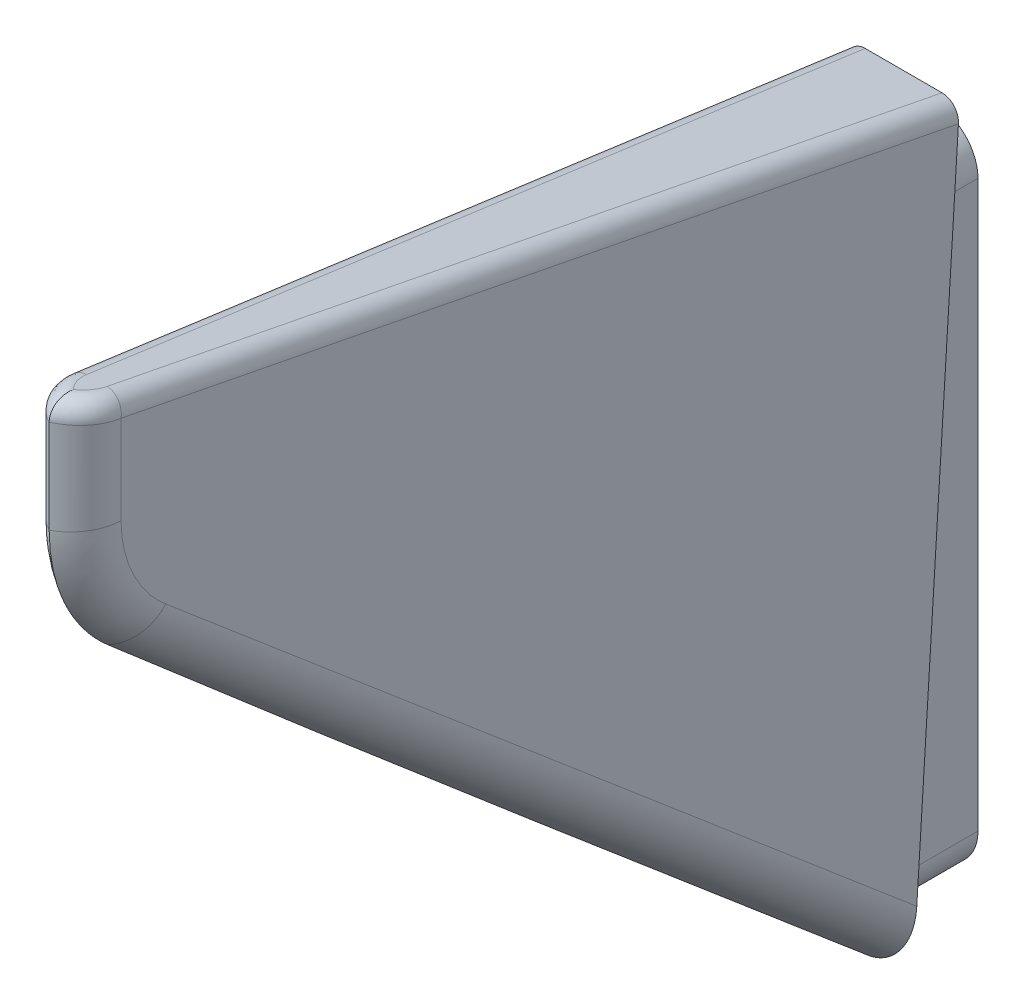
ISO-10303-21;
HEADER;
FILE_DESCRIPTION(('STEP AP214'),'2;1');
FILE_NAME('part.step','',(''),(''),'','','');
FILE_SCHEMA(('AUTOMOTIVE_DESIGN { 1 0 10303 214 1 1 1 1 }'));
ENDSEC;
DATA;
#1=APPLICATION_CONTEXT('core data for automotive mechanical design processes');
#2=APPLICATION_PROTOCOL_DEFINITION('international standard','automotive_design',2000,#1);
#3=PRODUCT_CONTEXT('',#1,'mechanical');
#4=PRODUCT('Part','Part','',(#3));
#5=PRODUCT_RELATED_PRODUCT_CATEGORY('part','',(#4));
#6=PRODUCT_DEFINITION_FORMATION('','',#4);
#7=PRODUCT_DEFINITION_CONTEXT('part definition',#1,'design');
#8=PRODUCT_DEFINITION('design','',#6,#7);
#9=PRODUCT_DEFINITION_SHAPE('','',#8);
#10=(LENGTH_UNIT() NAMED_UNIT(*) SI_UNIT(.MILLI.,.METRE.));
#11=(NAMED_UNIT(*) PLANE_ANGLE_UNIT() SI_UNIT($,.RADIAN.));
#12=(NAMED_UNIT(*) SI_UNIT($,.STERADIAN.) SOLID_ANGLE_UNIT());
#13=UNCERTAINTY_MEASURE_WITH_UNIT(LENGTH_MEASURE(1.E-05),#10,'distance_accuracy_value','');
#14=(GEOMETRIC_REPRESENTATION_CONTEXT(3) GLOBAL_UNCERTAINTY_ASSIGNED_CONTEXT((#13)) GLOBAL_UNIT_ASSIGNED_CONTEXT((#10,
#11,#12)) REPRESENTATION_CONTEXT('',''));
#15=CARTESIAN_POINT('',(0.,0.,0.));
#16=DIRECTION('',(0.,0.,1.));
#17=DIRECTION('',(1.,0.,0.));
#18=AXIS2_PLACEMENT_3D('',#15,#16,#17);
#19=CARTESIAN_POINT('',(3.12500031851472,-22.8125553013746,-2.74324902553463));
#20=DIRECTION('',(0.,0.061048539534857,0.998134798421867));
#21=DIRECTION('',(0.,-0.998134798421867,0.061048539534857));
#22=AXIS2_PLACEMENT_3D('',#19,#20,#21);
#23=PLANE('',#22);
#24=CARTESIAN_POINT('',(3.18514714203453E-07,14.6874446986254,-5.03684728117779));
#25=DIRECTION('',(0.,0.061048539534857,0.998134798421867));
#26=DIRECTION('',(0.,-0.998134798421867,0.061048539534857));
#27=AXIS2_PLACEMENT_3D('',#24,#25,#26);
#28=ELLIPSE('',#27,2.50467171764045,2.5);
#29=CARTESIAN_POINT('',(3.18514714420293E-07,17.1874446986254,-5.189753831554));
#30=VERTEX_POINT('',#29);
#31=CARTESIAN_POINT('',(2.50000031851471,14.6874446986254,-5.03684728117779));
#32=VERTEX_POINT('',#31);
#33=EDGE_CURVE('E186',#30,#32,#28,.F.);
#34=ORIENTED_EDGE('',*,*,#33,.F.);
#35=CARTESIAN_POINT('',(3.18514714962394E-07,14.6874446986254,-5.03684728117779));
#36=DIRECTION('',(0.,0.061048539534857,0.998134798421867));
#37=DIRECTION('',(0.,-0.998134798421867,0.061048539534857));
#38=AXIS2_PLACEMENT_3D('',#35,#36,#37);
#39=ELLIPSE('',#38,2.50467171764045,2.5);
#40=CARTESIAN_POINT('',(-2.49999968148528,14.6874446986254,-5.03684728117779));
#41=VERTEX_POINT('',#40);
#42=EDGE_CURVE('E191',#41,#30,#39,.F.);
#43=ORIENTED_EDGE('',*,*,#42,.F.);
#44=DIRECTION('',(0.,0.998134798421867,-0.061048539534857));
#45=VECTOR('',#44,1.);
#46=CARTESIAN_POINT('',(-2.49999968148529,17.3049569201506,-5.19694118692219));
#47=LINE('',#46,#45);
#48=CARTESIAN_POINT('',(-2.49999968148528,-17.8125553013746,-3.04906212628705));
#49=VERTEX_POINT('',#48);
#50=EDGE_CURVE('E164',#49,#41,#47,.T.);
#51=ORIENTED_EDGE('',*,*,#50,.F.);
#52=CARTESIAN_POINT('',(3.18514718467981E-07,-17.8125553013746,-3.04906212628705));
#53=DIRECTION('',(0.,0.061048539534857,0.998134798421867));
#54=DIRECTION('',(0.,-0.998134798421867,0.061048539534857));
#55=AXIS2_PLACEMENT_3D('',#52,#53,#54);
#56=ELLIPSE('',#55,2.50467171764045,2.5);
#57=CARTESIAN_POINT('',(3.18514718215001E-07,-20.3125553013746,-2.89615557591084));
#58=VERTEX_POINT('',#57);
#59=EDGE_CURVE('E159',#58,#49,#56,.F.);
#60=ORIENTED_EDGE('',*,*,#59,.F.);
#61=CARTESIAN_POINT('',(3.18514718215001E-07,-17.8125553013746,-3.04906212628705));
#62=DIRECTION('',(0.,0.061048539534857,0.998134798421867));
#63=DIRECTION('',(0.,-0.998134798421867,0.061048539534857));
#64=AXIS2_PLACEMENT_3D('',#61,#62,#63);
#65=ELLIPSE('',#64,2.50467171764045,2.5);
#66=CARTESIAN_POINT('',(2.50000031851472,-17.8125553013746,-3.04906212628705));
#67=VERTEX_POINT('',#66);
#68=EDGE_CURVE('E161',#67,#58,#65,.F.);
#69=ORIENTED_EDGE('',*,*,#68,.F.);
#70=DIRECTION('',(0.,-0.998134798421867,0.061048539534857));
#71=VECTOR('',#70,1.);
#72=CARTESIAN_POINT('',(2.50000031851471,17.3049569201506,-5.19694118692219));
#73=LINE('',#72,#71);
#74=EDGE_CURVE('E180',#32,#67,#73,.T.);
#75=ORIENTED_EDGE('',*,*,#74,.F.);
#76=EDGE_LOOP('',(#34,#43,#51,#60,#69,#75));
#77=FACE_BOUND('',#76,.T.);
#78=DIRECTION('',(-0.00213185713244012,0.998132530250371,-0.0610484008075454));
#79=VECTOR('',#78,1.);
#80=CARTESIAN_POINT('',(-3.17021704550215,-1.64184865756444,-4.03810491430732));
#81=LINE('',#80,#79);
#82=CARTESIAN_POINT('',(-3.13279097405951,-19.1646830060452,-2.96636245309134));
#83=VERTEX_POINT('',#82);
#84=CARTESIAN_POINT('',(-3.21361717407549,18.6780308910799,-5.28092198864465));
#85=VERTEX_POINT('',#84);
#86=EDGE_CURVE('E195',#83,#85,#81,.T.);
#87=ORIENTED_EDGE('',*,*,#86,.T.);
#88=CARTESIAN_POINT('',(-2.21301997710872,18.6838118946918,-5.28127556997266));
#89=DIRECTION('',(0.,0.061048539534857,0.998134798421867));
#90=DIRECTION('',(-0.312946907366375,-0.947999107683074,0.057982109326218));
#91=AXIS2_PLACEMENT_3D('',#88,#89,#90);
#92=ELLIPSE('',#91,1.00610449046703,1.);
#93=CARTESIAN_POINT('',(-2.20939999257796,19.6874446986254,-5.34266038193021));
#94=VERTEX_POINT('',#93);
#95=EDGE_CURVE('E48',#85,#94,#92,.F.);
#96=ORIENTED_EDGE('',*,*,#95,.T.);
#97=DIRECTION('',(-1.,0.,0.));
#98=VECTOR('',#97,1.);
#99=CARTESIAN_POINT('',(3.12500031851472,19.6874446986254,-5.34266038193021));
#100=LINE('',#99,#98);
#101=CARTESIAN_POINT('',(2.20940062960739,19.6874446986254,-5.34266038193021));
#102=VERTEX_POINT('',#101);
#103=EDGE_CURVE('E181',#102,#94,#100,.T.);
#104=ORIENTED_EDGE('',*,*,#103,.F.);
#105=CARTESIAN_POINT('',(2.21302061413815,18.6838118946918,-5.28127556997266));
#106=DIRECTION('',(0.,0.061048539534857,0.998134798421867));
#107=DIRECTION('',(0.312946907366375,-0.947999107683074,0.057982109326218));
#108=AXIS2_PLACEMENT_3D('',#105,#106,#107);
#109=ELLIPSE('',#108,1.00610449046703,1.);
#110=CARTESIAN_POINT('',(3.21361781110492,18.6780308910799,-5.28092198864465));
#111=VERTEX_POINT('',#110);
#112=EDGE_CURVE('E56',#102,#111,#109,.F.);
#113=ORIENTED_EDGE('',*,*,#112,.T.);
#114=DIRECTION('',(-0.00213185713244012,-0.998132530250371,0.0610484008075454));
#115=VECTOR('',#114,1.);
#116=CARTESIAN_POINT('',(3.17021768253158,-1.64184865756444,-4.03810491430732));
#117=LINE('',#116,#115);
#118=CARTESIAN_POINT('',(3.13279161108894,-19.1646830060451,-2.96636245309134));
#119=VERTEX_POINT('',#118);
#120=EDGE_CURVE('E197',#119,#111,#117,.F.);
#121=ORIENTED_EDGE('',*,*,#120,.F.);
#122=CARTESIAN_POINT('',(0.131142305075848,-19.0807224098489,-2.97149770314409));
#123=DIRECTION('',(0.,0.061048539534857,0.998134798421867));
#124=DIRECTION('',(-0.0446872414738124,0.997137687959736,-0.0609875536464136));
#125=AXIS2_PLACEMENT_3D('',#122,#123,#124);
#126=ELLIPSE('',#125,3.74013853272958,3.);
#127=CARTESIAN_POINT('',(0.190708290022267,-22.8125553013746,-2.74324902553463));
#128=VERTEX_POINT('',#127);
#129=EDGE_CURVE('E216',#119,#128,#126,.F.);
#130=ORIENTED_EDGE('',*,*,#129,.T.);
#131=DIRECTION('',(-1.,0.,0.));
#132=VECTOR('',#131,1.);
#133=CARTESIAN_POINT('',(3.12500031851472,-22.8125553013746,-2.74324902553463));
#134=LINE('',#133,#132);
#135=CARTESIAN_POINT('',(-0.190707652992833,-22.8125553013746,-2.74324902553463));
#136=VERTEX_POINT('',#135);
#137=EDGE_CURVE('E200',#128,#136,#134,.T.);
#138=ORIENTED_EDGE('',*,*,#137,.T.);
#139=CARTESIAN_POINT('',(-0.131141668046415,-19.0807224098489,-2.9714977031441));
#140=DIRECTION('',(0.,0.061048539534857,0.998134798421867));
#141=DIRECTION('',(0.0446872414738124,0.997137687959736,-0.0609875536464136));
#142=AXIS2_PLACEMENT_3D('',#139,#140,#141);
#143=ELLIPSE('',#142,3.74013853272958,3.);
#144=EDGE_CURVE('E218',#136,#83,#143,.F.);
#145=ORIENTED_EDGE('',*,*,#144,.T.);
#146=EDGE_LOOP('',(#87,#96,#104,#113,#121,#130,#138,#145));
#147=FACE_BOUND('',#146,.T.);
#148=ADVANCED_FACE('F39',(#77,#147),#23,.F.);
#149=CARTESIAN_POINT('',(3.12500031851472,19.6874446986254,-5.34266038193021));
#150=DIRECTION('',(0.,-0.986285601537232,0.165047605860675));
#151=DIRECTION('',(0.,-0.165047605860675,-0.986285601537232));
#152=AXIS2_PLACEMENT_3D('',#149,#150,#151);
#153=PLANE('',#152);
#154=ORIENTED_EDGE('',*,*,#103,.T.);
#155=DIRECTION('',(0.0344214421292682,0.164949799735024,0.985701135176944));
#156=VECTOR('',#155,1.);
#157=CARTESIAN_POINT('',(-0.584014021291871,27.4764004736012,41.2023039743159));
#158=LINE('',#157,#156);
#159=CARTESIAN_POINT('',(-0.589803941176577,27.4486547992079,41.0365023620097));
#160=VERTEX_POINT('',#159);
#161=EDGE_CURVE('E279',#94,#160,#158,.T.);
#162=ORIENTED_EDGE('',*,*,#161,.T.);
#163=CARTESIAN_POINT('',(1.40897771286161,27.4369744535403,40.9667033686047));
#164=DIRECTION('',(0.,-0.986285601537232,0.165047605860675));
#165=DIRECTION('',(0.,0.165047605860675,0.986285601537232));
#166=AXIS2_PLACEMENT_3D('',#163,#164,#165);
#167=ELLIPSE('',#166,2.0278101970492,2.);
#168=CARTESIAN_POINT('',(3.18514714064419E-07,27.6745056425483,42.3861337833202));
#169=VERTEX_POINT('',#168);
#170=EDGE_CURVE('E276',#160,#169,#167,.F.);
#171=ORIENTED_EDGE('',*,*,#170,.T.);
#172=CARTESIAN_POINT('',(-1.40897707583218,27.4369744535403,40.9667033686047));
#173=DIRECTION('',(0.,-0.986285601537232,0.165047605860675));
#174=DIRECTION('',(0.,0.165047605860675,0.986285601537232));
#175=AXIS2_PLACEMENT_3D('',#172,#173,#174);
#176=ELLIPSE('',#175,2.0278101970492,2.);
#177=CARTESIAN_POINT('',(0.58980457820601,27.4486547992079,41.0365023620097));
#178=VERTEX_POINT('',#177);
#179=EDGE_CURVE('E274',#169,#178,#176,.F.);
#180=ORIENTED_EDGE('',*,*,#179,.T.);
#181=DIRECTION('',(0.0344214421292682,-0.164949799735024,-0.985701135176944));
#182=VECTOR('',#181,1.);
#183=CARTESIAN_POINT('',(2.21048546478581,19.6822460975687,-5.37372599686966));
#184=LINE('',#183,#182);
#185=EDGE_CURVE('E220',#178,#102,#184,.T.);
#186=ORIENTED_EDGE('',*,*,#185,.T.);
#187=EDGE_LOOP('',(#154,#162,#171,#180,#186));
#188=FACE_BOUND('',#187,.T.);
#189=ADVANCED_FACE('F306',(#188),#153,.F.);
#190=CARTESIAN_POINT('',(3.12500031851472,-22.8125553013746,-2.74324902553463));
#191=DIRECTION('',(0.,-0.764465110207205,0.64466510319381));
#192=DIRECTION('',(0.,-0.64466510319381,-0.764465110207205));
#193=AXIS2_PLACEMENT_3D('',#190,#191,#192);
#194=PLANE('',#193);
#195=DIRECTION('',(0.0266862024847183,-0.644435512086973,-0.764192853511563));
#196=VECTOR('',#195,1.);
#197=CARTESIAN_POINT('',(-1.32002743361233,13.6696586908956,40.5185618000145));
#198=LINE('',#197,#196);
#199=CARTESIAN_POINT('',(3.18514716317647E-07,-18.2072170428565,2.71791274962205));
#200=VERTEX_POINT('',#199);
#201=EDGE_CURVE('E212',#128,#200,#198,.F.);
#202=ORIENTED_EDGE('',*,*,#201,.T.);
#203=DIRECTION('',(0.0266862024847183,0.644435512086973,0.764192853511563));
#204=VECTOR('',#203,1.);
#205=CARTESIAN_POINT('',(-0.188346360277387,-22.7555332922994,-2.67563044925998));
#206=LINE('',#205,#204);
#207=EDGE_CURVE('E214',#200,#136,#206,.F.);
#208=ORIENTED_EDGE('',*,*,#207,.T.);
#209=ORIENTED_EDGE('',*,*,#137,.F.);
#210=EDGE_LOOP('',(#202,#208,#209));
#211=FACE_BOUND('',#210,.T.);
#212=ADVANCED_FACE('F386',(#211),#194,.T.);
#213=CARTESIAN_POINT('',(3.12500031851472,-1.56255530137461,-2.74324902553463));
#214=DIRECTION('',(0.999390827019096,0.,0.034899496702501));
#215=DIRECTION('',(0.034899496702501,0.,-0.999390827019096));
#216=AXIS2_PLACEMENT_3D('',#213,#214,#215);
#217=PLANE('',#216);
#218=ORIENTED_EDGE('',*,*,#120,.T.);
#219=DIRECTION('',(-0.0344214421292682,0.164949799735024,0.985701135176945));
#220=VECTOR('',#219,1.);
#221=CARTESIAN_POINT('',(3.24233366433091,18.540422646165,-6.10323643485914));
#222=LINE('',#221,#220);
#223=CARTESIAN_POINT('',(1.58919540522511,26.4623691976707,41.2364494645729));
#224=VERTEX_POINT('',#223);
#225=EDGE_CURVE('E11',#111,#224,#222,.T.);
#226=ORIENTED_EDGE('',*,*,#225,.T.);
#227=DIRECTION('',(0.,-1.,0.));
#228=VECTOR('',#227,1.);
#229=CARTESIAN_POINT('',(1.5891954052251,-1.56255530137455,41.2364494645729));
#230=LINE('',#229,#228);
#231=CARTESIAN_POINT('',(1.58919540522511,21.3647723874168,41.2364494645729));
#232=VERTEX_POINT('',#231);
#233=EDGE_CURVE('E210',#224,#232,#230,.T.);
#234=ORIENTED_EDGE('',*,*,#233,.T.);
#235=CARTESIAN_POINT('',(1.83364079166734,21.3647723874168,34.2364494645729));
#236=DIRECTION('',(0.999390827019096,0.,0.034899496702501));
#237=DIRECTION('',(-0.034899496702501,0.,0.999390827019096));
#238=AXIS2_PLACEMENT_3D('',#235,#236,#237);
#239=ELLIPSE('',#238,7.00426681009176,7.00000000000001);
#240=CARTESIAN_POINT('',(1.67605538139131,16.0135166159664,38.7491051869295));
#241=VERTEX_POINT('',#240);
#242=EDGE_CURVE('E208',#232,#241,#239,.T.);
#243=ORIENTED_EDGE('',*,*,#242,.T.);
#244=DIRECTION('',(-0.0266862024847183,0.644435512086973,0.764192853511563));
#245=VECTOR('',#244,1.);
#246=CARTESIAN_POINT('',(3.1909704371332,-20.5696225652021,-4.63238605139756));
#247=LINE('',#246,#245);
#248=EDGE_CURVE('E206',#241,#119,#247,.F.);
#249=ORIENTED_EDGE('',*,*,#248,.T.);
#250=EDGE_LOOP('',(#218,#226,#234,#243,#249));
#251=FACE_BOUND('',#250,.T.);
#252=ADVANCED_FACE('F261',(#251),#217,.T.);
#253=CARTESIAN_POINT('',(-3.12499968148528,-1.56255530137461,-2.74324902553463));
#254=DIRECTION('',(-0.999390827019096,0.,0.034899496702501));
#255=DIRECTION('',(0.034899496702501,0.,0.999390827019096));
#256=AXIS2_PLACEMENT_3D('',#253,#254,#255);
#257=PLANE('',#256);
#258=DIRECTION('',(0.,-1.,0.));
#259=VECTOR('',#258,1.);
#260=CARTESIAN_POINT('',(-1.58919476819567,27.9666217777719,41.2364494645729));
#261=LINE('',#260,#259);
#262=CARTESIAN_POINT('',(-1.58919476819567,21.3647723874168,41.2364494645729));
#263=VERTEX_POINT('',#262);
#264=CARTESIAN_POINT('',(-1.58919476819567,26.4623691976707,41.2364494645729));
#265=VERTEX_POINT('',#264);
#266=EDGE_CURVE('E204',#263,#265,#261,.F.);
#267=ORIENTED_EDGE('',*,*,#266,.T.);
#268=DIRECTION('',(0.0344214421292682,0.164949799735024,0.985701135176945));
#269=VECTOR('',#268,1.);
#270=CARTESIAN_POINT('',(-3.2099832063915,18.6954451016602,-5.17685876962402));
#271=LINE('',#270,#269);
#272=EDGE_CURVE('E64',#265,#85,#271,.F.);
#273=ORIENTED_EDGE('',*,*,#272,.T.);
#274=ORIENTED_EDGE('',*,*,#86,.F.);
#275=DIRECTION('',(0.0266862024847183,0.644435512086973,0.764192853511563));
#276=VECTOR('',#275,1.);
#277=CARTESIAN_POINT('',(-2.82552214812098,-11.7445585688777,5.83266547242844));
#278=LINE('',#277,#276);
#279=CARTESIAN_POINT('',(-1.67605474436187,16.0135166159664,38.7491051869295));
#280=VERTEX_POINT('',#279);
#281=EDGE_CURVE('E169',#83,#280,#278,.T.);
#282=ORIENTED_EDGE('',*,*,#281,.T.);
#283=CARTESIAN_POINT('',(-1.83364015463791,21.3647723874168,34.2364494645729));
#284=DIRECTION('',(-0.999390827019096,0.,0.034899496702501));
#285=DIRECTION('',(-0.034899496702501,0.,-0.999390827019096));
#286=AXIS2_PLACEMENT_3D('',#283,#284,#285);
#287=ELLIPSE('',#286,7.00426681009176,7.00000000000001);
#288=EDGE_CURVE('E202',#280,#263,#287,.T.);
#289=ORIENTED_EDGE('',*,*,#288,.T.);
#290=EDGE_LOOP('',(#267,#273,#274,#282,#289));
#291=FACE_BOUND('',#290,.T.);
#292=ADVANCED_FACE('F394',(#291),#257,.T.);
#293=CARTESIAN_POINT('',(-2.49999968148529,17.1874446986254,-7.11824902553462));
#294=DIRECTION('',(-1.,0.,0.));
#295=DIRECTION('',(0.,-1.,0.));
#296=AXIS2_PLACEMENT_3D('',#293,#294,#295);
#297=PLANE('',#296);
#298=DIRECTION('',(0.,0.,1.));
#299=VECTOR('',#298,1.);
#300=CARTESIAN_POINT('',(-2.49999968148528,-17.8125553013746,-7.11824902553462));
#301=LINE('',#300,#299);
#302=CARTESIAN_POINT('',(-2.49999968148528,-17.8125553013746,-7.11824902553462));
#303=VERTEX_POINT('',#302);
#304=EDGE_CURVE('E343',#303,#49,#301,.T.);
#305=ORIENTED_EDGE('',*,*,#304,.T.);
#306=ORIENTED_EDGE('',*,*,#50,.T.);
#307=DIRECTION('',(0.,0.,1.));
#308=VECTOR('',#307,1.);
#309=CARTESIAN_POINT('',(-2.49999968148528,14.6874446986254,-7.11824902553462));
#310=LINE('',#309,#308);
#311=CARTESIAN_POINT('',(-2.49999968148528,14.6874446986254,-7.11824902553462));
#312=VERTEX_POINT('',#311);
#313=EDGE_CURVE('E345',#41,#312,#310,.F.);
#314=ORIENTED_EDGE('',*,*,#313,.T.);
#315=DIRECTION('',(0.,-1.,0.));
#316=VECTOR('',#315,1.);
#317=CARTESIAN_POINT('',(-2.49999968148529,17.1874446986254,-7.11824902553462));
#318=LINE('',#317,#316);
#319=EDGE_CURVE('E188',#312,#303,#318,.T.);
#320=ORIENTED_EDGE('',*,*,#319,.T.);
#321=EDGE_LOOP('',(#305,#306,#314,#320));
#322=FACE_BOUND('',#321,.T.);
#323=ADVANCED_FACE('F370',(#322),#297,.T.);
#324=CARTESIAN_POINT('',(2.50000031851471,17.1874446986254,-7.11824902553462));
#325=DIRECTION('',(1.,0.,0.));
#326=DIRECTION('',(0.,1.,0.));
#327=AXIS2_PLACEMENT_3D('',#324,#325,#326);
#328=PLANE('',#327);
#329=DIRECTION('',(0.,0.,1.));
#330=VECTOR('',#329,1.);
#331=CARTESIAN_POINT('',(2.50000031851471,14.6874446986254,-7.11824902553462));
#332=LINE('',#331,#330);
#333=CARTESIAN_POINT('',(2.50000031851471,14.6874446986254,-7.11824902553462));
#334=VERTEX_POINT('',#333);
#335=EDGE_CURVE('E170',#334,#32,#332,.T.);
#336=ORIENTED_EDGE('',*,*,#335,.T.);
#337=ORIENTED_EDGE('',*,*,#74,.T.);
#338=DIRECTION('',(0.,0.,1.));
#339=VECTOR('',#338,1.);
#340=CARTESIAN_POINT('',(2.50000031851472,-17.8125553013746,-7.11824902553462));
#341=LINE('',#340,#339);
#342=CARTESIAN_POINT('',(2.50000031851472,-17.8125553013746,-7.11824902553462));
#343=VERTEX_POINT('',#342);
#344=EDGE_CURVE('E179',#67,#343,#341,.F.);
#345=ORIENTED_EDGE('',*,*,#344,.T.);
#346=DIRECTION('',(0.,1.,0.));
#347=VECTOR('',#346,1.);
#348=CARTESIAN_POINT('',(2.50000031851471,17.1874446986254,-7.11824902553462));
#349=LINE('',#348,#347);
#350=EDGE_CURVE('E340',#343,#334,#349,.T.);
#351=ORIENTED_EDGE('',*,*,#350,.T.);
#352=EDGE_LOOP('',(#336,#337,#345,#351));
#353=FACE_BOUND('',#352,.T.);
#354=ADVANCED_FACE('F358',(#353),#328,.T.);
#355=CARTESIAN_POINT('',(3.18514714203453E-07,14.6874446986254,-7.11824902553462));
#356=DIRECTION('',(0.,0.,1.));
#357=DIRECTION('',(1.,0.,0.));
#358=AXIS2_PLACEMENT_3D('',#355,#356,#357);
#359=CYLINDRICAL_SURFACE('',#358,2.5);
#360=DIRECTION('',(0.,0.,1.));
#361=VECTOR('',#360,1.);
#362=CARTESIAN_POINT('',(3.18514714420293E-07,17.1874446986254,-7.11824902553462));
#363=LINE('',#362,#361);
#364=CARTESIAN_POINT('',(3.18514714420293E-07,17.1874446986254,-7.11824902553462));
#365=VERTEX_POINT('',#364);
#366=EDGE_CURVE('E185',#30,#365,#363,.F.);
#367=ORIENTED_EDGE('',*,*,#366,.F.);
#368=ORIENTED_EDGE('',*,*,#33,.T.);
#369=ORIENTED_EDGE('',*,*,#335,.F.);
#370=CARTESIAN_POINT('',(3.18514714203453E-07,14.6874446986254,-7.11824902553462));
#371=DIRECTION('',(0.,0.,1.));
#372=DIRECTION('',(1.,0.,0.));
#373=AXIS2_PLACEMENT_3D('',#370,#371,#372);
#374=CIRCLE('',#373,2.5);
#375=EDGE_CURVE('E350',#365,#334,#374,.F.);
#376=ORIENTED_EDGE('',*,*,#375,.F.);
#377=EDGE_LOOP('',(#367,#368,#369,#376));
#378=FACE_BOUND('',#377,.T.);
#379=ADVANCED_FACE('F363',(#378),#359,.T.);
#380=CARTESIAN_POINT('',(3.18514714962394E-07,14.6874446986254,-7.11824902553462));
#381=DIRECTION('',(0.,0.,1.));
#382=DIRECTION('',(1.,0.,0.));
#383=AXIS2_PLACEMENT_3D('',#380,#381,#382);
#384=CYLINDRICAL_SURFACE('',#383,2.5);
#385=ORIENTED_EDGE('',*,*,#313,.F.);
#386=ORIENTED_EDGE('',*,*,#42,.T.);
#387=ORIENTED_EDGE('',*,*,#366,.T.);
#388=CARTESIAN_POINT('',(3.18514714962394E-07,14.6874446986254,-7.11824902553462));
#389=DIRECTION('',(0.,0.,1.));
#390=DIRECTION('',(1.,0.,0.));
#391=AXIS2_PLACEMENT_3D('',#388,#389,#390);
#392=CIRCLE('',#391,2.5);
#393=EDGE_CURVE('E352',#312,#365,#392,.F.);
#394=ORIENTED_EDGE('',*,*,#393,.F.);
#395=EDGE_LOOP('',(#385,#386,#387,#394));
#396=FACE_BOUND('',#395,.T.);
#397=ADVANCED_FACE('F366',(#396),#384,.T.);
#398=CARTESIAN_POINT('',(3.18514718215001E-07,-17.8125553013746,-7.11824902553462));
#399=DIRECTION('',(0.,0.,1.));
#400=DIRECTION('',(1.,0.,0.));
#401=AXIS2_PLACEMENT_3D('',#398,#399,#400);
#402=CYLINDRICAL_SURFACE('',#401,2.5);
#403=ORIENTED_EDGE('',*,*,#344,.F.);
#404=ORIENTED_EDGE('',*,*,#68,.T.);
#405=DIRECTION('',(0.,0.,1.));
#406=VECTOR('',#405,1.);
#407=CARTESIAN_POINT('',(3.18514718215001E-07,-20.3125553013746,-7.11824902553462));
#408=LINE('',#407,#406);
#409=CARTESIAN_POINT('',(3.18514718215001E-07,-20.3125553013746,-7.11824902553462));
#410=VERTEX_POINT('',#409);
#411=EDGE_CURVE('E177',#410,#58,#408,.T.);
#412=ORIENTED_EDGE('',*,*,#411,.F.);
#413=CARTESIAN_POINT('',(3.18514718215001E-07,-17.8125553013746,-7.11824902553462));
#414=DIRECTION('',(0.,0.,1.));
#415=DIRECTION('',(1.,0.,0.));
#416=AXIS2_PLACEMENT_3D('',#413,#414,#415);
#417=CIRCLE('',#416,2.5);
#418=EDGE_CURVE('E347',#343,#410,#417,.F.);
#419=ORIENTED_EDGE('',*,*,#418,.F.);
#420=EDGE_LOOP('',(#403,#404,#412,#419));
#421=FACE_BOUND('',#420,.T.);
#422=ADVANCED_FACE('F175',(#421),#402,.T.);
#423=CARTESIAN_POINT('',(3.18514718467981E-07,-17.8125553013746,-7.11824902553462));
#424=DIRECTION('',(0.,0.,1.));
#425=DIRECTION('',(1.,0.,0.));
#426=AXIS2_PLACEMENT_3D('',#423,#424,#425);
#427=CYLINDRICAL_SURFACE('',#426,2.5);
#428=ORIENTED_EDGE('',*,*,#411,.T.);
#429=ORIENTED_EDGE('',*,*,#59,.T.);
#430=ORIENTED_EDGE('',*,*,#304,.F.);
#431=CARTESIAN_POINT('',(3.18514718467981E-07,-17.8125553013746,-7.11824902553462));
#432=DIRECTION('',(0.,0.,1.));
#433=DIRECTION('',(1.,0.,0.));
#434=AXIS2_PLACEMENT_3D('',#431,#432,#433);
#435=CIRCLE('',#434,2.5);
#436=EDGE_CURVE('E184',#410,#303,#435,.F.);
#437=ORIENTED_EDGE('',*,*,#436,.F.);
#438=EDGE_LOOP('',(#428,#429,#430,#437));
#439=FACE_BOUND('',#438,.T.);
#440=ADVANCED_FACE('F183',(#439),#427,.T.);
#441=CARTESIAN_POINT('',(3.18514716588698E-07,-1.56255530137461,-7.11824902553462));
#442=DIRECTION('',(0.,0.,1.));
#443=DIRECTION('',(1.,0.,0.));
#444=AXIS2_PLACEMENT_3D('',#441,#442,#443);
#445=PLANE('',#444);
#446=ORIENTED_EDGE('',*,*,#319,.F.);
#447=ORIENTED_EDGE('',*,*,#393,.T.);
#448=ORIENTED_EDGE('',*,*,#375,.T.);
#449=ORIENTED_EDGE('',*,*,#350,.F.);
#450=ORIENTED_EDGE('',*,*,#418,.T.);
#451=ORIENTED_EDGE('',*,*,#436,.T.);
#452=EDGE_LOOP('',(#446,#447,#448,#449,#450,#451));
#453=FACE_BOUND('',#452,.T.);
#454=ADVANCED_FACE('F372',(#453),#445,.F.);
#455=CARTESIAN_POINT('',(0.192797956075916,-20.5696225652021,-4.73708454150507));
#456=DIRECTION('',(-0.0266862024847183,0.644435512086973,0.764192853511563));
#457=DIRECTION('',(0.,-0.764465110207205,0.64466510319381));
#458=AXIS2_PLACEMENT_3D('',#455,#456,#457);
#459=CYLINDRICAL_SURFACE('',#458,3.);
#460=ORIENTED_EDGE('',*,*,#129,.F.);
#461=ORIENTED_EDGE('',*,*,#248,.F.);
#462=CARTESIAN_POINT('',(-1.32211709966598,16.0135166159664,38.644406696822));
#463=DIRECTION('',(-0.0266862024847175,0.644435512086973,0.764192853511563));
#464=DIRECTION('',(0.,-0.764465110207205,0.644665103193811));
#465=AXIS2_PLACEMENT_3D('',#462,#463,#464);
#466=CIRCLE('',#465,3.);
#467=CARTESIAN_POINT('',(3.18514716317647E-07,13.9777768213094,40.4072932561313));
#468=VERTEX_POINT('',#467);
#469=EDGE_CURVE('E198',#468,#241,#466,.T.);
#470=ORIENTED_EDGE('',*,*,#469,.F.);
#471=CARTESIAN_POINT('',(3.18514716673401E-07,-15.9138217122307,0.78391744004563));
#472=DIRECTION('',(1.,0.,0.));
#473=DIRECTION('',(0.,0.64466510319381,0.764465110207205));
#474=AXIS2_PLACEMENT_3D('',#471,#472,#473);
#475=ELLIPSE('',#474,112.417643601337,3.);
#476=EDGE_CURVE('E268',#200,#468,#475,.F.);
#477=ORIENTED_EDGE('',*,*,#476,.F.);
#478=ORIENTED_EDGE('',*,*,#201,.F.);
#479=EDGE_LOOP('',(#460,#461,#470,#477,#478));
#480=FACE_BOUND('',#479,.T.);
#481=ADVANCED_FACE('F251',(#480),#459,.T.);
#482=CARTESIAN_POINT('',(-1.40897707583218,21.3647723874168,44.1317509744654));
#483=CARTESIAN_POINT('',(1.48808924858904,21.3647723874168,44.1317509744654));
#484=CARTESIAN_POINT('',(1.58919540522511,21.3647723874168,41.2364494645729));
#485=CARTESIAN_POINT('',(-1.40897707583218,20.9284392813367,44.1317509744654));
#486=CARTESIAN_POINT('',(1.48808924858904,20.932853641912,44.1317509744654));
#487=CARTESIAN_POINT('',(1.58919540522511,21.0593392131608,41.2364494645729));
#488=CARTESIAN_POINT('',(-1.40827798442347,20.4921061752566,44.1031518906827));
#489=CARTESIAN_POINT('',(1.48906785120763,20.5008932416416,44.103727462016));
#490=CARTESIAN_POINT('',(1.58989449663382,20.7539060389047,41.216430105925));
#491=CARTESIAN_POINT('',(-1.40549361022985,19.6269058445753,43.9892461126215));
#492=CARTESIAN_POINT('',(1.49296568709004,19.6442282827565,43.9921080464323));
#493=CARTESIAN_POINT('',(1.59267887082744,20.1482658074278,41.1366960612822));
#494=CARTESIAN_POINT('',(-1.4034082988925,19.1980387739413,43.9039382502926));
#495=CARTESIAN_POINT('',(1.49588570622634,19.2194432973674,43.908489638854));
#496=CARTESIAN_POINT('',(1.59476418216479,19.848058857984,41.076980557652));
#497=CARTESIAN_POINT('',(-1.39788719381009,18.3551083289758,43.6780757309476));
#498=CARTESIAN_POINT('',(1.50361848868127,18.3841868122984,43.6870517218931));
#499=CARTESIAN_POINT('',(1.6002852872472,19.2580075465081,40.9188767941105));
#500=CARTESIAN_POINT('',(-1.39445134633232,17.9410455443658,43.5375188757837));
#501=CARTESIAN_POINT('',(1.50843277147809,17.9736433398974,43.5491887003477));
#502=CARTESIAN_POINT('',(1.60372113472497,18.9681635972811,40.8204869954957));
#503=CARTESIAN_POINT('',(-1.38628798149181,17.1348079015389,43.2035643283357));
#504=CARTESIAN_POINT('',(1.51987557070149,17.1737050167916,43.221509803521));
#505=CARTESIAN_POINT('',(1.61188449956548,18.4037972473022,40.5867188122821));
#506=CARTESIAN_POINT('',(-1.38156039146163,16.7426342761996,43.010163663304));
#507=CARTESIAN_POINT('',(1.52650623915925,16.7842516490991,43.0316323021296));
#508=CARTESIAN_POINT('',(1.61661208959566,18.1292757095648,40.4513383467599));
#509=CARTESIAN_POINT('',(-1.37089444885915,15.9868844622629,42.5738313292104));
#510=CARTESIAN_POINT('',(1.54147377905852,16.0330011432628,42.6030180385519));
#511=CARTESIAN_POINT('',(1.62727803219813,17.600250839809,40.1459057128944));
#512=CARTESIAN_POINT('',(-1.36495601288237,15.6233102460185,42.3308962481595));
#513=CARTESIAN_POINT('',(1.54981329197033,15.6711630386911,42.364205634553));
#514=CARTESIAN_POINT('',(1.63321646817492,17.345748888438,39.9758511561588));
#515=CARTESIAN_POINT('',(-1.35196999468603,14.9309793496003,41.7996520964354));
#516=CARTESIAN_POINT('',(1.56806248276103,14.981221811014,41.8416171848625));
#517=CARTESIAN_POINT('',(1.64620248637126,16.8611172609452,39.6039802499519));
#518=CARTESIAN_POINT('',(-1.34492232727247,14.6022253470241,41.5113395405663));
#519=CARTESIAN_POINT('',(1.57797511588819,14.6530981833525,41.5577565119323));
#520=CARTESIAN_POINT('',(1.65325015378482,16.6309894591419,39.4021614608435));
#521=CARTESIAN_POINT('',(-1.32983843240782,13.9851592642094,40.8942734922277));
#522=CARTESIAN_POINT('',(1.59920841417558,14.0361392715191,40.949714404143));
#523=CARTESIAN_POINT('',(1.66833404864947,16.1990432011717,38.9702152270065));
#524=CARTESIAN_POINT('',(-1.32180212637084,13.696850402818,40.5655167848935));
#525=CARTESIAN_POINT('',(1.61053215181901,13.7473054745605,40.6254449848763));
#526=CARTESIAN_POINT('',(1.67637035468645,15.9972269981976,38.7400855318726));
#527=CARTESIAN_POINT('',(-1.3048784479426,13.1656071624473,39.8731871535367));
#528=CARTESIAN_POINT('',(1.63440173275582,13.2138635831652,39.9419096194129));
#529=CARTESIAN_POINT('',(1.69329403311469,15.6253567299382,38.2554547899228));
#530=CARTESIAN_POINT('',(-1.29599101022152,12.9226762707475,39.5096115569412));
#531=CARTESIAN_POINT('',(1.6469505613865,12.9692790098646,39.5825581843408));
#532=CARTESIAN_POINT('',(1.70218147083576,15.4553051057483,38.0009518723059));
#533=CARTESIAN_POINT('',(-1.27751711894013,12.4863454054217,38.7538643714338));
#534=CARTESIAN_POINT('',(1.67306328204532,12.5285733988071,38.8347877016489));
#535=CARTESIAN_POINT('',(1.72065536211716,15.1498735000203,37.4719288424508));
#536=CARTESIAN_POINT('',(-1.26793061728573,12.2929488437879,38.3616908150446));
#537=CARTESIAN_POINT('',(1.68662987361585,12.3324964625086,38.4462913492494));
#538=CARTESIAN_POINT('',(1.73024186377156,15.0144959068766,37.1974073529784));
#539=CARTESIAN_POINT('',(-1.24822260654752,11.9589958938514,37.5554571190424));
#540=CARTESIAN_POINT('',(1.71455299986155,11.992269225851,37.6466776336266));
#541=CARTESIAN_POINT('',(1.74994987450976,14.7807288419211,36.6330437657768));
#542=CARTESIAN_POINT('',(-1.23810106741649,11.818442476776,37.1413957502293));
#543=CARTESIAN_POINT('',(1.72891176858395,11.8481807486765,37.2354962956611));
#544=CARTESIAN_POINT('',(1.76007141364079,14.6823414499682,36.3432008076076));
#545=CARTESIAN_POINT('',(-1.21749614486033,11.5925812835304,36.298470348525));
#546=CARTESIAN_POINT('',(1.7581794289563,11.6145532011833,36.3973801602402));
#547=CARTESIAN_POINT('',(1.78067633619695,14.5242386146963,35.7531530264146));
#548=CARTESIAN_POINT('',(-1.20701274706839,11.5072757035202,35.8696057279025));
#549=CARTESIAN_POINT('',(1.77308994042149,11.5250895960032,35.9703989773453));
#550=CARTESIAN_POINT('',(1.7911597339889,14.4645247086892,35.4529477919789));
#551=CARTESIAN_POINT('',(-1.18586346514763,11.3933706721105,35.0044111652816));
#552=CARTESIAN_POINT('',(1.80321025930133,11.4024396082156,35.10786589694));
#553=CARTESIAN_POINT('',(1.81230901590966,14.3847911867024,34.8473115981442));
#554=CARTESIAN_POINT('',(-1.17519757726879,11.3647723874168,34.5680810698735));
#555=CARTESIAN_POINT('',(1.81842096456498,11.3693372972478,34.6722882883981));
#556=CARTESIAN_POINT('',(1.8229749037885,14.3647723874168,34.5418805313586));
#557=CARTESIAN_POINT('',(-1.15386580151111,11.3647723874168,33.6954208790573));
#558=CARTESIAN_POINT('',(1.8488838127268,11.360200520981,33.7999464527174));
#559=CARTESIAN_POINT('',(1.84430667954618,14.3647723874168,33.9310183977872));
#560=CARTESIAN_POINT('',(-1.14319991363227,11.3933706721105,33.2590907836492));
#561=CARTESIAN_POINT('',(1.86413607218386,11.3842530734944,33.3631788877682));
#562=CARTESIAN_POINT('',(1.85497256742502,14.3847911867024,33.6255873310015));
#563=CARTESIAN_POINT('',(-1.12205063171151,11.5072757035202,32.3938962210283));
#564=CARTESIAN_POINT('',(1.89442135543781,11.4892510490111,32.4959218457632));
#565=CARTESIAN_POINT('',(1.87612184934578,14.4645247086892,33.0199511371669));
#566=CARTESIAN_POINT('',(-1.11156723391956,11.5925812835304,31.9650316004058));
#567=CARTESIAN_POINT('',(1.90945370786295,11.5702805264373,32.0654515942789));
#568=CARTESIAN_POINT('',(1.88660524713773,14.5242386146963,32.7197459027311));
#569=CARTESIAN_POINT('',(-1.0909623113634,11.818442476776,31.1221061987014));
#570=CARTESIAN_POINT('',(1.93904009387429,11.788078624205,31.218208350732));
#571=CARTESIAN_POINT('',(1.90721016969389,14.6823414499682,32.1296981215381));
#572=CARTESIAN_POINT('',(-1.08084077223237,11.9589958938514,30.7080448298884));
#573=CARTESIAN_POINT('',(1.95359271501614,11.9249225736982,30.8014758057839));
#574=CARTESIAN_POINT('',(1.91733170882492,14.7807288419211,31.839855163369));
#575=CARTESIAN_POINT('',(-1.06113276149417,12.2929488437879,29.9018111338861));
#576=CARTESIAN_POINT('',(1.98196667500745,12.2522205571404,29.9889519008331));
#577=CARTESIAN_POINT('',(1.93703971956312,15.0144959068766,31.2754915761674));
#578=CARTESIAN_POINT('',(-1.05154625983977,12.4863454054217,29.5096375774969));
#579=CARTESIAN_POINT('',(1.99578595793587,12.4427359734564,29.5932194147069));
#580=CARTESIAN_POINT('',(1.94662622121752,15.1498735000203,31.000970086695));
#581=CARTESIAN_POINT('',(-1.03307236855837,12.9226762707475,28.7538903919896));
#582=CARTESIAN_POINT('',(2.02245097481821,12.8742936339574,28.829633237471));
#583=CARTESIAN_POINT('',(1.96510011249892,15.4553051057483,30.4719470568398));
#584=CARTESIAN_POINT('',(-1.0241849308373,13.1656071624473,28.390314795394));
#585=CARTESIAN_POINT('',(2.03529415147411,13.1153789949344,28.4618527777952));
#586=CARTESIAN_POINT('',(1.97398755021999,15.6253567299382,30.2174441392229));
#587=CARTESIAN_POINT('',(-1.00726125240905,13.696850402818,27.6979851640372));
#588=CARTESIAN_POINT('',(2.05977992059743,13.6440787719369,27.7606720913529));
#589=CARTESIAN_POINT('',(1.99091122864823,15.9972269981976,29.7328133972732));
#590=CARTESIAN_POINT('',(-0.999224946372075,13.9851592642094,27.3692284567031));
#591=CARTESIAN_POINT('',(2.07141963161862,13.9317149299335,27.4273543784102));
#592=CARTESIAN_POINT('',(1.99894753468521,16.1990432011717,29.5026837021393));
#593=CARTESIAN_POINT('',(-0.984141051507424,14.6022253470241,26.7521624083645));
#594=CARTESIAN_POINT('',(2.09329105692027,14.5486626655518,26.8010387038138));
#595=CARTESIAN_POINT('',(2.01403142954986,16.6309894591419,29.0707374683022));
#596=CARTESIAN_POINT('',(-0.977093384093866,14.9309793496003,26.4638498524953));
#597=CARTESIAN_POINT('',(2.10351976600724,14.8779729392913,26.5081267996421));
#598=CARTESIAN_POINT('',(2.02107909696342,16.8611172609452,28.8689186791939));
#599=CARTESIAN_POINT('',(-0.964107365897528,15.6233102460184,25.9326057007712));
#600=CARTESIAN_POINT('',(2.12238553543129,15.5726369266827,25.967881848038));
#601=CARTESIAN_POINT('',(2.03406511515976,17.345748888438,28.497047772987));
#602=CARTESIAN_POINT('',(-0.958168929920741,15.9868844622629,25.6896706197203));
#603=CARTESIAN_POINT('',(2.13101967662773,15.9379661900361,25.7206323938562));
#604=CARTESIAN_POINT('',(2.04000355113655,17.600250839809,28.3269932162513));
#605=CARTESIAN_POINT('',(-0.947502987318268,16.7426342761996,25.2533382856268));
#606=CARTESIAN_POINT('',(2.14654018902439,16.6983534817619,25.2761830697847));
#607=CARTESIAN_POINT('',(2.05066949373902,18.1292757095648,28.0215605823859));
#608=CARTESIAN_POINT('',(-0.942775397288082,17.1348079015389,25.0599376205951));
#609=CARTESIAN_POINT('',(2.15342393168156,17.0933654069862,25.0790584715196));
#610=CARTESIAN_POINT('',(2.0553970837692,18.4037972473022,27.8861801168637));
#611=CARTESIAN_POINT('',(-0.934612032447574,17.9410455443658,24.725983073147));
#612=CARTESIAN_POINT('',(2.16531834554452,17.9062330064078,24.7384470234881));
#613=CARTESIAN_POINT('',(2.06356044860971,18.9681635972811,27.65241193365));
#614=CARTESIAN_POINT('',(-0.931176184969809,18.3551083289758,24.5854262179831));
#615=CARTESIAN_POINT('',(2.17032686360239,18.3240239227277,24.5950218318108));
#616=CARTESIAN_POINT('',(2.06699629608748,19.2580075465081,27.5540221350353));
#617=CARTESIAN_POINT('',(-0.925655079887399,19.1980387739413,24.3595636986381));
#618=CARTESIAN_POINT('',(2.17837904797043,19.175121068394,24.3644374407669));
#619=CARTESIAN_POINT('',(2.07251740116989,19.848058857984,27.3959183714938));
#620=CARTESIAN_POINT('',(-0.923569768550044,19.6269058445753,24.2742558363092));
#621=CARTESIAN_POINT('',(2.18142118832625,19.60834818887,24.2773219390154));
#622=CARTESIAN_POINT('',(2.07460271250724,20.1482658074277,27.3362028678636));
#623=CARTESIAN_POINT('',(-0.920785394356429,20.4921061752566,24.1603500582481));
#624=CARTESIAN_POINT('',(2.18548437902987,20.4826845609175,24.16096738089));
#625=CARTESIAN_POINT('',(2.07738708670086,20.7539060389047,27.2564688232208));
#626=CARTESIAN_POINT('',(-0.920086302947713,20.9284392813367,24.1317509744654));
#627=CARTESIAN_POINT('',(2.186504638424,20.9237056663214,24.1317509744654));
#628=CARTESIAN_POINT('',(2.07808617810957,21.0593392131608,27.2364494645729));
#629=CARTESIAN_POINT('',(-0.920086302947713,21.8011054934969,24.1317509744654));
#630=CARTESIAN_POINT('',(2.186504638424,21.8058391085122,24.1317509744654));
#631=CARTESIAN_POINT('',(2.07808617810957,21.6702055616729,27.2364494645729));
#632=CARTESIAN_POINT('',(-0.920785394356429,22.237438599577,24.1603500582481));
#633=CARTESIAN_POINT('',(2.18548437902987,22.2468602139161,24.16096738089));
#634=CARTESIAN_POINT('',(2.07738708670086,21.975638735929,27.2564688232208));
#635=CARTESIAN_POINT('',(-0.923569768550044,23.1026389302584,24.2742558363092));
#636=CARTESIAN_POINT('',(2.18142118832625,23.1211965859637,24.2773219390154));
#637=CARTESIAN_POINT('',(2.07460271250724,22.5812789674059,27.3362028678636));
#638=CARTESIAN_POINT('',(-0.925655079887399,23.5315060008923,24.3595636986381));
#639=CARTESIAN_POINT('',(2.17837904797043,23.5544237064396,24.3644374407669));
#640=CARTESIAN_POINT('',(2.07251740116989,22.8814859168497,27.3959183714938));
#641=CARTESIAN_POINT('',(-0.931176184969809,24.3744364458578,24.5854262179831));
#642=CARTESIAN_POINT('',(2.17032686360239,24.4055208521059,24.5950218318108));
#643=CARTESIAN_POINT('',(2.06699629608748,23.4715372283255,27.5540221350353));
#644=CARTESIAN_POINT('',(-0.934612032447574,24.7884992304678,24.725983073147));
#645=CARTESIAN_POINT('',(2.16531834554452,24.8233117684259,24.7384470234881));
#646=CARTESIAN_POINT('',(2.06356044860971,23.7613811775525,27.65241193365));
#647=CARTESIAN_POINT('',(-0.942775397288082,25.5947368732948,25.0599376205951));
#648=CARTESIAN_POINT('',(2.15342393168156,25.6361793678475,25.0790584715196));
#649=CARTESIAN_POINT('',(2.0553970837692,24.3257475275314,27.8861801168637));
#650=CARTESIAN_POINT('',(-0.947502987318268,25.9869104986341,25.2533382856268));
#651=CARTESIAN_POINT('',(2.14654018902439,26.0311912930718,25.2761830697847));
#652=CARTESIAN_POINT('',(2.05066949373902,24.6002690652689,28.0215605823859));
#653=CARTESIAN_POINT('',(-0.958168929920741,26.7426603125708,25.6896706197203));
#654=CARTESIAN_POINT('',(2.13101967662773,26.7915785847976,25.7206323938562));
#655=CARTESIAN_POINT('',(2.04000355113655,25.1292939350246,28.3269932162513));
#656=CARTESIAN_POINT('',(-0.964107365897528,27.1062345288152,25.9326057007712));
#657=CARTESIAN_POINT('',(2.12238553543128,27.1569078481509,25.967881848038));
#658=CARTESIAN_POINT('',(2.03406511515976,25.3837958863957,28.4970477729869));
#659=CARTESIAN_POINT('',(-0.977093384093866,27.7985654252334,26.4638498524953));
#660=CARTESIAN_POINT('',(2.10351976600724,27.8515718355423,26.5081267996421));
#661=CARTESIAN_POINT('',(2.02107909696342,25.8684275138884,28.8689186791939));
#662=CARTESIAN_POINT('',(-0.984141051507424,28.1273194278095,26.7521624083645));
#663=CARTESIAN_POINT('',(2.09329105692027,28.1808821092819,26.8010387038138));
#664=CARTESIAN_POINT('',(2.01403142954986,26.0985553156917,29.0707374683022));
#665=CARTESIAN_POINT('',(-0.999224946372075,28.7443855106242,27.3692284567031));
#666=CARTESIAN_POINT('',(2.07141963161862,28.7978298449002,27.4273543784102));
#667=CARTESIAN_POINT('',(1.99894753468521,26.530501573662,29.5026837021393));
#668=CARTESIAN_POINT('',(-1.00726125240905,29.0326943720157,27.6979851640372));
#669=CARTESIAN_POINT('',(2.05977992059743,29.0854660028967,27.7606720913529));
#670=CARTESIAN_POINT('',(1.99091122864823,26.732317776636,29.7328133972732));
#671=CARTESIAN_POINT('',(-1.0241849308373,29.5639376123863,28.390314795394));
#672=CARTESIAN_POINT('',(2.03529415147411,29.6141657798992,28.4618527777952));
#673=CARTESIAN_POINT('',(1.97398755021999,27.1041880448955,30.2174441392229));
#674=CARTESIAN_POINT('',(-1.03307236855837,29.8068685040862,28.7538903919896));
#675=CARTESIAN_POINT('',(2.02245097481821,29.8552511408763,28.829633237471));
#676=CARTESIAN_POINT('',(1.96510011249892,27.2742396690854,30.4719470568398));
#677=CARTESIAN_POINT('',(-1.05154625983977,30.2431993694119,29.5096375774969));
#678=CARTESIAN_POINT('',(1.99578595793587,30.2868088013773,29.5932194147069));
#679=CARTESIAN_POINT('',(1.94662622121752,27.5796712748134,31.0009700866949));
#680=CARTESIAN_POINT('',(-1.06113276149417,30.4365959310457,29.9018111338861));
#681=CARTESIAN_POINT('',(1.98196667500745,30.4773242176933,29.9889519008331));
#682=CARTESIAN_POINT('',(1.93703971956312,27.7150488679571,31.2754915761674));
#683=CARTESIAN_POINT('',(-1.08084077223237,30.7705488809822,30.7080448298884));
#684=CARTESIAN_POINT('',(1.95359271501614,30.8046222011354,30.8014758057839));
#685=CARTESIAN_POINT('',(1.91733170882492,27.9488159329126,31.839855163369));
#686=CARTESIAN_POINT('',(-1.0909623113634,30.9111022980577,31.1221061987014));
#687=CARTESIAN_POINT('',(1.93904009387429,30.9414661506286,31.218208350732));
#688=CARTESIAN_POINT('',(1.90721016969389,28.0472033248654,32.1296981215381));
#689=CARTESIAN_POINT('',(-1.11156723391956,31.1369634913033,31.9650316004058));
#690=CARTESIAN_POINT('',(1.90945370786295,31.1592642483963,32.0654515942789));
#691=CARTESIAN_POINT('',(1.88660524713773,28.2053061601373,32.7197459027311));
#692=CARTESIAN_POINT('',(-1.12205063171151,31.2222690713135,32.3938962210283));
#693=CARTESIAN_POINT('',(1.89442135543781,31.2402937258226,32.4959218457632));
#694=CARTESIAN_POINT('',(1.87612184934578,28.2650200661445,33.0199511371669));
#695=CARTESIAN_POINT('',(-1.14319991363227,31.3361741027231,33.2590907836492));
#696=CARTESIAN_POINT('',(1.86413607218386,31.3452917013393,33.3631788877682));
#697=CARTESIAN_POINT('',(1.85497256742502,28.3447535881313,33.6255873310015));
#698=CARTESIAN_POINT('',(-1.15386580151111,31.3647723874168,33.6954208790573));
#699=CARTESIAN_POINT('',(1.8488838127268,31.3693442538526,33.7999464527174));
#700=CARTESIAN_POINT('',(1.84430667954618,28.3647723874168,33.9310183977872));
#701=CARTESIAN_POINT('',(-1.17519757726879,31.3647723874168,34.5680810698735));
#702=CARTESIAN_POINT('',(1.81842096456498,31.3602074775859,34.6722882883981));
#703=CARTESIAN_POINT('',(1.8229749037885,28.3647723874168,34.5418805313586));
#704=CARTESIAN_POINT('',(-1.18586346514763,31.3361741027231,35.0044111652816));
#705=CARTESIAN_POINT('',(1.80321025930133,31.3271051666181,35.10786589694));
#706=CARTESIAN_POINT('',(1.81230901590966,28.3447535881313,34.8473115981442));
#707=CARTESIAN_POINT('',(-1.20701274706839,31.2222690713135,35.8696057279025));
#708=CARTESIAN_POINT('',(1.77308994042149,31.2044551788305,35.9703989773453));
#709=CARTESIAN_POINT('',(1.7911597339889,28.2650200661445,35.4529477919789));
#710=CARTESIAN_POINT('',(-1.21749614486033,31.1369634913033,36.298470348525));
#711=CARTESIAN_POINT('',(1.7581794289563,31.1149915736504,36.3973801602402));
#712=CARTESIAN_POINT('',(1.78067633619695,28.2053061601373,35.7531530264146));
#713=CARTESIAN_POINT('',(-1.23810106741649,30.9111022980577,37.1413957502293));
#714=CARTESIAN_POINT('',(1.72891176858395,30.8813640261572,37.235496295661));
#715=CARTESIAN_POINT('',(1.76007141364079,28.0472033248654,36.3432008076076));
#716=CARTESIAN_POINT('',(-1.24822260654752,30.7705488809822,37.5554571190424));
#717=CARTESIAN_POINT('',(1.71455299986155,30.7372755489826,37.6466776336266));
#718=CARTESIAN_POINT('',(1.74994987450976,27.9488159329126,36.6330437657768));
#719=CARTESIAN_POINT('',(-1.26793061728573,30.4365959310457,38.3616908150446));
#720=CARTESIAN_POINT('',(1.68662987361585,30.397048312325,38.4462913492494));
#721=CARTESIAN_POINT('',(1.73024186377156,27.7150488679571,37.1974073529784));
#722=CARTESIAN_POINT('',(-1.27751711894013,30.2431993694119,38.7538643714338));
#723=CARTESIAN_POINT('',(1.67306328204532,30.2009713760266,38.8347877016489));
#724=CARTESIAN_POINT('',(1.72065536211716,27.5796712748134,37.4719288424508));
#725=CARTESIAN_POINT('',(-1.29599101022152,29.8068685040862,39.5096115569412));
#726=CARTESIAN_POINT('',(1.6469505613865,29.7602657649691,39.5825581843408));
#727=CARTESIAN_POINT('',(1.70218147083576,27.2742396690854,38.0009518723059));
#728=CARTESIAN_POINT('',(-1.3048784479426,29.5639376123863,39.8731871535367));
#729=CARTESIAN_POINT('',(1.63440173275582,29.5156811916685,39.9419096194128));
#730=CARTESIAN_POINT('',(1.69329403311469,27.1041880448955,38.2554547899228));
#731=CARTESIAN_POINT('',(-1.32180212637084,29.0326943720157,40.5655167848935));
#732=CARTESIAN_POINT('',(1.61053215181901,28.9822393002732,40.6254449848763));
#733=CARTESIAN_POINT('',(1.67637035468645,26.732317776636,38.7400855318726));
#734=CARTESIAN_POINT('',(-1.32983843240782,28.7443855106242,40.8942734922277));
#735=CARTESIAN_POINT('',(1.59920841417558,28.6934055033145,40.949714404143));
#736=CARTESIAN_POINT('',(1.66833404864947,26.530501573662,38.9702152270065));
#737=CARTESIAN_POINT('',(-1.34492232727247,28.1273194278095,41.5113395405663));
#738=CARTESIAN_POINT('',(1.57797511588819,28.0764465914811,41.5577565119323));
#739=CARTESIAN_POINT('',(1.65325015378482,26.0985553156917,39.4021614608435));
#740=CARTESIAN_POINT('',(-1.35196999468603,27.7985654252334,41.7996520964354));
#741=CARTESIAN_POINT('',(1.56806248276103,27.7483229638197,41.8416171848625));
#742=CARTESIAN_POINT('',(1.64620248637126,25.8684275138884,39.6039802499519));
#743=CARTESIAN_POINT('',(-1.36495601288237,27.1062345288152,42.3308962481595));
#744=CARTESIAN_POINT('',(1.54981329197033,27.0583817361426,42.364205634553));
#745=CARTESIAN_POINT('',(1.63321646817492,25.3837958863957,39.9758511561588));
#746=CARTESIAN_POINT('',(-1.37089444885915,26.7426603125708,42.5738313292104));
#747=CARTESIAN_POINT('',(1.54147377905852,26.6965436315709,42.6030180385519));
#748=CARTESIAN_POINT('',(1.62727803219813,25.1292939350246,40.1459057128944));
#749=CARTESIAN_POINT('',(-1.38156039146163,25.9869104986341,43.010163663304));
#750=CARTESIAN_POINT('',(1.52650623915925,25.9452931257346,43.0316323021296));
#751=CARTESIAN_POINT('',(1.61661208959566,24.6002690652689,40.4513383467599));
#752=CARTESIAN_POINT('',(-1.38628798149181,25.5947368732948,43.2035643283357));
#753=CARTESIAN_POINT('',(1.51987557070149,25.5558397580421,43.221509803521));
#754=CARTESIAN_POINT('',(1.61188449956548,24.3257475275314,40.5867188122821));
#755=CARTESIAN_POINT('',(-1.39445134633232,24.7884992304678,43.5375188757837));
#756=CARTESIAN_POINT('',(1.50843277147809,24.7559014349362,43.5491887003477));
#757=CARTESIAN_POINT('',(1.60372113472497,23.7613811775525,40.8204869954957));
#758=CARTESIAN_POINT('',(-1.39788719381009,24.3744364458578,43.6780757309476));
#759=CARTESIAN_POINT('',(1.50361848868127,24.3453579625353,43.6870517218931));
#760=CARTESIAN_POINT('',(1.6002852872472,23.4715372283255,40.9188767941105));
#761=CARTESIAN_POINT('',(-1.4034082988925,23.5315060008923,43.9039382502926));
#762=CARTESIAN_POINT('',(1.49588570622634,23.5101014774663,43.908489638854));
#763=CARTESIAN_POINT('',(1.59476418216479,22.8814859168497,41.076980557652));
#764=CARTESIAN_POINT('',(-1.40549361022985,23.1026389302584,43.9892461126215));
#765=CARTESIAN_POINT('',(1.49296568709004,23.0853164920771,43.9921080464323));
#766=CARTESIAN_POINT('',(1.59267887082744,22.5812789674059,41.1366960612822));
#767=CARTESIAN_POINT('',(-1.40827798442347,22.237438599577,44.1031518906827));
#768=CARTESIAN_POINT('',(1.48906785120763,22.228651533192,44.103727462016));
#769=CARTESIAN_POINT('',(1.58989449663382,21.975638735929,41.216430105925));
#770=CARTESIAN_POINT('',(-1.40897707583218,21.8011054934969,44.1317509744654));
#771=CARTESIAN_POINT('',(1.48808924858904,21.7966911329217,44.1317509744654));
#772=CARTESIAN_POINT('',(1.58919540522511,21.6702055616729,41.2364494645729));
#773=CARTESIAN_POINT('',(-1.40897707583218,21.3647723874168,44.1317509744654));
#774=CARTESIAN_POINT('',(1.48808924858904,21.3647723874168,44.1317509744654));
#775=CARTESIAN_POINT('',(1.58919540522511,21.3647723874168,41.2364494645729));
#776=(BOUNDED_SURFACE() B_SPLINE_SURFACE(3,2,((#482,#483,#484),(#485,#486,#487),(#488,#489,
#490),(#491,#492,#493),(#494,#495,#496),(#497,#498,#499),(#500,#501,#502),(#503,#504,#505),
(#506,#507,#508),(#509,#510,#511),(#512,#513,#514),(#515,#516,#517),(#518,#519,#520),(#521,#522,
#523),(#524,#525,#526),(#527,#528,#529),(#530,#531,#532),(#533,#534,#535),(#536,#537,#538),
(#539,#540,#541),(#542,#543,#544),(#545,#546,#547),(#548,#549,#550),(#551,#552,#553),(#554,#555,
#556),(#557,#558,#559),(#560,#561,#562),(#563,#564,#565),(#566,#567,#568),(#569,#570,#571),
(#572,#573,#574),(#575,#576,#577),(#578,#579,#580),(#581,#582,#583),(#584,#585,#586),(#587,#588,
#589),(#590,#591,#592),(#593,#594,#595),(#596,#597,#598),(#599,#600,#601),(#602,#603,#604),
(#605,#606,#607),(#608,#609,#610),(#611,#612,#613),(#614,#615,#616),(#617,#618,#619),(#620,#621,
#622),(#623,#624,#625),(#626,#627,#628),(#629,#630,#631),(#632,#633,#634),(#635,#636,#637),
(#638,#639,#640),(#641,#642,#643),(#644,#645,#646),(#647,#648,#649),(#650,#651,#652),(#653,#654,
#655),(#656,#657,#658),(#659,#660,#661),(#662,#663,#664),(#665,#666,#667),(#668,#669,#670),
(#671,#672,#673),(#674,#675,#676),(#677,#678,#679),(#680,#681,#682),(#683,#684,#685),(#686,#687,
#688),(#689,#690,#691),(#692,#693,#694),(#695,#696,#697),(#698,#699,#700),(#701,#702,#703),
(#704,#705,#706),(#707,#708,#709),(#710,#711,#712),(#713,#714,#715),(#716,#717,#718),(#719,#720,
#721),(#722,#723,#724),(#725,#726,#727),(#728,#729,#730),(#731,#732,#733),(#734,#735,#736),
(#737,#738,#739),(#740,#741,#742),(#743,#744,#745),(#746,#747,#748),(#749,#750,#751),(#752,#753,
#754),(#755,#756,#757),(#758,#759,#760),(#761,#762,#763),(#764,#765,#766),(#767,#768,#769),
(#770,#771,#772),(#773,#774,#775)),.UNSPECIFIED.,.T.,.F.,.F.) B_SPLINE_SURFACE_WITH_KNOTS((4,2,
2,2,2,2,2,2,2,2,2,2,2,2,2,2,2,2,2,2,2,2,2,2,2,2,2,2,2,2,2,2,2,2,2,2,2,2,2,2,2,2,2,2,2,2,2,2,4),
(3,3),(0.,0.915646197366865,1.83131125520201,2.74701274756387,3.66276576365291,4.57858187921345,
5.4944683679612,6.41042770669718,7.32645740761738,8.24255018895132,9.15869447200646,
10.0748751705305,10.9910747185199,11.9072742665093,12.8234549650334,13.7395992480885,
14.6556920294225,15.5717217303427,16.4876810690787,17.4035675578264,18.3193836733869,
19.235136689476,20.1508381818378,21.066503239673,21.9821494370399,22.8977956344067,
23.8134606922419,24.7291621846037,25.6449152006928,26.5607313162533,27.476617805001,
28.392577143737,29.3086068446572,30.2246996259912,31.1408439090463,32.0570246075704,
32.9732241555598,33.8894237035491,34.8056044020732,35.7217486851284,36.6378414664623,
37.5538711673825,38.4698305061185,39.3857169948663,40.3015331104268,41.2172861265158,
42.1329876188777,43.0486526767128,43.9642988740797),(0.,1.),
.UNSPECIFIED.) GEOMETRIC_REPRESENTATION_ITEM() RATIONAL_B_SPLINE_SURFACE(((1.,0.719339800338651,
1.),(1.,0.719339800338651,1.),(1.,0.719305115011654,1.),(1.,0.719166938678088,1.),(1.,
0.719063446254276,1.),(1.,0.718789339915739,1.),(1.,0.718618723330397,1.),(1.,0.718213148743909,
1.),(1.,0.717978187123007,1.),(1.,0.717447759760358,1.),(1.,0.717152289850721,1.),(1.,
0.716505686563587,1.),(1.,0.716154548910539,1.),(1.,0.715402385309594,1.),(1.,0.715001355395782,
1.),(1.,0.714156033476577,1.),(1.,0.713711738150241,1.),(1.,0.712787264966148,1.),(1.,
0.712307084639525,1.),(1.,0.71131886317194,1.),(1.,0.710810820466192,1.),(1.,0.709775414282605,
1.),(1.,0.709248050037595,1.),(1.,0.70818292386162,1.),(1.,0.707645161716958,1.),(1.,
0.706568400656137,1.),(1.,0.706029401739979,1.),(1.,0.704959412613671,1.),(1.,0.704428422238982,
1.),(1.,0.703383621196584,1.),(1.,0.702869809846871,1.),(1.,0.701868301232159,1.),(1.,
0.701380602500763,1.),(1.,0.700439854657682,1.),(1.,0.699986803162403,1.),(1.,0.699123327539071,
1.),(1.,0.698712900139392,1.),(1.,0.697941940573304,1.),(1.,0.69758140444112,1.),(1.,
0.696916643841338,1.),(1.,0.696612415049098,1.),(1.,0.696065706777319,1.),(1.,0.695823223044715,
1.),(1.,0.695404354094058,1.),(1.,0.695227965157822,1.),(1.,0.694944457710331,1.),(1.,
0.69483733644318,1.),(1.,0.69469429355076,1.),(1.,0.694658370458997,1.),(1.,0.694658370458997,
1.),(1.,0.69469429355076,1.),(1.,0.69483733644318,1.),(1.,0.694944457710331,1.),(1.,
0.695227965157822,1.),(1.,0.695404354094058,1.),(1.,0.695823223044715,1.),(1.,0.696065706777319,
1.),(1.,0.696612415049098,1.),(1.,0.696916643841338,1.),(1.,0.69758140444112,1.),(1.,
0.697941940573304,1.),(1.,0.698712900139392,1.),(1.,0.699123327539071,1.),(1.,0.699986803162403,
1.),(1.,0.700439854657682,1.),(1.,0.701380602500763,1.),(1.,0.701868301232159,1.),(1.,
0.702869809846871,1.),(1.,0.703383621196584,1.),(1.,0.704428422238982,1.),(1.,0.704959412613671,
1.),(1.,0.706029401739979,1.),(1.,0.706568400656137,1.),(1.,0.707645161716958,1.),(1.,
0.70818292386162,1.),(1.,0.709248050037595,1.),(1.,0.709775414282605,1.),(1.,0.710810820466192,
1.),(1.,0.71131886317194,1.),(1.,0.712307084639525,1.),(1.,0.712787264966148,1.),(1.,
0.713711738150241,1.),(1.,0.714156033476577,1.),(1.,0.715001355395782,1.),(1.,0.715402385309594,
1.),(1.,0.716154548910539,1.),(1.,0.716505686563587,1.),(1.,0.717152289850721,1.),(1.,
0.717447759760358,1.),(1.,0.717978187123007,1.),(1.,0.718213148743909,1.),(1.,0.718618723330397,
1.),(1.,0.718789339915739,1.),(1.,0.719063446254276,1.),(1.,0.719166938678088,1.),(1.,
0.719305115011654,1.),(1.,0.719339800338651,1.),(1.,0.719339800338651,1.))) REPRESENTATION_ITEM('') SURFACE());
#777=ORIENTED_EDGE('',*,*,#469,.T.);
#778=ORIENTED_EDGE('',*,*,#242,.F.);
#779=CARTESIAN_POINT('',(-1.40897707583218,21.3647723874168,41.1317509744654));
#780=DIRECTION('',(0.,1.,0.));
#781=DIRECTION('',(-1.,0.,0.));
#782=AXIS2_PLACEMENT_3D('',#779,#780,#781);
#783=CIRCLE('',#782,3.);
#784=CARTESIAN_POINT('',(3.18514716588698E-07,21.3647723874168,43.780294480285));
#785=VERTEX_POINT('',#784);
#786=EDGE_CURVE('E238',#785,#232,#783,.T.);
#787=ORIENTED_EDGE('',*,*,#786,.F.);
#788=CARTESIAN_POINT('',(0.920086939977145,21.3647723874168,24.1317509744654));
#789=CARTESIAN_POINT('',(-2.18650400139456,21.3647723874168,24.1317509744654));
#790=CARTESIAN_POINT('',(-2.07808554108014,21.3647723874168,27.2364494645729));
#791=CARTESIAN_POINT('',(0.920086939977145,20.9284392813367,24.1317509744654));
#792=CARTESIAN_POINT('',(-2.18650400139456,20.9237056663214,24.1317509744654));
#793=CARTESIAN_POINT('',(-2.07808554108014,21.0593392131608,27.2364494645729));
#794=CARTESIAN_POINT('',(0.920786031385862,20.4921061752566,24.1603500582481));
#795=CARTESIAN_POINT('',(-2.18548374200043,20.4826845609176,24.16096738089));
#796=CARTESIAN_POINT('',(-2.07738644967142,20.7539060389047,27.2564688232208));
#797=CARTESIAN_POINT('',(0.923570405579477,19.6269058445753,24.2742558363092));
#798=CARTESIAN_POINT('',(-2.18142055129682,19.60834818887,24.2773219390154));
#799=CARTESIAN_POINT('',(-2.07460207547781,20.1482658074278,27.3362028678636));
#800=CARTESIAN_POINT('',(0.925655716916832,19.1980387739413,24.3595636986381));
#801=CARTESIAN_POINT('',(-2.178378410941,19.175121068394,24.3644374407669));
#802=CARTESIAN_POINT('',(-2.07251676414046,19.848058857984,27.3959183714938));
#803=CARTESIAN_POINT('',(0.931176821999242,18.3551083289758,24.5854262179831));
#804=CARTESIAN_POINT('',(-2.17032622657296,18.3240239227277,24.5950218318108));
#805=CARTESIAN_POINT('',(-2.06699565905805,19.2580075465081,27.5540221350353));
#806=CARTESIAN_POINT('',(0.934612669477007,17.9410455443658,24.725983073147));
#807=CARTESIAN_POINT('',(-2.16531770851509,17.9062330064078,24.7384470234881));
#808=CARTESIAN_POINT('',(-2.06355981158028,18.9681635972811,27.65241193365));
#809=CARTESIAN_POINT('',(0.942776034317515,17.1348079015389,25.0599376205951));
#810=CARTESIAN_POINT('',(-2.15342329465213,17.0933654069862,25.0790584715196));
#811=CARTESIAN_POINT('',(-2.05539644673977,18.4037972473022,27.8861801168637));
#812=CARTESIAN_POINT('',(0.947503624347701,16.7426342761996,25.2533382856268));
#813=CARTESIAN_POINT('',(-2.14653955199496,16.6983534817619,25.2761830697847));
#814=CARTESIAN_POINT('',(-2.05066885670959,18.1292757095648,28.0215605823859));
#815=CARTESIAN_POINT('',(0.958169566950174,15.9868844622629,25.6896706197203));
#816=CARTESIAN_POINT('',(-2.13101903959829,15.9379661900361,25.7206323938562));
#817=CARTESIAN_POINT('',(-2.04000291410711,17.600250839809,28.3269932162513));
#818=CARTESIAN_POINT('',(0.964108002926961,15.6233102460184,25.9326057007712));
#819=CARTESIAN_POINT('',(-2.12238489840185,15.5726369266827,25.967881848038));
#820=CARTESIAN_POINT('',(-2.03406447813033,17.345748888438,28.4970477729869));
#821=CARTESIAN_POINT('',(0.977094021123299,14.9309793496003,26.4638498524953));
#822=CARTESIAN_POINT('',(-2.10351912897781,14.8779729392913,26.5081267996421));
#823=CARTESIAN_POINT('',(-2.02107845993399,16.8611172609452,28.8689186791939));
#824=CARTESIAN_POINT('',(0.984141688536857,14.6022253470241,26.7521624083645));
#825=CARTESIAN_POINT('',(-2.09329041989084,14.5486626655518,26.8010387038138));
#826=CARTESIAN_POINT('',(-2.01403079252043,16.6309894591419,29.0707374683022));
#827=CARTESIAN_POINT('',(0.999225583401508,13.9851592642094,27.3692284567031));
#828=CARTESIAN_POINT('',(-2.07141899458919,13.9317149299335,27.4273543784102));
#829=CARTESIAN_POINT('',(-1.99894689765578,16.1990432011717,29.5026837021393));
#830=CARTESIAN_POINT('',(1.00726188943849,13.696850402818,27.6979851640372));
#831=CARTESIAN_POINT('',(-2.059779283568,13.6440787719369,27.7606720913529));
#832=CARTESIAN_POINT('',(-1.9909105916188,15.9972269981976,29.7328133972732));
#833=CARTESIAN_POINT('',(1.02418556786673,13.1656071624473,28.390314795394));
#834=CARTESIAN_POINT('',(-2.03529351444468,13.1153789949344,28.4618527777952));
#835=CARTESIAN_POINT('',(-1.97398691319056,15.6253567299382,30.2174441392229));
#836=CARTESIAN_POINT('',(1.0330730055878,12.9226762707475,28.7538903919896));
#837=CARTESIAN_POINT('',(-2.02245033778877,12.8742936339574,28.829633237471));
#838=CARTESIAN_POINT('',(-1.96509947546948,15.4553051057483,30.4719470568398));
#839=CARTESIAN_POINT('',(1.0515468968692,12.4863454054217,29.5096375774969));
#840=CARTESIAN_POINT('',(-1.99578532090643,12.4427359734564,29.5932194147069));
#841=CARTESIAN_POINT('',(-1.94662558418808,15.1498735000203,31.000970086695));
#842=CARTESIAN_POINT('',(1.0611333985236,12.2929488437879,29.9018111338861));
#843=CARTESIAN_POINT('',(-1.98196603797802,12.2522205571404,29.9889519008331));
#844=CARTESIAN_POINT('',(-1.93703908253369,15.0144959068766,31.2754915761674));
#845=CARTESIAN_POINT('',(1.0808414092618,11.9589958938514,30.7080448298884));
#846=CARTESIAN_POINT('',(-1.9535920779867,11.9249225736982,30.8014758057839));
#847=CARTESIAN_POINT('',(-1.91733107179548,14.7807288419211,31.839855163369));
#848=CARTESIAN_POINT('',(1.09096294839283,11.818442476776,31.1221061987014));
#849=CARTESIAN_POINT('',(-1.93903945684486,11.788078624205,31.218208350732));
#850=CARTESIAN_POINT('',(-1.90720953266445,14.6823414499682,32.1296981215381));
#851=CARTESIAN_POINT('',(1.11156787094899,11.5925812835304,31.9650316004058));
#852=CARTESIAN_POINT('',(-1.90945307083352,11.5702805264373,32.0654515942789));
#853=CARTESIAN_POINT('',(-1.88660461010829,14.5242386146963,32.7197459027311));
#854=CARTESIAN_POINT('',(1.12205126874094,11.5072757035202,32.3938962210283));
#855=CARTESIAN_POINT('',(-1.89442071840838,11.4892510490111,32.4959218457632));
#856=CARTESIAN_POINT('',(-1.87612121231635,14.4645247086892,33.0199511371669));
#857=CARTESIAN_POINT('',(1.1432005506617,11.3933706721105,33.2590907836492));
#858=CARTESIAN_POINT('',(-1.86413543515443,11.3842530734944,33.3631788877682));
#859=CARTESIAN_POINT('',(-1.85497193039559,14.3847911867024,33.6255873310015));
#860=CARTESIAN_POINT('',(1.15386643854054,11.3647723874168,33.6954208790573));
#861=CARTESIAN_POINT('',(-1.84888317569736,11.360200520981,33.7999464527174));
#862=CARTESIAN_POINT('',(-1.84430604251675,14.3647723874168,33.9310183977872));
#863=CARTESIAN_POINT('',(1.17519821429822,11.3647723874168,34.5680810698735));
#864=CARTESIAN_POINT('',(-1.81842032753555,11.3693372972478,34.6722882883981));
#865=CARTESIAN_POINT('',(-1.82297426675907,14.3647723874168,34.5418805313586));
#866=CARTESIAN_POINT('',(1.18586410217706,11.3933706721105,35.0044111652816));
#867=CARTESIAN_POINT('',(-1.8032096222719,11.4024396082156,35.10786589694));
#868=CARTESIAN_POINT('',(-1.81230837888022,14.3847911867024,34.8473115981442));
#869=CARTESIAN_POINT('',(1.20701338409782,11.5072757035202,35.8696057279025));
#870=CARTESIAN_POINT('',(-1.77308930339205,11.5250895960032,35.9703989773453));
#871=CARTESIAN_POINT('',(-1.79115909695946,14.4645247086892,35.4529477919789));
#872=CARTESIAN_POINT('',(1.21749678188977,11.5925812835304,36.298470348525));
#873=CARTESIAN_POINT('',(-1.75817879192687,11.6145532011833,36.3973801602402));
#874=CARTESIAN_POINT('',(-1.78067569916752,14.5242386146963,35.7531530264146));
#875=CARTESIAN_POINT('',(1.23810170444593,11.818442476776,37.1413957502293));
#876=CARTESIAN_POINT('',(-1.72891113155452,11.8481807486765,37.235496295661));
#877=CARTESIAN_POINT('',(-1.76007077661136,14.6823414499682,36.3432008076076));
#878=CARTESIAN_POINT('',(1.24822324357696,11.9589958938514,37.5554571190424));
#879=CARTESIAN_POINT('',(-1.71455236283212,11.992269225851,37.6466776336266));
#880=CARTESIAN_POINT('',(-1.74994923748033,14.7807288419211,36.6330437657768));
#881=CARTESIAN_POINT('',(1.26793125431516,12.2929488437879,38.3616908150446));
#882=CARTESIAN_POINT('',(-1.68662923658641,12.3324964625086,38.4462913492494));
#883=CARTESIAN_POINT('',(-1.73024122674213,15.0144959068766,37.1974073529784));
#884=CARTESIAN_POINT('',(1.27751775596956,12.4863454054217,38.7538643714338));
#885=CARTESIAN_POINT('',(-1.67306264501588,12.5285733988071,38.8347877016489));
#886=CARTESIAN_POINT('',(-1.72065472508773,15.1498735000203,37.4719288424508));
#887=CARTESIAN_POINT('',(1.29599164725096,12.9226762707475,39.5096115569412));
#888=CARTESIAN_POINT('',(-1.64694992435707,12.9692790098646,39.5825581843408));
#889=CARTESIAN_POINT('',(-1.70218083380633,15.4553051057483,38.0009518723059));
#890=CARTESIAN_POINT('',(1.30487908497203,13.1656071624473,39.8731871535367));
#891=CARTESIAN_POINT('',(-1.63440109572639,13.2138635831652,39.9419096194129));
#892=CARTESIAN_POINT('',(-1.69329339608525,15.6253567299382,38.2554547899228));
#893=CARTESIAN_POINT('',(1.32180276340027,13.696850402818,40.5655167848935));
#894=CARTESIAN_POINT('',(-1.61053151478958,13.7473054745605,40.6254449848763));
#895=CARTESIAN_POINT('',(-1.67636971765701,15.9972269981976,38.7400855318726));
#896=CARTESIAN_POINT('',(1.32983906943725,13.9851592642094,40.8942734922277));
#897=CARTESIAN_POINT('',(-1.59920777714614,14.0361392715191,40.949714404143));
#898=CARTESIAN_POINT('',(-1.66833341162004,16.1990432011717,38.9702152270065));
#899=CARTESIAN_POINT('',(1.3449229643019,14.6022253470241,41.5113395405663));
#900=CARTESIAN_POINT('',(-1.57797447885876,14.6530981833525,41.5577565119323));
#901=CARTESIAN_POINT('',(-1.65324951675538,16.6309894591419,39.4021614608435));
#902=CARTESIAN_POINT('',(1.35197063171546,14.9309793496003,41.7996520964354));
#903=CARTESIAN_POINT('',(-1.56806184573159,14.981221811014,41.8416171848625));
#904=CARTESIAN_POINT('',(-1.64620184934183,16.8611172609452,39.6039802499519));
#905=CARTESIAN_POINT('',(1.3649566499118,15.6233102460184,42.3308962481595));
#906=CARTESIAN_POINT('',(-1.5498126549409,15.6711630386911,42.364205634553));
#907=CARTESIAN_POINT('',(-1.63321583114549,17.345748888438,39.9758511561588));
#908=CARTESIAN_POINT('',(1.37089508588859,15.9868844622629,42.5738313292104));
#909=CARTESIAN_POINT('',(-1.54147314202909,16.0330011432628,42.6030180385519));
#910=CARTESIAN_POINT('',(-1.6272773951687,17.600250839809,40.1459057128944));
#911=CARTESIAN_POINT('',(1.38156102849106,16.7426342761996,43.010163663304));
#912=CARTESIAN_POINT('',(-1.52650560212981,16.7842516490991,43.0316323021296));
#913=CARTESIAN_POINT('',(-1.61661145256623,18.1292757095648,40.4513383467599));
#914=CARTESIAN_POINT('',(1.38628861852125,17.1348079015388,43.2035643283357));
#915=CARTESIAN_POINT('',(-1.51987493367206,17.1737050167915,43.221509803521));
#916=CARTESIAN_POINT('',(-1.61188386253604,18.4037972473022,40.5867188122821));
#917=CARTESIAN_POINT('',(1.39445198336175,17.9410455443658,43.5375188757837));
#918=CARTESIAN_POINT('',(-1.50843213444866,17.9736433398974,43.5491887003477));
#919=CARTESIAN_POINT('',(-1.60372049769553,18.9681635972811,40.8204869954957));
#920=CARTESIAN_POINT('',(1.39788783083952,18.3551083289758,43.6780757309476));
#921=CARTESIAN_POINT('',(-1.50361785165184,18.3841868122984,43.6870517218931));
#922=CARTESIAN_POINT('',(-1.60028465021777,19.2580075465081,40.9188767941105));
#923=CARTESIAN_POINT('',(1.40340893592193,19.1980387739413,43.9039382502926));
#924=CARTESIAN_POINT('',(-1.49588506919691,19.2194432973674,43.908489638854));
#925=CARTESIAN_POINT('',(-1.59476354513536,19.848058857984,41.076980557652));
#926=CARTESIAN_POINT('',(1.40549424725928,19.6269058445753,43.9892461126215));
#927=CARTESIAN_POINT('',(-1.4929650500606,19.6442282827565,43.9921080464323));
#928=CARTESIAN_POINT('',(-1.592678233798,20.1482658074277,41.1366960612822));
#929=CARTESIAN_POINT('',(1.4082786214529,20.4921061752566,44.1031518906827));
#930=CARTESIAN_POINT('',(-1.4890672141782,20.5008932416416,44.103727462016));
#931=CARTESIAN_POINT('',(-1.58989385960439,20.7539060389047,41.216430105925));
#932=CARTESIAN_POINT('',(1.40897771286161,20.9284392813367,44.1317509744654));
#933=CARTESIAN_POINT('',(-1.48808861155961,20.9328536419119,44.1317509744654));
#934=CARTESIAN_POINT('',(-1.58919476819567,21.0593392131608,41.2364494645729));
#935=CARTESIAN_POINT('',(1.40897771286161,21.8011054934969,44.1317509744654));
#936=CARTESIAN_POINT('',(-1.48808861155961,21.7966911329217,44.1317509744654));
#937=CARTESIAN_POINT('',(-1.58919476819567,21.6702055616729,41.2364494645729));
#938=CARTESIAN_POINT('',(1.4082786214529,22.237438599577,44.1031518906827));
#939=CARTESIAN_POINT('',(-1.4890672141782,22.228651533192,44.103727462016));
#940=CARTESIAN_POINT('',(-1.58989385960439,21.975638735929,41.216430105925));
#941=CARTESIAN_POINT('',(1.40549424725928,23.1026389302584,43.9892461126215));
#942=CARTESIAN_POINT('',(-1.4929650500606,23.0853164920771,43.9921080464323));
#943=CARTESIAN_POINT('',(-1.592678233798,22.5812789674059,41.1366960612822));
#944=CARTESIAN_POINT('',(1.40340893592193,23.5315060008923,43.9039382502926));
#945=CARTESIAN_POINT('',(-1.49588506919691,23.5101014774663,43.908489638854));
#946=CARTESIAN_POINT('',(-1.59476354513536,22.8814859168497,41.076980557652));
#947=CARTESIAN_POINT('',(1.39788783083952,24.3744364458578,43.6780757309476));
#948=CARTESIAN_POINT('',(-1.50361785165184,24.3453579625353,43.6870517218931));
#949=CARTESIAN_POINT('',(-1.60028465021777,23.4715372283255,40.9188767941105));
#950=CARTESIAN_POINT('',(1.39445198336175,24.7884992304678,43.5375188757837));
#951=CARTESIAN_POINT('',(-1.50843213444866,24.7559014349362,43.5491887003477));
#952=CARTESIAN_POINT('',(-1.60372049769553,23.7613811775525,40.8204869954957));
#953=CARTESIAN_POINT('',(1.38628861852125,25.5947368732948,43.2035643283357));
#954=CARTESIAN_POINT('',(-1.51987493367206,25.5558397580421,43.221509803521));
#955=CARTESIAN_POINT('',(-1.61188386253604,24.3257475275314,40.5867188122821));
#956=CARTESIAN_POINT('',(1.38156102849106,25.9869104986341,43.010163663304));
#957=CARTESIAN_POINT('',(-1.52650560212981,25.9452931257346,43.0316323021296));
#958=CARTESIAN_POINT('',(-1.61661145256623,24.6002690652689,40.4513383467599));
#959=CARTESIAN_POINT('',(1.37089508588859,26.7426603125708,42.5738313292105));
#960=CARTESIAN_POINT('',(-1.54147314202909,26.6965436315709,42.6030180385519));
#961=CARTESIAN_POINT('',(-1.6272773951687,25.1292939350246,40.1459057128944));
#962=CARTESIAN_POINT('',(1.3649566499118,27.1062345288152,42.3308962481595));
#963=CARTESIAN_POINT('',(-1.5498126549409,27.0583817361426,42.364205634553));
#964=CARTESIAN_POINT('',(-1.63321583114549,25.3837958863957,39.9758511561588));
#965=CARTESIAN_POINT('',(1.35197063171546,27.7985654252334,41.7996520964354));
#966=CARTESIAN_POINT('',(-1.56806184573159,27.7483229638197,41.8416171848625));
#967=CARTESIAN_POINT('',(-1.64620184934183,25.8684275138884,39.6039802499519));
#968=CARTESIAN_POINT('',(1.3449229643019,28.1273194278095,41.5113395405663));
#969=CARTESIAN_POINT('',(-1.57797447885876,28.0764465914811,41.5577565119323));
#970=CARTESIAN_POINT('',(-1.65324951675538,26.0985553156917,39.4021614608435));
#971=CARTESIAN_POINT('',(1.32983906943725,28.7443855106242,40.8942734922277));
#972=CARTESIAN_POINT('',(-1.59920777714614,28.6934055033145,40.9497144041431));
#973=CARTESIAN_POINT('',(-1.66833341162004,26.530501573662,38.9702152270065));
#974=CARTESIAN_POINT('',(1.32180276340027,29.0326943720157,40.5655167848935));
#975=CARTESIAN_POINT('',(-1.61053151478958,28.9822393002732,40.6254449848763));
#976=CARTESIAN_POINT('',(-1.67636971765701,26.732317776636,38.7400855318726));
#977=CARTESIAN_POINT('',(1.30487908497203,29.5639376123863,39.8731871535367));
#978=CARTESIAN_POINT('',(-1.63440109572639,29.5156811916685,39.9419096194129));
#979=CARTESIAN_POINT('',(-1.69329339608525,27.1041880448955,38.2554547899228));
#980=CARTESIAN_POINT('',(1.29599164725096,29.8068685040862,39.5096115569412));
#981=CARTESIAN_POINT('',(-1.64694992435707,29.7602657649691,39.5825581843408));
#982=CARTESIAN_POINT('',(-1.70218083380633,27.2742396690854,38.0009518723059));
#983=CARTESIAN_POINT('',(1.27751775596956,30.2431993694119,38.7538643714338));
#984=CARTESIAN_POINT('',(-1.67306264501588,30.2009713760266,38.8347877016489));
#985=CARTESIAN_POINT('',(-1.72065472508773,27.5796712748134,37.4719288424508));
#986=CARTESIAN_POINT('',(1.26793125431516,30.4365959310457,38.3616908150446));
#987=CARTESIAN_POINT('',(-1.68662923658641,30.397048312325,38.4462913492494));
#988=CARTESIAN_POINT('',(-1.73024122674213,27.7150488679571,37.1974073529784));
#989=CARTESIAN_POINT('',(1.24822324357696,30.7705488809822,37.5554571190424));
#990=CARTESIAN_POINT('',(-1.71455236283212,30.7372755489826,37.6466776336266));
#991=CARTESIAN_POINT('',(-1.74994923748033,27.9488159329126,36.6330437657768));
#992=CARTESIAN_POINT('',(1.23810170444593,30.9111022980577,37.1413957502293));
#993=CARTESIAN_POINT('',(-1.72891113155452,30.8813640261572,37.235496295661));
#994=CARTESIAN_POINT('',(-1.76007077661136,28.0472033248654,36.3432008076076));
#995=CARTESIAN_POINT('',(1.21749678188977,31.1369634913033,36.298470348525));
#996=CARTESIAN_POINT('',(-1.75817879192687,31.1149915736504,36.3973801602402));
#997=CARTESIAN_POINT('',(-1.78067569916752,28.2053061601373,35.7531530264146));
#998=CARTESIAN_POINT('',(1.20701338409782,31.2222690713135,35.8696057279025));
#999=CARTESIAN_POINT('',(-1.77308930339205,31.2044551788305,35.9703989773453));
#1000=CARTESIAN_POINT('',(-1.79115909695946,28.2650200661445,35.4529477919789));
#1001=CARTESIAN_POINT('',(1.18586410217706,31.3361741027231,35.0044111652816));
#1002=CARTESIAN_POINT('',(-1.80320962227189,31.3271051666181,35.10786589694));
#1003=CARTESIAN_POINT('',(-1.81230837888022,28.3447535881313,34.8473115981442));
#1004=CARTESIAN_POINT('',(1.17519821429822,31.3647723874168,34.5680810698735));
#1005=CARTESIAN_POINT('',(-1.81842032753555,31.3602074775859,34.6722882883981));
#1006=CARTESIAN_POINT('',(-1.82297426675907,28.3647723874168,34.5418805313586));
#1007=CARTESIAN_POINT('',(1.15386643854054,31.3647723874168,33.6954208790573));
#1008=CARTESIAN_POINT('',(-1.84888317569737,31.3693442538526,33.7999464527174));
#1009=CARTESIAN_POINT('',(-1.84430604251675,28.3647723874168,33.9310183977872));
#1010=CARTESIAN_POINT('',(1.1432005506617,31.3361741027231,33.2590907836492));
#1011=CARTESIAN_POINT('',(-1.86413543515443,31.3452917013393,33.3631788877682));
#1012=CARTESIAN_POINT('',(-1.85497193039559,28.3447535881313,33.6255873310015));
#1013=CARTESIAN_POINT('',(1.12205126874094,31.2222690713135,32.3938962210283));
#1014=CARTESIAN_POINT('',(-1.89442071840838,31.2402937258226,32.4959218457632));
#1015=CARTESIAN_POINT('',(-1.87612121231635,28.2650200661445,33.0199511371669));
#1016=CARTESIAN_POINT('',(1.11156787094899,31.1369634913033,31.9650316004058));
#1017=CARTESIAN_POINT('',(-1.90945307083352,31.1592642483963,32.0654515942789));
#1018=CARTESIAN_POINT('',(-1.88660461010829,28.2053061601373,32.7197459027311));
#1019=CARTESIAN_POINT('',(1.09096294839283,30.9111022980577,31.1221061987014));
#1020=CARTESIAN_POINT('',(-1.93903945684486,30.9414661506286,31.218208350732));
#1021=CARTESIAN_POINT('',(-1.90720953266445,28.0472033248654,32.1296981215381));
#1022=CARTESIAN_POINT('',(1.0808414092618,30.7705488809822,30.7080448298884));
#1023=CARTESIAN_POINT('',(-1.9535920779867,30.8046222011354,30.8014758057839));
#1024=CARTESIAN_POINT('',(-1.91733107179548,27.9488159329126,31.839855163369));
#1025=CARTESIAN_POINT('',(1.0611333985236,30.4365959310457,29.9018111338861));
#1026=CARTESIAN_POINT('',(-1.98196603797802,30.4773242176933,29.9889519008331));
#1027=CARTESIAN_POINT('',(-1.93703908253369,27.7150488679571,31.2754915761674));
#1028=CARTESIAN_POINT('',(1.0515468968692,30.2431993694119,29.5096375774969));
#1029=CARTESIAN_POINT('',(-1.99578532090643,30.2868088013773,29.5932194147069));
#1030=CARTESIAN_POINT('',(-1.94662558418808,27.5796712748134,31.000970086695));
#1031=CARTESIAN_POINT('',(1.0330730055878,29.8068685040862,28.7538903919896));
#1032=CARTESIAN_POINT('',(-2.02245033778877,29.8552511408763,28.829633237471));
#1033=CARTESIAN_POINT('',(-1.96509947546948,27.2742396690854,30.4719470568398));
#1034=CARTESIAN_POINT('',(1.02418556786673,29.5639376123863,28.390314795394));
#1035=CARTESIAN_POINT('',(-2.03529351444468,29.6141657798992,28.4618527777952));
#1036=CARTESIAN_POINT('',(-1.97398691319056,27.1041880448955,30.2174441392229));
#1037=CARTESIAN_POINT('',(1.00726188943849,29.0326943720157,27.6979851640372));
#1038=CARTESIAN_POINT('',(-2.059779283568,29.0854660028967,27.7606720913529));
#1039=CARTESIAN_POINT('',(-1.9909105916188,26.732317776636,29.7328133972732));
#1040=CARTESIAN_POINT('',(0.999225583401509,28.7443855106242,27.3692284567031));
#1041=CARTESIAN_POINT('',(-2.07141899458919,28.7978298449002,27.4273543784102));
#1042=CARTESIAN_POINT('',(-1.99894689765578,26.530501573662,29.5026837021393));
#1043=CARTESIAN_POINT('',(0.984141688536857,28.1273194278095,26.7521624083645));
#1044=CARTESIAN_POINT('',(-2.09329041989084,28.1808821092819,26.8010387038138));
#1045=CARTESIAN_POINT('',(-2.01403079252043,26.0985553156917,29.0707374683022));
#1046=CARTESIAN_POINT('',(0.977094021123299,27.7985654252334,26.4638498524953));
#1047=CARTESIAN_POINT('',(-2.10351912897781,27.8515718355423,26.5081267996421));
#1048=CARTESIAN_POINT('',(-2.02107845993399,25.8684275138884,28.8689186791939));
#1049=CARTESIAN_POINT('',(0.964108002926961,27.1062345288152,25.9326057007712));
#1050=CARTESIAN_POINT('',(-2.12238489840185,27.1569078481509,25.967881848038));
#1051=CARTESIAN_POINT('',(-2.03406447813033,25.3837958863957,28.497047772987));
#1052=CARTESIAN_POINT('',(0.958169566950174,26.7426603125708,25.6896706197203));
#1053=CARTESIAN_POINT('',(-2.13101903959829,26.7915785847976,25.7206323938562));
#1054=CARTESIAN_POINT('',(-2.04000291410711,25.1292939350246,28.3269932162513));
#1055=CARTESIAN_POINT('',(0.947503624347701,25.9869104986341,25.2533382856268));
#1056=CARTESIAN_POINT('',(-2.14653955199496,26.0311912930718,25.2761830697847));
#1057=CARTESIAN_POINT('',(-2.05066885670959,24.6002690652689,28.0215605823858));
#1058=CARTESIAN_POINT('',(0.942776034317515,25.5947368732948,25.0599376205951));
#1059=CARTESIAN_POINT('',(-2.15342329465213,25.6361793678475,25.0790584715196));
#1060=CARTESIAN_POINT('',(-2.05539644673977,24.3257475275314,27.8861801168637));
#1061=CARTESIAN_POINT('',(0.934612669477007,24.7884992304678,24.725983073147));
#1062=CARTESIAN_POINT('',(-2.16531770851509,24.8233117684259,24.7384470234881));
#1063=CARTESIAN_POINT('',(-2.06355981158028,23.7613811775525,27.65241193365));
#1064=CARTESIAN_POINT('',(0.931176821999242,24.3744364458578,24.5854262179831));
#1065=CARTESIAN_POINT('',(-2.17032622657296,24.405520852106,24.5950218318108));
#1066=CARTESIAN_POINT('',(-2.06699565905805,23.4715372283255,27.5540221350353));
#1067=CARTESIAN_POINT('',(0.925655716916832,23.5315060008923,24.3595636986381));
#1068=CARTESIAN_POINT('',(-2.178378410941,23.5544237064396,24.3644374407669));
#1069=CARTESIAN_POINT('',(-2.07251676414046,22.8814859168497,27.3959183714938));
#1070=CARTESIAN_POINT('',(0.923570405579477,23.1026389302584,24.2742558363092));
#1071=CARTESIAN_POINT('',(-2.18142055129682,23.1211965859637,24.2773219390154));
#1072=CARTESIAN_POINT('',(-2.07460207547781,22.5812789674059,27.3362028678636));
#1073=CARTESIAN_POINT('',(0.920786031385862,22.237438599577,24.1603500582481));
#1074=CARTESIAN_POINT('',(-2.18548374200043,22.2468602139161,24.16096738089));
#1075=CARTESIAN_POINT('',(-2.07738644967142,21.975638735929,27.2564688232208));
#1076=CARTESIAN_POINT('',(0.920086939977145,21.8011054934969,24.1317509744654));
#1077=CARTESIAN_POINT('',(-2.18650400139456,21.8058391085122,24.1317509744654));
#1078=CARTESIAN_POINT('',(-2.07808554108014,21.6702055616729,27.2364494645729));
#1079=CARTESIAN_POINT('',(0.920086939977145,21.3647723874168,24.1317509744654));
#1080=CARTESIAN_POINT('',(-2.18650400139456,21.3647723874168,24.1317509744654));
#1081=CARTESIAN_POINT('',(-2.07808554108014,21.3647723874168,27.2364494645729));
#1082=(BOUNDED_SURFACE() B_SPLINE_SURFACE(3,2,((#788,#789,#790),(#791,#792,#793),(#794,#795,
#796),(#797,#798,#799),(#800,#801,#802),(#803,#804,#805),(#806,#807,#808),(#809,#810,#811),
(#812,#813,#814),(#815,#816,#817),(#818,#819,#820),(#821,#822,#823),(#824,#825,#826),(#827,#828,
#829),(#830,#831,#832),(#833,#834,#835),(#836,#837,#838),(#839,#840,#841),(#842,#843,#844),
(#845,#846,#847),(#848,#849,#850),(#851,#852,#853),(#854,#855,#856),(#857,#858,#859),(#860,#861,
#862),(#863,#864,#865),(#866,#867,#868),(#869,#870,#871),(#872,#873,#874),(#875,#876,#877),
(#878,#879,#880),(#881,#882,#883),(#884,#885,#886),(#887,#888,#889),(#890,#891,#892),(#893,#894,
#895),(#896,#897,#898),(#899,#900,#901),(#902,#903,#904),(#905,#906,#907),(#908,#909,#910),
(#911,#912,#913),(#914,#915,#916),(#917,#918,#919),(#920,#921,#922),(#923,#924,#925),(#926,#927,
#928),(#929,#930,#931),(#932,#933,#934),(#935,#936,#937),(#938,#939,#940),(#941,#942,#943),
(#944,#945,#946),(#947,#948,#949),(#950,#951,#952),(#953,#954,#955),(#956,#957,#958),(#959,#960,
#961),(#962,#963,#964),(#965,#966,#967),(#968,#969,#970),(#971,#972,#973),(#974,#975,#976),
(#977,#978,#979),(#980,#981,#982),(#983,#984,#985),(#986,#987,#988),(#989,#990,#991),(#992,#993,
#994),(#995,#996,#997),(#998,#999,#1000),(#1001,#1002,#1003),(#1004,#1005,#1006),(#1007,#1008,
#1009),(#1010,#1011,#1012),(#1013,#1014,#1015),(#1016,#1017,#1018),(#1019,#1020,#1021),(#1022,
#1023,#1024),(#1025,#1026,#1027),(#1028,#1029,#1030),(#1031,#1032,#1033),(#1034,#1035,#1036),
(#1037,#1038,#1039),(#1040,#1041,#1042),(#1043,#1044,#1045),(#1046,#1047,#1048),(#1049,#1050,
#1051),(#1052,#1053,#1054),(#1055,#1056,#1057),(#1058,#1059,#1060),(#1061,#1062,#1063),(#1064,
#1065,#1066),(#1067,#1068,#1069),(#1070,#1071,#1072),(#1073,#1074,#1075),(#1076,#1077,#1078),
(#1079,#1080,#1081)),.UNSPECIFIED.,.T.,.F.,.F.) B_SPLINE_SURFACE_WITH_KNOTS((4,2,2,2,2,2,2,2,2,
2,2,2,2,2,2,2,2,2,2,2,2,2,2,2,2,2,2,2,2,2,2,2,2,2,2,2,2,2,2,2,2,2,2,2,2,2,2,2,4),(3,3),(0.,
0.915646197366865,1.83131125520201,2.74701274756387,3.66276576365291,4.57858187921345,
5.4944683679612,6.41042770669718,7.32645740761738,8.24255018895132,9.15869447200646,
10.0748751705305,10.9910747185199,11.9072742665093,12.8234549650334,13.7395992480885,
14.6556920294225,15.5717217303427,16.4876810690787,17.4035675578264,18.3193836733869,
19.235136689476,20.1508381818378,21.066503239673,21.9821494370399,22.8977956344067,
23.8134606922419,24.7291621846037,25.6449152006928,26.5607313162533,27.476617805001,
28.392577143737,29.3086068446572,30.2246996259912,31.1408439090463,32.0570246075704,
32.9732241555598,33.8894237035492,34.8056044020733,35.7217486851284,36.6378414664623,
37.5538711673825,38.4698305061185,39.3857169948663,40.3015331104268,41.2172861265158,
42.1329876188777,43.0486526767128,43.9642988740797),(0.,1.),
.UNSPECIFIED.) GEOMETRIC_REPRESENTATION_ITEM() RATIONAL_B_SPLINE_SURFACE(((1.,0.694658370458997,
1.),(1.,0.694658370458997,1.),(1.,0.69469429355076,1.),(1.,0.69483733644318,1.),(1.,
0.694944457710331,1.),(1.,0.695227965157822,1.),(1.,0.695404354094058,1.),(1.,0.695823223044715,
1.),(1.,0.696065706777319,1.),(1.,0.696612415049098,1.),(1.,0.696916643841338,1.),(1.,
0.69758140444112,1.),(1.,0.697941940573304,1.),(1.,0.698712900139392,1.),(1.,0.699123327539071,
1.),(1.,0.699986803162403,1.),(1.,0.700439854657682,1.),(1.,0.701380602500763,1.),(1.,
0.701868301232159,1.),(1.,0.702869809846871,1.),(1.,0.703383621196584,1.),(1.,0.704428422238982,
1.),(1.,0.704959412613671,1.),(1.,0.706029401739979,1.),(1.,0.706568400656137,1.),(1.,
0.707645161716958,1.),(1.,0.70818292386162,1.),(1.,0.709248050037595,1.),(1.,0.709775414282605,
1.),(1.,0.710810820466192,1.),(1.,0.71131886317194,1.),(1.,0.712307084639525,1.),(1.,
0.712787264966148,1.),(1.,0.713711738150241,1.),(1.,0.714156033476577,1.),(1.,0.715001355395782,
1.),(1.,0.715402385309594,1.),(1.,0.716154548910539,1.),(1.,0.716505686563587,1.),(1.,
0.717152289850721,1.),(1.,0.717447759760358,1.),(1.,0.717978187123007,1.),(1.,0.718213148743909,
1.),(1.,0.718618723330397,1.),(1.,0.718789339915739,1.),(1.,0.719063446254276,1.),(1.,
0.719166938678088,1.),(1.,0.719305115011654,1.),(1.,0.719339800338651,1.),(1.,0.719339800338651,
1.),(1.,0.719305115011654,1.),(1.,0.719166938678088,1.),(1.,0.719063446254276,1.),(1.,
0.718789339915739,1.),(1.,0.718618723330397,1.),(1.,0.718213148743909,1.),(1.,0.717978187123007,
1.),(1.,0.717447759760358,1.),(1.,0.717152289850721,1.),(1.,0.716505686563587,1.),(1.,
0.716154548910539,1.),(1.,0.715402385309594,1.),(1.,0.715001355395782,1.),(1.,0.714156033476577,
1.),(1.,0.713711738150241,1.),(1.,0.712787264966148,1.),(1.,0.712307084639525,1.),(1.,
0.71131886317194,1.),(1.,0.710810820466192,1.),(1.,0.709775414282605,1.),(1.,0.709248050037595,
1.),(1.,0.70818292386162,1.),(1.,0.707645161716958,1.),(1.,0.706568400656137,1.),(1.,
0.706029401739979,1.),(1.,0.704959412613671,1.),(1.,0.704428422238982,1.),(1.,0.703383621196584,
1.),(1.,0.702869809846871,1.),(1.,0.701868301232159,1.),(1.,0.701380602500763,1.),(1.,
0.700439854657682,1.),(1.,0.699986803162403,1.),(1.,0.699123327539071,1.),(1.,0.698712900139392,
1.),(1.,0.697941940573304,1.),(1.,0.69758140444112,1.),(1.,0.696916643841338,1.),(1.,
0.696612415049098,1.),(1.,0.696065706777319,1.),(1.,0.695823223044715,1.),(1.,0.695404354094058,
1.),(1.,0.695227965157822,1.),(1.,0.694944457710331,1.),(1.,0.69483733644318,1.),(1.,
0.69469429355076,1.),(1.,0.694658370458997,1.),(1.,0.694658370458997,1.))) REPRESENTATION_ITEM('') SURFACE());
#1083=CARTESIAN_POINT('',(3.18514716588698E-07,13.6940892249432,40.064175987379));
#1084=CARTESIAN_POINT('',(3.18514676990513E-07,13.8515198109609,40.2637177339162));
#1085=CARTESIAN_POINT('',(3.18514674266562E-07,14.0167788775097,40.4570774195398));
#1086=CARTESIAN_POINT('',(3.18514690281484E-07,14.3618592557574,40.830302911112));
#1087=CARTESIAN_POINT('',(3.1851470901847E-07,14.5416792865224,41.0101699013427));
#1088=CARTESIAN_POINT('',(3.18514715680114E-07,14.9147632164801,41.3552678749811));
#1089=CARTESIAN_POINT('',(3.1851470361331E-07,15.1080233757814,41.5205029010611));
#1090=CARTESIAN_POINT('',(3.18514702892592E-07,15.506844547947,41.8354027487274));
#1091=CARTESIAN_POINT('',(3.18514714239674E-07,15.7124060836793,41.985066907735));
#1092=CARTESIAN_POINT('',(3.18514718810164E-07,16.1514613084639,42.2792210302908));
#1093=CARTESIAN_POINT('',(3.18514710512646E-07,16.3858743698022,42.4223415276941));
#1094=CARTESIAN_POINT('',(3.18514707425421E-07,16.8659157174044,42.6883467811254));
#1095=CARTESIAN_POINT('',(3.18514712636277E-07,17.1115444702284,42.8112306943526));
#1096=CARTESIAN_POINT('',(3.1851471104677E-07,17.6122025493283,43.0358605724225));
#1097=CARTESIAN_POINT('',(3.18514704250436E-07,17.867228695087,43.1376136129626));
#1098=CARTESIAN_POINT('',(3.18514704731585E-07,18.3848268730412,43.3192968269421));
#1099=CARTESIAN_POINT('',(3.18514712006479E-07,18.64739750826,43.3992310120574));
#1100=CARTESIAN_POINT('',(3.18514722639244E-07,19.3170636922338,43.5726298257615));
#1101=CARTESIAN_POINT('',(3.18514721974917E-07,19.7281087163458,43.6514055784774));
#1102=CARTESIAN_POINT('',(3.18514725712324E-07,20.349233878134,43.7296739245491));
#1103=CARTESIAN_POINT('',(3.18514727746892E-07,20.5570247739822,43.7491141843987));
#1104=CARTESIAN_POINT('',(3.18514727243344E-07,20.9734602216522,43.7746812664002));
#1105=CARTESIAN_POINT('',(3.1851472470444E-07,21.1821049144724,43.7808057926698));
#1106=CARTESIAN_POINT('',(3.18514716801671E-07,21.3908044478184,43.7802598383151));
#1107=B_SPLINE_CURVE_WITH_KNOTS('',3,(#1083,#1084,#1085,#1086,#1087,#1088,#1089,#1090,#1091,
#1092,#1093,#1094,#1095,#1096,#1097,#1098,#1099,#1100,#1101,#1102,#1103,#1104,#1105,#1106),
.UNSPECIFIED.,.F.,.F.,(4,2,2,2,2,2,2,2,2,2,2,4),(0.,0.762303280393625,1.52453957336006,
2.28656460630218,3.04862205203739,3.87158335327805,4.6945789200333,5.51729845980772,
6.33986663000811,7.59147383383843,8.21721530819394,8.84306466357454),.UNSPECIFIED.);
#1108=EDGE_CURVE('E230',#468,#785,#1107,.T.);
#1109=ORIENTED_EDGE('',*,*,#1108,.F.);
#1110=EDGE_LOOP('',(#777,#778,#787,#1109));
#1111=FACE_BOUND('',#1110,.T.);
#1112=ADVANCED_FACE('F245',(#1111),#776,.T.);
#1113=CARTESIAN_POINT('',(0.172650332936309,-11.7445585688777,5.72796698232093));
#1114=DIRECTION('',(0.0266862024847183,0.644435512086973,0.764192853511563));
#1115=DIRECTION('',(0.,-0.764465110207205,0.64466510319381));
#1116=AXIS2_PLACEMENT_3D('',#1113,#1114,#1115);
#1117=CYLINDRICAL_SURFACE('',#1116,3.);
#1118=ORIENTED_EDGE('',*,*,#207,.F.);
#1119=ORIENTED_EDGE('',*,*,#476,.T.);
#1120=CARTESIAN_POINT('',(1.32211773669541,16.0135166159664,38.644406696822));
#1121=DIRECTION('',(0.0266862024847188,0.644435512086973,0.764192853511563));
#1122=DIRECTION('',(0.,-0.764465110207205,0.64466510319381));
#1123=AXIS2_PLACEMENT_3D('',#1120,#1121,#1122);
#1124=CIRCLE('',#1123,3.);
#1125=EDGE_CURVE('E227',#280,#468,#1124,.T.);
#1126=ORIENTED_EDGE('',*,*,#1125,.F.);
#1127=ORIENTED_EDGE('',*,*,#281,.F.);
#1128=ORIENTED_EDGE('',*,*,#144,.F.);
#1129=EDGE_LOOP('',(#1118,#1119,#1126,#1127,#1128));
#1130=FACE_BOUND('',#1129,.T.);
#1131=ADVANCED_FACE('F250',(#1130),#1117,.T.);
#1132=CARTESIAN_POINT('',(-1.40897707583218,-1.56255530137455,41.1317509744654));
#1133=DIRECTION('',(0.,1.,0.));
#1134=DIRECTION('',(0.,0.,1.));
#1135=AXIS2_PLACEMENT_3D('',#1132,#1133,#1134);
#1136=CYLINDRICAL_SURFACE('',#1135,3.);
#1137=ORIENTED_EDGE('',*,*,#233,.F.);
#1138=CARTESIAN_POINT('',(-1.40897707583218,26.450688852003,41.1317509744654));
#1139=DIRECTION('',(0.,0.993834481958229,-0.110873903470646));
#1140=DIRECTION('',(0.,0.110873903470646,0.993834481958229));
#1141=AXIS2_PLACEMENT_3D('',#1138,#1139,#1140);
#1142=ELLIPSE('',#1141,3.01861130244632,3.);
#1143=CARTESIAN_POINT('',(3.1851471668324E-07,26.746164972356,43.780294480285));
#1144=VERTEX_POINT('',#1143);
#1145=EDGE_CURVE('E283',#224,#1144,#1142,.F.);
#1146=ORIENTED_EDGE('',*,*,#1145,.T.);
#1147=DIRECTION('',(0.,1.,0.));
#1148=VECTOR('',#1147,1.);
#1149=CARTESIAN_POINT('',(3.18514716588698E-07,24.6855026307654,43.780294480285));
#1150=LINE('',#1149,#1148);
#1151=EDGE_CURVE('E224',#785,#1144,#1150,.T.);
#1152=ORIENTED_EDGE('',*,*,#1151,.F.);
#1153=ORIENTED_EDGE('',*,*,#786,.T.);
#1154=EDGE_LOOP('',(#1137,#1146,#1152,#1153));
#1155=FACE_BOUND('',#1154,.T.);
#1156=ADVANCED_FACE('F309',(#1155),#1136,.T.);
#1157=CARTESIAN_POINT('',(0.920086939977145,21.3647723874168,24.1317509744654));
#1158=CARTESIAN_POINT('',(-2.18650400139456,21.3647723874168,24.1317509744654));
#1159=CARTESIAN_POINT('',(-2.07808554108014,21.3647723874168,27.2364494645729));
#1160=CARTESIAN_POINT('',(0.920086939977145,20.9284392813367,24.1317509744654));
#1161=CARTESIAN_POINT('',(-2.18650400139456,20.9237056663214,24.1317509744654));
#1162=CARTESIAN_POINT('',(-2.07808554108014,21.0593392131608,27.2364494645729));
#1163=CARTESIAN_POINT('',(0.920786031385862,20.4921061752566,24.1603500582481));
#1164=CARTESIAN_POINT('',(-2.18548374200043,20.4826845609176,24.16096738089));
#1165=CARTESIAN_POINT('',(-2.07738644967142,20.7539060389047,27.2564688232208));
#1166=CARTESIAN_POINT('',(0.923570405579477,19.6269058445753,24.2742558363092));
#1167=CARTESIAN_POINT('',(-2.18142055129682,19.60834818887,24.2773219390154));
#1168=CARTESIAN_POINT('',(-2.07460207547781,20.1482658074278,27.3362028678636));
#1169=CARTESIAN_POINT('',(0.925655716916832,19.1980387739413,24.3595636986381));
#1170=CARTESIAN_POINT('',(-2.178378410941,19.175121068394,24.3644374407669));
#1171=CARTESIAN_POINT('',(-2.07251676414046,19.848058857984,27.3959183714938));
#1172=CARTESIAN_POINT('',(0.931176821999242,18.3551083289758,24.5854262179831));
#1173=CARTESIAN_POINT('',(-2.17032622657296,18.3240239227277,24.5950218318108));
#1174=CARTESIAN_POINT('',(-2.06699565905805,19.2580075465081,27.5540221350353));
#1175=CARTESIAN_POINT('',(0.934612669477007,17.9410455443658,24.725983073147));
#1176=CARTESIAN_POINT('',(-2.16531770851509,17.9062330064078,24.7384470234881));
#1177=CARTESIAN_POINT('',(-2.06355981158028,18.9681635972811,27.65241193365));
#1178=CARTESIAN_POINT('',(0.942776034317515,17.1348079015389,25.0599376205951));
#1179=CARTESIAN_POINT('',(-2.15342329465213,17.0933654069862,25.0790584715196));
#1180=CARTESIAN_POINT('',(-2.05539644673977,18.4037972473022,27.8861801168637));
#1181=CARTESIAN_POINT('',(0.947503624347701,16.7426342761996,25.2533382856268));
#1182=CARTESIAN_POINT('',(-2.14653955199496,16.6983534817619,25.2761830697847));
#1183=CARTESIAN_POINT('',(-2.05066885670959,18.1292757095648,28.0215605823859));
#1184=CARTESIAN_POINT('',(0.958169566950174,15.9868844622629,25.6896706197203));
#1185=CARTESIAN_POINT('',(-2.13101903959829,15.9379661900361,25.7206323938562));
#1186=CARTESIAN_POINT('',(-2.04000291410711,17.600250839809,28.3269932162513));
#1187=CARTESIAN_POINT('',(0.964108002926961,15.6233102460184,25.9326057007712));
#1188=CARTESIAN_POINT('',(-2.12238489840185,15.5726369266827,25.967881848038));
#1189=CARTESIAN_POINT('',(-2.03406447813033,17.345748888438,28.4970477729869));
#1190=CARTESIAN_POINT('',(0.977094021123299,14.9309793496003,26.4638498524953));
#1191=CARTESIAN_POINT('',(-2.10351912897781,14.8779729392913,26.5081267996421));
#1192=CARTESIAN_POINT('',(-2.02107845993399,16.8611172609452,28.8689186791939));
#1193=CARTESIAN_POINT('',(0.984141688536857,14.6022253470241,26.7521624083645));
#1194=CARTESIAN_POINT('',(-2.09329041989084,14.5486626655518,26.8010387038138));
#1195=CARTESIAN_POINT('',(-2.01403079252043,16.6309894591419,29.0707374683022));
#1196=CARTESIAN_POINT('',(0.999225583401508,13.9851592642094,27.3692284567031));
#1197=CARTESIAN_POINT('',(-2.07141899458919,13.9317149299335,27.4273543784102));
#1198=CARTESIAN_POINT('',(-1.99894689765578,16.1990432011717,29.5026837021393));
#1199=CARTESIAN_POINT('',(1.00726188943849,13.696850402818,27.6979851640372));
#1200=CARTESIAN_POINT('',(-2.059779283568,13.6440787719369,27.7606720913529));
#1201=CARTESIAN_POINT('',(-1.9909105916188,15.9972269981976,29.7328133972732));
#1202=CARTESIAN_POINT('',(1.02418556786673,13.1656071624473,28.390314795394));
#1203=CARTESIAN_POINT('',(-2.03529351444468,13.1153789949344,28.4618527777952));
#1204=CARTESIAN_POINT('',(-1.97398691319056,15.6253567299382,30.2174441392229));
#1205=CARTESIAN_POINT('',(1.0330730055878,12.9226762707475,28.7538903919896));
#1206=CARTESIAN_POINT('',(-2.02245033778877,12.8742936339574,28.829633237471));
#1207=CARTESIAN_POINT('',(-1.96509947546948,15.4553051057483,30.4719470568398));
#1208=CARTESIAN_POINT('',(1.0515468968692,12.4863454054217,29.5096375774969));
#1209=CARTESIAN_POINT('',(-1.99578532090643,12.4427359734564,29.5932194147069));
#1210=CARTESIAN_POINT('',(-1.94662558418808,15.1498735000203,31.000970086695));
#1211=CARTESIAN_POINT('',(1.0611333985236,12.2929488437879,29.9018111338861));
#1212=CARTESIAN_POINT('',(-1.98196603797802,12.2522205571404,29.9889519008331));
#1213=CARTESIAN_POINT('',(-1.93703908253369,15.0144959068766,31.2754915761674));
#1214=CARTESIAN_POINT('',(1.0808414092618,11.9589958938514,30.7080448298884));
#1215=CARTESIAN_POINT('',(-1.9535920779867,11.9249225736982,30.8014758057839));
#1216=CARTESIAN_POINT('',(-1.91733107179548,14.7807288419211,31.839855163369));
#1217=CARTESIAN_POINT('',(1.09096294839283,11.818442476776,31.1221061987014));
#1218=CARTESIAN_POINT('',(-1.93903945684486,11.788078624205,31.218208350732));
#1219=CARTESIAN_POINT('',(-1.90720953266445,14.6823414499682,32.1296981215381));
#1220=CARTESIAN_POINT('',(1.11156787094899,11.5925812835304,31.9650316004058));
#1221=CARTESIAN_POINT('',(-1.90945307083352,11.5702805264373,32.0654515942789));
#1222=CARTESIAN_POINT('',(-1.88660461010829,14.5242386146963,32.7197459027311));
#1223=CARTESIAN_POINT('',(1.12205126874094,11.5072757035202,32.3938962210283));
#1224=CARTESIAN_POINT('',(-1.89442071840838,11.4892510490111,32.4959218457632));
#1225=CARTESIAN_POINT('',(-1.87612121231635,14.4645247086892,33.0199511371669));
#1226=CARTESIAN_POINT('',(1.1432005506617,11.3933706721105,33.2590907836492));
#1227=CARTESIAN_POINT('',(-1.86413543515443,11.3842530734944,33.3631788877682));
#1228=CARTESIAN_POINT('',(-1.85497193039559,14.3847911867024,33.6255873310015));
#1229=CARTESIAN_POINT('',(1.15386643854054,11.3647723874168,33.6954208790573));
#1230=CARTESIAN_POINT('',(-1.84888317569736,11.360200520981,33.7999464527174));
#1231=CARTESIAN_POINT('',(-1.84430604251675,14.3647723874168,33.9310183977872));
#1232=CARTESIAN_POINT('',(1.17519821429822,11.3647723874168,34.5680810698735));
#1233=CARTESIAN_POINT('',(-1.81842032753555,11.3693372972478,34.6722882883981));
#1234=CARTESIAN_POINT('',(-1.82297426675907,14.3647723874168,34.5418805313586));
#1235=CARTESIAN_POINT('',(1.18586410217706,11.3933706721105,35.0044111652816));
#1236=CARTESIAN_POINT('',(-1.8032096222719,11.4024396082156,35.10786589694));
#1237=CARTESIAN_POINT('',(-1.81230837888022,14.3847911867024,34.8473115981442));
#1238=CARTESIAN_POINT('',(1.20701338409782,11.5072757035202,35.8696057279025));
#1239=CARTESIAN_POINT('',(-1.77308930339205,11.5250895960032,35.9703989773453));
#1240=CARTESIAN_POINT('',(-1.79115909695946,14.4645247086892,35.4529477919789));
#1241=CARTESIAN_POINT('',(1.21749678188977,11.5925812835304,36.298470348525));
#1242=CARTESIAN_POINT('',(-1.75817879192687,11.6145532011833,36.3973801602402));
#1243=CARTESIAN_POINT('',(-1.78067569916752,14.5242386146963,35.7531530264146));
#1244=CARTESIAN_POINT('',(1.23810170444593,11.818442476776,37.1413957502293));
#1245=CARTESIAN_POINT('',(-1.72891113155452,11.8481807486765,37.235496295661));
#1246=CARTESIAN_POINT('',(-1.76007077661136,14.6823414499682,36.3432008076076));
#1247=CARTESIAN_POINT('',(1.24822324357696,11.9589958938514,37.5554571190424));
#1248=CARTESIAN_POINT('',(-1.71455236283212,11.992269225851,37.6466776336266));
#1249=CARTESIAN_POINT('',(-1.74994923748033,14.7807288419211,36.6330437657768));
#1250=CARTESIAN_POINT('',(1.26793125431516,12.2929488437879,38.3616908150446));
#1251=CARTESIAN_POINT('',(-1.68662923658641,12.3324964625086,38.4462913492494));
#1252=CARTESIAN_POINT('',(-1.73024122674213,15.0144959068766,37.1974073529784));
#1253=CARTESIAN_POINT('',(1.27751775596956,12.4863454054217,38.7538643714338));
#1254=CARTESIAN_POINT('',(-1.67306264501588,12.5285733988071,38.8347877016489));
#1255=CARTESIAN_POINT('',(-1.72065472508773,15.1498735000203,37.4719288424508));
#1256=CARTESIAN_POINT('',(1.29599164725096,12.9226762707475,39.5096115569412));
#1257=CARTESIAN_POINT('',(-1.64694992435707,12.9692790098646,39.5825581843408));
#1258=CARTESIAN_POINT('',(-1.70218083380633,15.4553051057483,38.0009518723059));
#1259=CARTESIAN_POINT('',(1.30487908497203,13.1656071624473,39.8731871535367));
#1260=CARTESIAN_POINT('',(-1.63440109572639,13.2138635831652,39.9419096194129));
#1261=CARTESIAN_POINT('',(-1.69329339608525,15.6253567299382,38.2554547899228));
#1262=CARTESIAN_POINT('',(1.32180276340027,13.696850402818,40.5655167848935));
#1263=CARTESIAN_POINT('',(-1.61053151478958,13.7473054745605,40.6254449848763));
#1264=CARTESIAN_POINT('',(-1.67636971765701,15.9972269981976,38.7400855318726));
#1265=CARTESIAN_POINT('',(1.32983906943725,13.9851592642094,40.8942734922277));
#1266=CARTESIAN_POINT('',(-1.59920777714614,14.0361392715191,40.949714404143));
#1267=CARTESIAN_POINT('',(-1.66833341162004,16.1990432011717,38.9702152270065));
#1268=CARTESIAN_POINT('',(1.3449229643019,14.6022253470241,41.5113395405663));
#1269=CARTESIAN_POINT('',(-1.57797447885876,14.6530981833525,41.5577565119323));
#1270=CARTESIAN_POINT('',(-1.65324951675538,16.6309894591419,39.4021614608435));
#1271=CARTESIAN_POINT('',(1.35197063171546,14.9309793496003,41.7996520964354));
#1272=CARTESIAN_POINT('',(-1.56806184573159,14.981221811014,41.8416171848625));
#1273=CARTESIAN_POINT('',(-1.64620184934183,16.8611172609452,39.6039802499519));
#1274=CARTESIAN_POINT('',(1.3649566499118,15.6233102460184,42.3308962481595));
#1275=CARTESIAN_POINT('',(-1.5498126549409,15.6711630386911,42.364205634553));
#1276=CARTESIAN_POINT('',(-1.63321583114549,17.345748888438,39.9758511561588));
#1277=CARTESIAN_POINT('',(1.37089508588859,15.9868844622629,42.5738313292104));
#1278=CARTESIAN_POINT('',(-1.54147314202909,16.0330011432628,42.6030180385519));
#1279=CARTESIAN_POINT('',(-1.6272773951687,17.600250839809,40.1459057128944));
#1280=CARTESIAN_POINT('',(1.38156102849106,16.7426342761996,43.010163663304));
#1281=CARTESIAN_POINT('',(-1.52650560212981,16.7842516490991,43.0316323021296));
#1282=CARTESIAN_POINT('',(-1.61661145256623,18.1292757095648,40.4513383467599));
#1283=CARTESIAN_POINT('',(1.38628861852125,17.1348079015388,43.2035643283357));
#1284=CARTESIAN_POINT('',(-1.51987493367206,17.1737050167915,43.221509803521));
#1285=CARTESIAN_POINT('',(-1.61188386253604,18.4037972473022,40.5867188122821));
#1286=CARTESIAN_POINT('',(1.39445198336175,17.9410455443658,43.5375188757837));
#1287=CARTESIAN_POINT('',(-1.50843213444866,17.9736433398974,43.5491887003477));
#1288=CARTESIAN_POINT('',(-1.60372049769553,18.9681635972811,40.8204869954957));
#1289=CARTESIAN_POINT('',(1.39788783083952,18.3551083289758,43.6780757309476));
#1290=CARTESIAN_POINT('',(-1.50361785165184,18.3841868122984,43.6870517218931));
#1291=CARTESIAN_POINT('',(-1.60028465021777,19.2580075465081,40.9188767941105));
#1292=CARTESIAN_POINT('',(1.40340893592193,19.1980387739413,43.9039382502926));
#1293=CARTESIAN_POINT('',(-1.49588506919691,19.2194432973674,43.908489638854));
#1294=CARTESIAN_POINT('',(-1.59476354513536,19.848058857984,41.076980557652));
#1295=CARTESIAN_POINT('',(1.40549424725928,19.6269058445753,43.9892461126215));
#1296=CARTESIAN_POINT('',(-1.4929650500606,19.6442282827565,43.9921080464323));
#1297=CARTESIAN_POINT('',(-1.592678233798,20.1482658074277,41.1366960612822));
#1298=CARTESIAN_POINT('',(1.4082786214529,20.4921061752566,44.1031518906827));
#1299=CARTESIAN_POINT('',(-1.4890672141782,20.5008932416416,44.103727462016));
#1300=CARTESIAN_POINT('',(-1.58989385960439,20.7539060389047,41.216430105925));
#1301=CARTESIAN_POINT('',(1.40897771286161,20.9284392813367,44.1317509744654));
#1302=CARTESIAN_POINT('',(-1.48808861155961,20.9328536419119,44.1317509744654));
#1303=CARTESIAN_POINT('',(-1.58919476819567,21.0593392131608,41.2364494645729));
#1304=CARTESIAN_POINT('',(1.40897771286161,21.8011054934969,44.1317509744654));
#1305=CARTESIAN_POINT('',(-1.48808861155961,21.7966911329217,44.1317509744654));
#1306=CARTESIAN_POINT('',(-1.58919476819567,21.6702055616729,41.2364494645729));
#1307=CARTESIAN_POINT('',(1.4082786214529,22.237438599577,44.1031518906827));
#1308=CARTESIAN_POINT('',(-1.4890672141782,22.228651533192,44.103727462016));
#1309=CARTESIAN_POINT('',(-1.58989385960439,21.975638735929,41.216430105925));
#1310=CARTESIAN_POINT('',(1.40549424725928,23.1026389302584,43.9892461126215));
#1311=CARTESIAN_POINT('',(-1.4929650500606,23.0853164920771,43.9921080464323));
#1312=CARTESIAN_POINT('',(-1.592678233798,22.5812789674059,41.1366960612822));
#1313=CARTESIAN_POINT('',(1.40340893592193,23.5315060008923,43.9039382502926));
#1314=CARTESIAN_POINT('',(-1.49588506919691,23.5101014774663,43.908489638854));
#1315=CARTESIAN_POINT('',(-1.59476354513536,22.8814859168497,41.076980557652));
#1316=CARTESIAN_POINT('',(1.39788783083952,24.3744364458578,43.6780757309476));
#1317=CARTESIAN_POINT('',(-1.50361785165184,24.3453579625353,43.6870517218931));
#1318=CARTESIAN_POINT('',(-1.60028465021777,23.4715372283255,40.9188767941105));
#1319=CARTESIAN_POINT('',(1.39445198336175,24.7884992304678,43.5375188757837));
#1320=CARTESIAN_POINT('',(-1.50843213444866,24.7559014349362,43.5491887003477));
#1321=CARTESIAN_POINT('',(-1.60372049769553,23.7613811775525,40.8204869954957));
#1322=CARTESIAN_POINT('',(1.38628861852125,25.5947368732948,43.2035643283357));
#1323=CARTESIAN_POINT('',(-1.51987493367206,25.5558397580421,43.221509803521));
#1324=CARTESIAN_POINT('',(-1.61188386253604,24.3257475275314,40.5867188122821));
#1325=CARTESIAN_POINT('',(1.38156102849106,25.9869104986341,43.010163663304));
#1326=CARTESIAN_POINT('',(-1.52650560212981,25.9452931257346,43.0316323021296));
#1327=CARTESIAN_POINT('',(-1.61661145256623,24.6002690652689,40.4513383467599));
#1328=CARTESIAN_POINT('',(1.37089508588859,26.7426603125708,42.5738313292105));
#1329=CARTESIAN_POINT('',(-1.54147314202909,26.6965436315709,42.6030180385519));
#1330=CARTESIAN_POINT('',(-1.6272773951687,25.1292939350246,40.1459057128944));
#1331=CARTESIAN_POINT('',(1.3649566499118,27.1062345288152,42.3308962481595));
#1332=CARTESIAN_POINT('',(-1.5498126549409,27.0583817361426,42.364205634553));
#1333=CARTESIAN_POINT('',(-1.63321583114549,25.3837958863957,39.9758511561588));
#1334=CARTESIAN_POINT('',(1.35197063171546,27.7985654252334,41.7996520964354));
#1335=CARTESIAN_POINT('',(-1.56806184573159,27.7483229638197,41.8416171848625));
#1336=CARTESIAN_POINT('',(-1.64620184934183,25.8684275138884,39.6039802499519));
#1337=CARTESIAN_POINT('',(1.3449229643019,28.1273194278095,41.5113395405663));
#1338=CARTESIAN_POINT('',(-1.57797447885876,28.0764465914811,41.5577565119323));
#1339=CARTESIAN_POINT('',(-1.65324951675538,26.0985553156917,39.4021614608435));
#1340=CARTESIAN_POINT('',(1.32983906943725,28.7443855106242,40.8942734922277));
#1341=CARTESIAN_POINT('',(-1.59920777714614,28.6934055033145,40.9497144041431));
#1342=CARTESIAN_POINT('',(-1.66833341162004,26.530501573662,38.9702152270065));
#1343=CARTESIAN_POINT('',(1.32180276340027,29.0326943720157,40.5655167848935));
#1344=CARTESIAN_POINT('',(-1.61053151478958,28.9822393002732,40.6254449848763));
#1345=CARTESIAN_POINT('',(-1.67636971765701,26.732317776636,38.7400855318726));
#1346=CARTESIAN_POINT('',(1.30487908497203,29.5639376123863,39.8731871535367));
#1347=CARTESIAN_POINT('',(-1.63440109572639,29.5156811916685,39.9419096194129));
#1348=CARTESIAN_POINT('',(-1.69329339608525,27.1041880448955,38.2554547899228));
#1349=CARTESIAN_POINT('',(1.29599164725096,29.8068685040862,39.5096115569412));
#1350=CARTESIAN_POINT('',(-1.64694992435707,29.7602657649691,39.5825581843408));
#1351=CARTESIAN_POINT('',(-1.70218083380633,27.2742396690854,38.0009518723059));
#1352=CARTESIAN_POINT('',(1.27751775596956,30.2431993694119,38.7538643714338));
#1353=CARTESIAN_POINT('',(-1.67306264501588,30.2009713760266,38.8347877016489));
#1354=CARTESIAN_POINT('',(-1.72065472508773,27.5796712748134,37.4719288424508));
#1355=CARTESIAN_POINT('',(1.26793125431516,30.4365959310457,38.3616908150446));
#1356=CARTESIAN_POINT('',(-1.68662923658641,30.397048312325,38.4462913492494));
#1357=CARTESIAN_POINT('',(-1.73024122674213,27.7150488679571,37.1974073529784));
#1358=CARTESIAN_POINT('',(1.24822324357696,30.7705488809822,37.5554571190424));
#1359=CARTESIAN_POINT('',(-1.71455236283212,30.7372755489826,37.6466776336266));
#1360=CARTESIAN_POINT('',(-1.74994923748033,27.9488159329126,36.6330437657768));
#1361=CARTESIAN_POINT('',(1.23810170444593,30.9111022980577,37.1413957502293));
#1362=CARTESIAN_POINT('',(-1.72891113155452,30.8813640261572,37.235496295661));
#1363=CARTESIAN_POINT('',(-1.76007077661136,28.0472033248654,36.3432008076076));
#1364=CARTESIAN_POINT('',(1.21749678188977,31.1369634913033,36.298470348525));
#1365=CARTESIAN_POINT('',(-1.75817879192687,31.1149915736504,36.3973801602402));
#1366=CARTESIAN_POINT('',(-1.78067569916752,28.2053061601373,35.7531530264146));
#1367=CARTESIAN_POINT('',(1.20701338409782,31.2222690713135,35.8696057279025));
#1368=CARTESIAN_POINT('',(-1.77308930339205,31.2044551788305,35.9703989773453));
#1369=CARTESIAN_POINT('',(-1.79115909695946,28.2650200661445,35.4529477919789));
#1370=CARTESIAN_POINT('',(1.18586410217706,31.3361741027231,35.0044111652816));
#1371=CARTESIAN_POINT('',(-1.80320962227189,31.3271051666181,35.10786589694));
#1372=CARTESIAN_POINT('',(-1.81230837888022,28.3447535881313,34.8473115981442));
#1373=CARTESIAN_POINT('',(1.17519821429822,31.3647723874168,34.5680810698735));
#1374=CARTESIAN_POINT('',(-1.81842032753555,31.3602074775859,34.6722882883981));
#1375=CARTESIAN_POINT('',(-1.82297426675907,28.3647723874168,34.5418805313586));
#1376=CARTESIAN_POINT('',(1.15386643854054,31.3647723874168,33.6954208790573));
#1377=CARTESIAN_POINT('',(-1.84888317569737,31.3693442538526,33.7999464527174));
#1378=CARTESIAN_POINT('',(-1.84430604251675,28.3647723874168,33.9310183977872));
#1379=CARTESIAN_POINT('',(1.1432005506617,31.3361741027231,33.2590907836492));
#1380=CARTESIAN_POINT('',(-1.86413543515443,31.3452917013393,33.3631788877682));
#1381=CARTESIAN_POINT('',(-1.85497193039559,28.3447535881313,33.6255873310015));
#1382=CARTESIAN_POINT('',(1.12205126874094,31.2222690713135,32.3938962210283));
#1383=CARTESIAN_POINT('',(-1.89442071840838,31.2402937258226,32.4959218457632));
#1384=CARTESIAN_POINT('',(-1.87612121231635,28.2650200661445,33.0199511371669));
#1385=CARTESIAN_POINT('',(1.11156787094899,31.1369634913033,31.9650316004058));
#1386=CARTESIAN_POINT('',(-1.90945307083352,31.1592642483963,32.0654515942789));
#1387=CARTESIAN_POINT('',(-1.88660461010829,28.2053061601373,32.7197459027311));
#1388=CARTESIAN_POINT('',(1.09096294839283,30.9111022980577,31.1221061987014));
#1389=CARTESIAN_POINT('',(-1.93903945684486,30.9414661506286,31.218208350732));
#1390=CARTESIAN_POINT('',(-1.90720953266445,28.0472033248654,32.1296981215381));
#1391=CARTESIAN_POINT('',(1.0808414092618,30.7705488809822,30.7080448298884));
#1392=CARTESIAN_POINT('',(-1.9535920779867,30.8046222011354,30.8014758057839));
#1393=CARTESIAN_POINT('',(-1.91733107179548,27.9488159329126,31.839855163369));
#1394=CARTESIAN_POINT('',(1.0611333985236,30.4365959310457,29.9018111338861));
#1395=CARTESIAN_POINT('',(-1.98196603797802,30.4773242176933,29.9889519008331));
#1396=CARTESIAN_POINT('',(-1.93703908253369,27.7150488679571,31.2754915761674));
#1397=CARTESIAN_POINT('',(1.0515468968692,30.2431993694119,29.5096375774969));
#1398=CARTESIAN_POINT('',(-1.99578532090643,30.2868088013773,29.5932194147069));
#1399=CARTESIAN_POINT('',(-1.94662558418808,27.5796712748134,31.000970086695));
#1400=CARTESIAN_POINT('',(1.0330730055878,29.8068685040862,28.7538903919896));
#1401=CARTESIAN_POINT('',(-2.02245033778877,29.8552511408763,28.829633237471));
#1402=CARTESIAN_POINT('',(-1.96509947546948,27.2742396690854,30.4719470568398));
#1403=CARTESIAN_POINT('',(1.02418556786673,29.5639376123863,28.390314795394));
#1404=CARTESIAN_POINT('',(-2.03529351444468,29.6141657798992,28.4618527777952));
#1405=CARTESIAN_POINT('',(-1.97398691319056,27.1041880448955,30.2174441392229));
#1406=CARTESIAN_POINT('',(1.00726188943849,29.0326943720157,27.6979851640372));
#1407=CARTESIAN_POINT('',(-2.059779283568,29.0854660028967,27.7606720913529));
#1408=CARTESIAN_POINT('',(-1.9909105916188,26.732317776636,29.7328133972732));
#1409=CARTESIAN_POINT('',(0.999225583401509,28.7443855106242,27.3692284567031));
#1410=CARTESIAN_POINT('',(-2.07141899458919,28.7978298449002,27.4273543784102));
#1411=CARTESIAN_POINT('',(-1.99894689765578,26.530501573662,29.5026837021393));
#1412=CARTESIAN_POINT('',(0.984141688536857,28.1273194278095,26.7521624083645));
#1413=CARTESIAN_POINT('',(-2.09329041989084,28.1808821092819,26.8010387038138));
#1414=CARTESIAN_POINT('',(-2.01403079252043,26.0985553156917,29.0707374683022));
#1415=CARTESIAN_POINT('',(0.977094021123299,27.7985654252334,26.4638498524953));
#1416=CARTESIAN_POINT('',(-2.10351912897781,27.8515718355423,26.5081267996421));
#1417=CARTESIAN_POINT('',(-2.02107845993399,25.8684275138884,28.8689186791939));
#1418=CARTESIAN_POINT('',(0.964108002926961,27.1062345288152,25.9326057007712));
#1419=CARTESIAN_POINT('',(-2.12238489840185,27.1569078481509,25.967881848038));
#1420=CARTESIAN_POINT('',(-2.03406447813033,25.3837958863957,28.497047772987));
#1421=CARTESIAN_POINT('',(0.958169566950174,26.7426603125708,25.6896706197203));
#1422=CARTESIAN_POINT('',(-2.13101903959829,26.7915785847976,25.7206323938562));
#1423=CARTESIAN_POINT('',(-2.04000291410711,25.1292939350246,28.3269932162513));
#1424=CARTESIAN_POINT('',(0.947503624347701,25.9869104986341,25.2533382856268));
#1425=CARTESIAN_POINT('',(-2.14653955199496,26.0311912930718,25.2761830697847));
#1426=CARTESIAN_POINT('',(-2.05066885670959,24.6002690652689,28.0215605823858));
#1427=CARTESIAN_POINT('',(0.942776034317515,25.5947368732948,25.0599376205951));
#1428=CARTESIAN_POINT('',(-2.15342329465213,25.6361793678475,25.0790584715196));
#1429=CARTESIAN_POINT('',(-2.05539644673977,24.3257475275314,27.8861801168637));
#1430=CARTESIAN_POINT('',(0.934612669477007,24.7884992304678,24.725983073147));
#1431=CARTESIAN_POINT('',(-2.16531770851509,24.8233117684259,24.7384470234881));
#1432=CARTESIAN_POINT('',(-2.06355981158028,23.7613811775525,27.65241193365));
#1433=CARTESIAN_POINT('',(0.931176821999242,24.3744364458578,24.5854262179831));
#1434=CARTESIAN_POINT('',(-2.17032622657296,24.405520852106,24.5950218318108));
#1435=CARTESIAN_POINT('',(-2.06699565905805,23.4715372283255,27.5540221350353));
#1436=CARTESIAN_POINT('',(0.925655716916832,23.5315060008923,24.3595636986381));
#1437=CARTESIAN_POINT('',(-2.178378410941,23.5544237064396,24.3644374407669));
#1438=CARTESIAN_POINT('',(-2.07251676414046,22.8814859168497,27.3959183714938));
#1439=CARTESIAN_POINT('',(0.923570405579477,23.1026389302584,24.2742558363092));
#1440=CARTESIAN_POINT('',(-2.18142055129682,23.1211965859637,24.2773219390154));
#1441=CARTESIAN_POINT('',(-2.07460207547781,22.5812789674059,27.3362028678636));
#1442=CARTESIAN_POINT('',(0.920786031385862,22.237438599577,24.1603500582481));
#1443=CARTESIAN_POINT('',(-2.18548374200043,22.2468602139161,24.16096738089));
#1444=CARTESIAN_POINT('',(-2.07738644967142,21.975638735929,27.2564688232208));
#1445=CARTESIAN_POINT('',(0.920086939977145,21.8011054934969,24.1317509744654));
#1446=CARTESIAN_POINT('',(-2.18650400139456,21.8058391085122,24.1317509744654));
#1447=CARTESIAN_POINT('',(-2.07808554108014,21.6702055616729,27.2364494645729));
#1448=CARTESIAN_POINT('',(0.920086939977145,21.3647723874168,24.1317509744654));
#1449=CARTESIAN_POINT('',(-2.18650400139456,21.3647723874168,24.1317509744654));
#1450=CARTESIAN_POINT('',(-2.07808554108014,21.3647723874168,27.2364494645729));
#1451=(BOUNDED_SURFACE() B_SPLINE_SURFACE(3,2,((#1157,#1158,#1159),(#1160,#1161,#1162),(#1163,
#1164,#1165),(#1166,#1167,#1168),(#1169,#1170,#1171),(#1172,#1173,#1174),(#1175,#1176,#1177),
(#1178,#1179,#1180),(#1181,#1182,#1183),(#1184,#1185,#1186),(#1187,#1188,#1189),(#1190,#1191,
#1192),(#1193,#1194,#1195),(#1196,#1197,#1198),(#1199,#1200,#1201),(#1202,#1203,#1204),(#1205,
#1206,#1207),(#1208,#1209,#1210),(#1211,#1212,#1213),(#1214,#1215,#1216),(#1217,#1218,#1219),
(#1220,#1221,#1222),(#1223,#1224,#1225),(#1226,#1227,#1228),(#1229,#1230,#1231),(#1232,#1233,
#1234),(#1235,#1236,#1237),(#1238,#1239,#1240),(#1241,#1242,#1243),(#1244,#1245,#1246),(#1247,
#1248,#1249),(#1250,#1251,#1252),(#1253,#1254,#1255),(#1256,#1257,#1258),(#1259,#1260,#1261),
(#1262,#1263,#1264),(#1265,#1266,#1267),(#1268,#1269,#1270),(#1271,#1272,#1273),(#1274,#1275,
#1276),(#1277,#1278,#1279),(#1280,#1281,#1282),(#1283,#1284,#1285),(#1286,#1287,#1288),(#1289,
#1290,#1291),(#1292,#1293,#1294),(#1295,#1296,#1297),(#1298,#1299,#1300),(#1301,#1302,#1303),
(#1304,#1305,#1306),(#1307,#1308,#1309),(#1310,#1311,#1312),(#1313,#1314,#1315),(#1316,#1317,
#1318),(#1319,#1320,#1321),(#1322,#1323,#1324),(#1325,#1326,#1327),(#1328,#1329,#1330),(#1331,
#1332,#1333),(#1334,#1335,#1336),(#1337,#1338,#1339),(#1340,#1341,#1342),(#1343,#1344,#1345),
(#1346,#1347,#1348),(#1349,#1350,#1351),(#1352,#1353,#1354),(#1355,#1356,#1357),(#1358,#1359,
#1360),(#1361,#1362,#1363),(#1364,#1365,#1366),(#1367,#1368,#1369),(#1370,#1371,#1372),(#1373,
#1374,#1375),(#1376,#1377,#1378),(#1379,#1380,#1381),(#1382,#1383,#1384),(#1385,#1386,#1387),
(#1388,#1389,#1390),(#1391,#1392,#1393),(#1394,#1395,#1396),(#1397,#1398,#1399),(#1400,#1401,
#1402),(#1403,#1404,#1405),(#1406,#1407,#1408),(#1409,#1410,#1411),(#1412,#1413,#1414),(#1415,
#1416,#1417),(#1418,#1419,#1420),(#1421,#1422,#1423),(#1424,#1425,#1426),(#1427,#1428,#1429),
(#1430,#1431,#1432),(#1433,#1434,#1435),(#1436,#1437,#1438),(#1439,#1440,#1441),(#1442,#1443,
#1444),(#1445,#1446,#1447),(#1448,#1449,#1450)),.UNSPECIFIED.,.T.,.F.,
.F.) B_SPLINE_SURFACE_WITH_KNOTS((4,2,2,2,2,2,2,2,2,2,2,2,2,2,2,2,2,2,2,2,2,2,2,2,2,2,2,2,2,2,2,
2,2,2,2,2,2,2,2,2,2,2,2,2,2,2,2,2,4),(3,3),(0.,0.915646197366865,1.83131125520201,
2.74701274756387,3.66276576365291,4.57858187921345,5.4944683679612,6.41042770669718,
7.32645740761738,8.24255018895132,9.15869447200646,10.0748751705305,10.9910747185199,
11.9072742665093,12.8234549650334,13.7395992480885,14.6556920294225,15.5717217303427,
16.4876810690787,17.4035675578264,18.3193836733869,19.235136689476,20.1508381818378,
21.066503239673,21.9821494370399,22.8977956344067,23.8134606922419,24.7291621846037,
25.6449152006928,26.5607313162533,27.476617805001,28.392577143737,29.3086068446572,
30.2246996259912,31.1408439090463,32.0570246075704,32.9732241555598,33.8894237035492,
34.8056044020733,35.7217486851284,36.6378414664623,37.5538711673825,38.4698305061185,
39.3857169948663,40.3015331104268,41.2172861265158,42.1329876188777,43.0486526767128,
43.9642988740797),(0.,1.),
.UNSPECIFIED.) GEOMETRIC_REPRESENTATION_ITEM() RATIONAL_B_SPLINE_SURFACE(((1.,0.694658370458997,
1.),(1.,0.694658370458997,1.),(1.,0.69469429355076,1.),(1.,0.69483733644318,1.),(1.,
0.694944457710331,1.),(1.,0.695227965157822,1.),(1.,0.695404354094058,1.),(1.,0.695823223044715,
1.),(1.,0.696065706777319,1.),(1.,0.696612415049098,1.),(1.,0.696916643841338,1.),(1.,
0.69758140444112,1.),(1.,0.697941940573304,1.),(1.,0.698712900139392,1.),(1.,0.699123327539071,
1.),(1.,0.699986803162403,1.),(1.,0.700439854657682,1.),(1.,0.701380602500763,1.),(1.,
0.701868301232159,1.),(1.,0.702869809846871,1.),(1.,0.703383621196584,1.),(1.,0.704428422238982,
1.),(1.,0.704959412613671,1.),(1.,0.706029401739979,1.),(1.,0.706568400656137,1.),(1.,
0.707645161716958,1.),(1.,0.70818292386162,1.),(1.,0.709248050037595,1.),(1.,0.709775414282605,
1.),(1.,0.710810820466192,1.),(1.,0.71131886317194,1.),(1.,0.712307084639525,1.),(1.,
0.712787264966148,1.),(1.,0.713711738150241,1.),(1.,0.714156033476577,1.),(1.,0.715001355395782,
1.),(1.,0.715402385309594,1.),(1.,0.716154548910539,1.),(1.,0.716505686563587,1.),(1.,
0.717152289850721,1.),(1.,0.717447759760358,1.),(1.,0.717978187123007,1.),(1.,0.718213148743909,
1.),(1.,0.718618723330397,1.),(1.,0.718789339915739,1.),(1.,0.719063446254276,1.),(1.,
0.719166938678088,1.),(1.,0.719305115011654,1.),(1.,0.719339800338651,1.),(1.,0.719339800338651,
1.),(1.,0.719305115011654,1.),(1.,0.719166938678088,1.),(1.,0.719063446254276,1.),(1.,
0.718789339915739,1.),(1.,0.718618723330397,1.),(1.,0.718213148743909,1.),(1.,0.717978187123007,
1.),(1.,0.717447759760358,1.),(1.,0.717152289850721,1.),(1.,0.716505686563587,1.),(1.,
0.716154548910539,1.),(1.,0.715402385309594,1.),(1.,0.715001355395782,1.),(1.,0.714156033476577,
1.),(1.,0.713711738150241,1.),(1.,0.712787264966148,1.),(1.,0.712307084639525,1.),(1.,
0.71131886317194,1.),(1.,0.710810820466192,1.),(1.,0.709775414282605,1.),(1.,0.709248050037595,
1.),(1.,0.70818292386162,1.),(1.,0.707645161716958,1.),(1.,0.706568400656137,1.),(1.,
0.706029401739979,1.),(1.,0.704959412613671,1.),(1.,0.704428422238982,1.),(1.,0.703383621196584,
1.),(1.,0.702869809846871,1.),(1.,0.701868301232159,1.),(1.,0.701380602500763,1.),(1.,
0.700439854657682,1.),(1.,0.699986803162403,1.),(1.,0.699123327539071,1.),(1.,0.698712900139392,
1.),(1.,0.697941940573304,1.),(1.,0.69758140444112,1.),(1.,0.696916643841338,1.),(1.,
0.696612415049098,1.),(1.,0.696065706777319,1.),(1.,0.695823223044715,1.),(1.,0.695404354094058,
1.),(1.,0.695227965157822,1.),(1.,0.694944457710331,1.),(1.,0.69483733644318,1.),(1.,
0.69469429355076,1.),(1.,0.694658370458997,1.),(1.,0.694658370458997,1.))) REPRESENTATION_ITEM('') SURFACE());
#1452=ORIENTED_EDGE('',*,*,#1125,.T.);
#1453=ORIENTED_EDGE('',*,*,#1108,.T.);
#1454=CARTESIAN_POINT('',(1.40897771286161,21.3647723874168,41.1317509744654));
#1455=DIRECTION('',(0.,1.,0.));
#1456=DIRECTION('',(0.,0.,1.));
#1457=AXIS2_PLACEMENT_3D('',#1454,#1455,#1456);
#1458=CIRCLE('',#1457,3.);
#1459=EDGE_CURVE('E221',#263,#785,#1458,.T.);
#1460=ORIENTED_EDGE('',*,*,#1459,.F.);
#1461=ORIENTED_EDGE('',*,*,#288,.F.);
#1462=EDGE_LOOP('',(#1452,#1453,#1460,#1461));
#1463=FACE_BOUND('',#1462,.T.);
#1464=ADVANCED_FACE('F254',(#1463),#1451,.T.);
#1465=CARTESIAN_POINT('',(1.40897771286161,27.9666217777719,41.1317509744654));
#1466=DIRECTION('',(0.,1.,0.));
#1467=DIRECTION('',(0.,0.,1.));
#1468=AXIS2_PLACEMENT_3D('',#1465,#1466,#1467);
#1469=CYLINDRICAL_SURFACE('',#1468,3.);
#1470=ORIENTED_EDGE('',*,*,#1151,.T.);
#1471=CARTESIAN_POINT('',(1.40897771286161,26.450688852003,41.1317509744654));
#1472=DIRECTION('',(0.,0.993834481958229,-0.110873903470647));
#1473=DIRECTION('',(0.,0.110873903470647,0.993834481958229));
#1474=AXIS2_PLACEMENT_3D('',#1471,#1472,#1473);
#1475=ELLIPSE('',#1474,3.01861130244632,3.);
#1476=EDGE_CURVE('E281',#1144,#265,#1475,.F.);
#1477=ORIENTED_EDGE('',*,*,#1476,.T.);
#1478=ORIENTED_EDGE('',*,*,#266,.F.);
#1479=ORIENTED_EDGE('',*,*,#1459,.T.);
#1480=EDGE_LOOP('',(#1470,#1477,#1478,#1479));
#1481=FACE_BOUND('',#1480,.T.);
#1482=ADVANCED_FACE('F413',(#1481),#1469,.T.);
#1483=CARTESIAN_POINT('',(2.24294283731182,18.540422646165,-6.13813593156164));
#1484=DIRECTION('',(0.0344214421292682,-0.164949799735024,-0.985701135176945));
#1485=DIRECTION('',(0.,0.986285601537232,-0.165047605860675));
#1486=AXIS2_PLACEMENT_3D('',#1483,#1484,#1485);
#1487=CYLINDRICAL_SURFACE('',#1486,1.);
#1488=ORIENTED_EDGE('',*,*,#112,.F.);
#1489=ORIENTED_EDGE('',*,*,#185,.F.);
#1490=CARTESIAN_POINT('',(0.589804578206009,26.4623691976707,41.2015499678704));
#1491=DIRECTION('',(-0.0344214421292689,0.164949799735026,0.985701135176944));
#1492=DIRECTION('',(0.,-0.986285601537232,0.165047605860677));
#1493=AXIS2_PLACEMENT_3D('',#1490,#1491,#1492);
#1494=CIRCLE('',#1493,1.);
#1495=EDGE_CURVE('E43',#224,#178,#1494,.T.);
#1496=ORIENTED_EDGE('',*,*,#1495,.F.);
#1497=ORIENTED_EDGE('',*,*,#225,.F.);
#1498=EDGE_LOOP('',(#1488,#1489,#1496,#1497));
#1499=FACE_BOUND('',#1498,.T.);
#1500=ADVANCED_FACE('F41',(#1499),#1487,.T.);
#1501=CARTESIAN_POINT('',(-2.20307960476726,18.7314468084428,-4.99662054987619));
#1502=DIRECTION('',(-0.0344214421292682,-0.164949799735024,-0.985701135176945));
#1503=DIRECTION('',(0.,0.986285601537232,-0.165047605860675));
#1504=AXIS2_PLACEMENT_3D('',#1501,#1502,#1503);
#1505=CYLINDRICAL_SURFACE('',#1504,1.);
#1506=ORIENTED_EDGE('',*,*,#95,.F.);
#1507=ORIENTED_EDGE('',*,*,#272,.F.);
#1508=CARTESIAN_POINT('',(-0.589803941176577,26.4623691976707,41.2015499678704));
#1509=DIRECTION('',(0.0344214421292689,0.164949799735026,0.985701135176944));
#1510=DIRECTION('',(0.,-0.986285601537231,0.165047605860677));
#1511=AXIS2_PLACEMENT_3D('',#1508,#1509,#1510);
#1512=CIRCLE('',#1511,1.);
#1513=EDGE_CURVE('E295',#160,#265,#1512,.T.);
#1514=ORIENTED_EDGE('',*,*,#1513,.F.);
#1515=ORIENTED_EDGE('',*,*,#161,.F.);
#1516=EDGE_LOOP('',(#1506,#1507,#1514,#1515));
#1517=FACE_BOUND('',#1516,.T.);
#1518=ADVANCED_FACE('F304',(#1517),#1505,.T.);
#1519=CARTESIAN_POINT('',(-1.40897707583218,27.7716596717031,42.9667033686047));
#1520=CARTESIAN_POINT('',(-1.40897707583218,27.9666217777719,44.1317509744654));
#1521=CARTESIAN_POINT('',(-1.40897707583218,26.7853740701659,44.1317509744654));
#1522=CARTESIAN_POINT('',(-1.4962503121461,27.7716596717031,42.9667033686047));
#1523=CARTESIAN_POINT('',(-1.54851278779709,27.9666217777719,44.1317509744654));
#1524=CARTESIAN_POINT('',(-1.53988693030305,26.7853740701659,44.1317509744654));
#1525=CARTESIAN_POINT('',(-1.58352354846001,27.7707022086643,42.9609817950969));
#1526=CARTESIAN_POINT('',(-1.68796958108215,27.9649970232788,44.1220418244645));
#1527=CARTESIAN_POINT('',(-1.67079678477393,26.784416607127,44.1231686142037));
#1528=CARTESIAN_POINT('',(-1.75657627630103,27.7668896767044,42.9381990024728));
#1529=CARTESIAN_POINT('',(-1.96412698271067,27.9585335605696,44.0834176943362));
#1530=CARTESIAN_POINT('',(-1.93037587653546,26.7806040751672,44.0889944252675));
#1531=CARTESIAN_POINT('',(-1.84235504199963,27.7640337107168,42.9211324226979));
#1532=CARTESIAN_POINT('',(-2.10067534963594,27.9537005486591,44.0545367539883));
#1533=CARTESIAN_POINT('',(-2.05904402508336,26.7777481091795,44.0633945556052));
#1534=CARTESIAN_POINT('',(-2.01095216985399,27.756473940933,42.875957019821));
#1535=CARTESIAN_POINT('',(-2.36819371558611,27.9409368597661,43.9782639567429));
#1536=CARTESIAN_POINT('',(-2.31193971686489,26.7701883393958,43.9956314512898));
#1537=CARTESIAN_POINT('',(-2.09376775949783,27.7517684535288,42.8478381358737));
#1538=CARTESIAN_POINT('',(-2.49902771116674,27.9330170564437,43.9309370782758));
#1539=CARTESIAN_POINT('',(-2.43616310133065,26.7654828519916,43.9534531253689));
#1540=CARTESIAN_POINT('',(-2.25502388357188,27.7405909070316,42.7810437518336));
#1541=CARTESIAN_POINT('',(-2.75248195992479,27.9142707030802,43.8189132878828));
#1542=CARTESIAN_POINT('',(-2.67804728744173,26.7543053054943,43.8532615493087));
#1543=CARTESIAN_POINT('',(-2.33345864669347,27.7341165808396,42.7423547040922));
#1544=CARTESIAN_POINT('',(-2.87499152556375,27.9034592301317,43.7543064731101));
#1545=CARTESIAN_POINT('',(-2.79569943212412,26.7478309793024,43.7952279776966));
#1546=CARTESIAN_POINT('',(-2.48461428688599,27.7195126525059,42.6550850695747));
#1547=CARTESIAN_POINT('',(-3.10942758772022,27.8791854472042,43.6092520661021));
#1548=CARTESIAN_POINT('',(-3.02243289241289,26.7332270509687,43.6643235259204));
#1549=CARTESIAN_POINT('',(-2.55732598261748,27.7113804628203,42.6064890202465));
#1550=CARTESIAN_POINT('',(-3.22127544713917,27.8657411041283,43.5289118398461));
#1551=CARTESIAN_POINT('',(-3.13150043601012,26.7250948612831,43.5914294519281));
#1552=CARTESIAN_POINT('',(-2.69579484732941,27.6936001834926,42.5002382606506));
#1553=CARTESIAN_POINT('',(-3.43234339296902,27.8365104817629,43.3542365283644));
#1554=CARTESIAN_POINT('',(-3.33920373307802,26.7073145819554,43.4320533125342));
#1555=CARTESIAN_POINT('',(-2.7615396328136,27.6839494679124,42.4425678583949));
#1556=CARTESIAN_POINT('',(-3.53152083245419,27.8207435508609,43.2600170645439));
#1557=CARTESIAN_POINT('',(-3.4378209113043,26.6976638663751,43.3455477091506));
#1558=CARTESIAN_POINT('',(-2.8849528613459,27.6632972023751,42.3191547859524));
#1559=CARTESIAN_POINT('',(-3.71556407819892,27.7872165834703,43.059667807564));
#1560=CARTESIAN_POINT('',(-3.62294075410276,26.6770116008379,43.160428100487));
#1561=CARTESIAN_POINT('',(-2.94260652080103,27.6522932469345,42.2533977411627));
#1562=CARTESIAN_POINT('',(-3.80042426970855,27.7694757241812,42.9536526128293));
#1563=CARTESIAN_POINT('',(-3.70942124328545,26.6660076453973,43.0617925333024));
#1564=CARTESIAN_POINT('',(-3.04885315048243,27.6291224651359,42.1149346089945));
#1565=CARTESIAN_POINT('',(-3.95452517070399,27.7323767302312,42.731957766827));
#1566=CARTESIAN_POINT('',(-3.86879118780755,26.6428368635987,42.8540978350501));
#1567=CARTESIAN_POINT('',(-3.09743021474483,27.6169536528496,42.0422166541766));
#1568=CARTESIAN_POINT('',(-4.02379564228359,27.7130361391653,42.6163829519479));
#1569=CARTESIAN_POINT('',(-3.94165678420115,26.6306680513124,42.7450209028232));
#1570=CARTESIAN_POINT('',(-3.1846931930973,27.5916608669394,41.891072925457));
#1571=CARTESIAN_POINT('',(-4.14578285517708,27.6731286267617,42.3779050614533));
#1572=CARTESIAN_POINT('',(-4.07255125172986,26.6053752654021,42.5183053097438));
#1573=CARTESIAN_POINT('',(-3.22336364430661,27.5785354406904,41.8126384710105));
#1574=CARTESIAN_POINT('',(-4.19856079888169,27.6525763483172,42.2550894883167));
#1575=CARTESIAN_POINT('',(-4.13055692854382,26.5922498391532,42.4006536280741));
#1576=CARTESIAN_POINT('',(-3.29015078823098,27.5515534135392,41.6514002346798));
#1577=CARTESIAN_POINT('',(-4.28698690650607,27.6106412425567,42.0044951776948));
#1578=CARTESIAN_POINT('',(-4.23073764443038,26.5652678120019,42.158796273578));
#1579=CARTESIAN_POINT('',(-3.31825408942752,27.537695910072,41.5685910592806));
#1580=CARTESIAN_POINT('',(-4.32272202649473,27.5892691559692,41.8767806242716));
#1581=CARTESIAN_POINT('',(-4.27289259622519,26.5514103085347,42.0345825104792));
#1582=CARTESIAN_POINT('',(-3.36342348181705,27.5094862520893,41.4000167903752));
#1583=CARTESIAN_POINT('',(-4.37682094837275,27.5460865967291,41.6187318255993));
#1584=CARTESIAN_POINT('',(-4.34064668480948,26.5232006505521,41.7817211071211));
#1585=CARTESIAN_POINT('',(-3.38047971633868,27.4951336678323,41.3142491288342));
#1586=CARTESIAN_POINT('',(-4.39529058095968,27.5242822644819,41.4884342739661));
#1587=CARTESIAN_POINT('',(-4.36623103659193,26.508848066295,41.6530696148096));
#1588=CARTESIAN_POINT('',(-3.40325912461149,27.4661789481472,41.1412225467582));
#1589=CARTESIAN_POINT('',(-4.41492362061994,27.4806170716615,41.2275013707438));
#1590=CARTESIAN_POINT('',(-4.40040014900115,26.47989334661,41.3935297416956));
#1591=CARTESIAN_POINT('',(-3.40897707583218,27.4515767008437,41.0539629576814));
#1592=CARTESIAN_POINT('',(-4.4162041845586,27.4587573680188,41.0968729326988));
#1593=CARTESIAN_POINT('',(-4.40897707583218,26.4652910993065,41.2626403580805));
#1594=CARTESIAN_POINT('',(-3.40897707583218,27.4223722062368,40.879443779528));
#1595=CARTESIAN_POINT('',(-4.40180182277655,27.4153478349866,40.8374677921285));
#1596=CARTESIAN_POINT('',(-4.40897707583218,26.4360866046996,41.0008615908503));
#1597=CARTESIAN_POINT('',(-3.40325912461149,27.4077699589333,40.7921841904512));
#1598=CARTESIAN_POINT('',(-4.38623962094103,27.3937941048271,40.7086677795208));
#1599=CARTESIAN_POINT('',(-4.40040014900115,26.4214843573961,40.8699722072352));
#1600=CARTESIAN_POINT('',(-3.38047971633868,27.3788152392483,40.6191576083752));
#1601=CARTESIAN_POINT('',(-4.33874399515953,27.3513435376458,40.4549931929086));
#1602=CARTESIAN_POINT('',(-4.36623103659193,26.3925296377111,40.6104323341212));
#1603=CARTESIAN_POINT('',(-3.36342348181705,27.3644626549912,40.5333899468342));
#1604=CARTESIAN_POINT('',(-4.30692728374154,27.3304379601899,40.3300663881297));
#1605=CARTESIAN_POINT('',(-4.34064668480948,26.378177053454,40.4817808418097));
#1606=CARTESIAN_POINT('',(-3.31825408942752,27.3362529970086,40.3648156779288));
#1607=CARTESIAN_POINT('',(-4.2277382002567,27.2896083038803,40.0860779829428));
#1608=CARTESIAN_POINT('',(-4.27289259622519,26.3499673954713,40.2289194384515));
#1609=CARTESIAN_POINT('',(-3.29015078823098,27.3223954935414,40.2820065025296));
#1610=CARTESIAN_POINT('',(-4.18047146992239,27.2696711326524,39.9669381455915));
#1611=CARTESIAN_POINT('',(-4.23073764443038,26.3361098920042,40.1047056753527));
#1612=CARTESIAN_POINT('',(-3.22336364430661,27.2954134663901,40.1207682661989));
#1613=CARTESIAN_POINT('',(-4.07139708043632,27.2310780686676,39.7363150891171));
#1614=CARTESIAN_POINT('',(-4.13055692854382,26.3091278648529,39.8628483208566));
#1615=CARTESIAN_POINT('',(-3.1846931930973,27.2822880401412,40.0423338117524));
#1616=CARTESIAN_POINT('',(-4.00967775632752,27.2124054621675,39.6247319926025));
#1617=CARTESIAN_POINT('',(-4.07255125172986,26.296002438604,39.7451966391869));
#1618=CARTESIAN_POINT('',(-3.09743021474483,27.2569952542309,39.8911900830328));
#1619=CARTESIAN_POINT('',(-3.87288981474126,27.1766144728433,39.4108534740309));
#1620=CARTESIAN_POINT('',(-3.94165678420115,26.2707096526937,39.5184810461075));
#1621=CARTESIAN_POINT('',(-3.04885315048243,27.2448264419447,39.8184721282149));
#1622=CARTESIAN_POINT('',(-3.79788709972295,27.1594766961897,39.3084421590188));
#1623=CARTESIAN_POINT('',(-3.86879118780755,26.2585408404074,39.4094041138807));
#1624=CARTESIAN_POINT('',(-2.94260652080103,27.221655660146,39.6800089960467));
#1625=CARTESIAN_POINT('',(-3.63587998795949,27.1269997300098,39.1143674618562));
#1626=CARTESIAN_POINT('',(-3.70942124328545,26.2353700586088,39.2017094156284));
#1627=CARTESIAN_POINT('',(-2.8849528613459,27.2106517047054,39.6142519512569));
#1628=CARTESIAN_POINT('',(-3.54891531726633,27.11163957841,39.0225788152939));
#1629=CARTESIAN_POINT('',(-3.62294075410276,26.2243661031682,39.1030738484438));
#1630=CARTESIAN_POINT('',(-2.7615396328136,27.1899994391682,39.4908388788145));
#1631=CARTESIAN_POINT('',(-3.36446770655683,27.0829320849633,38.8510295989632));
#1632=CARTESIAN_POINT('',(-3.43782091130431,26.2037138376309,38.9179542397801));
#1633=CARTESIAN_POINT('',(-2.69579484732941,27.1803487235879,39.4331684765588));
#1634=CARTESIAN_POINT('',(-3.26699620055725,27.0695634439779,38.7711417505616));
#1635=CARTESIAN_POINT('',(-3.33920373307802,26.1940631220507,38.8314486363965));
#1636=CARTESIAN_POINT('',(-2.55732598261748,27.1625684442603,39.3269177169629));
#1637=CARTESIAN_POINT('',(-3.06313418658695,27.0450216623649,38.6244858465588));
#1638=CARTESIAN_POINT('',(-3.13150043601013,26.176282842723,38.6720724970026));
#1639=CARTESIAN_POINT('',(-2.48461428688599,27.1544362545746,39.2783216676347));
#1640=CARTESIAN_POINT('',(-2.95672652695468,27.0338281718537,38.5575961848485));
#1641=CARTESIAN_POINT('',(-3.02243289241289,26.1681506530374,38.5991784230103));
#1642=CARTESIAN_POINT('',(-2.33345864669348,27.1398323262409,39.1910520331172));
#1643=CARTESIAN_POINT('',(-2.73668723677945,27.0137866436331,38.4378327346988));
#1644=CARTESIAN_POINT('',(-2.79569943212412,26.1535467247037,38.4682739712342));
#1645=CARTESIAN_POINT('',(-2.25502388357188,27.133358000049,39.1523629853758));
#1646=CARTESIAN_POINT('',(-2.62301150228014,27.0049204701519,38.3848505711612));
#1647=CARTESIAN_POINT('',(-2.67804728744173,26.1470723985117,38.410240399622));
#1648=CARTESIAN_POINT('',(-2.09376775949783,27.1221804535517,39.0855686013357));
#1649=CARTESIAN_POINT('',(-2.39020642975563,26.9896498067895,38.2935966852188));
#1650=CARTESIAN_POINT('',(-2.43616310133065,26.1358948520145,38.3100488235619));
#1651=CARTESIAN_POINT('',(-2.01095216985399,27.1174749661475,39.0574497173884));
#1652=CARTESIAN_POINT('',(-2.27100957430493,26.9832305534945,38.2552367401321));
#1653=CARTESIAN_POINT('',(-2.31193971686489,26.1311893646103,38.2678704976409));
#1654=CARTESIAN_POINT('',(-1.84235504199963,27.1099151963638,39.0122743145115));
#1655=CARTESIAN_POINT('',(-2.02898719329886,26.972935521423,38.1937160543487));
#1656=CARTESIAN_POINT('',(-2.05904402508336,26.1236295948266,38.2001073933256));
#1657=CARTESIAN_POINT('',(-1.75657627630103,27.1070592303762,38.9952077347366));
#1658=CARTESIAN_POINT('',(-1.90607600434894,26.9690493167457,38.1704930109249));
#1659=CARTESIAN_POINT('',(-1.93037587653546,26.1207736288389,38.1745075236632));
#1660=CARTESIAN_POINT('',(-1.58352354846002,27.1032466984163,38.9724249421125));
#1661=CARTESIAN_POINT('',(-1.6584834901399,26.9638673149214,38.139526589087));
#1662=CARTESIAN_POINT('',(-1.67079678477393,26.116961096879,38.140333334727));
#1663=CARTESIAN_POINT('',(-1.4962503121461,27.1022892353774,38.9667033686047));
#1664=CARTESIAN_POINT('',(-1.53370501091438,26.9625661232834,38.1317509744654));
#1665=CARTESIAN_POINT('',(-1.53988693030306,26.1160036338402,38.1317509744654));
#1666=CARTESIAN_POINT('',(-1.32170383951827,27.1022892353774,38.9667033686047));
#1667=CARTESIAN_POINT('',(-1.28424914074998,26.9625661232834,38.1317509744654));
#1668=CARTESIAN_POINT('',(-1.27806722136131,26.1160036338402,38.1317509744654));
#1669=CARTESIAN_POINT('',(-1.23443060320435,27.1032466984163,38.9724249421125));
#1670=CARTESIAN_POINT('',(-1.15947066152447,26.9638673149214,38.139526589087));
#1671=CARTESIAN_POINT('',(-1.14715736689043,26.116961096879,38.140333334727));
#1672=CARTESIAN_POINT('',(-1.06137787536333,27.1070592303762,38.9952077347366));
#1673=CARTESIAN_POINT('',(-0.911878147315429,26.9690493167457,38.1704930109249));
#1674=CARTESIAN_POINT('',(-0.887578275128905,26.1207736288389,38.1745075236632));
#1675=CARTESIAN_POINT('',(-0.975599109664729,27.1099151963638,39.0122743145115));
#1676=CARTESIAN_POINT('',(-0.788966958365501,26.972935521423,38.1937160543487));
#1677=CARTESIAN_POINT('',(-0.758910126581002,26.1236295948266,38.2001073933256));
#1678=CARTESIAN_POINT('',(-0.807001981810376,27.1174749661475,39.0574497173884));
#1679=CARTESIAN_POINT('',(-0.546944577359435,26.9832305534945,38.2552367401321));
#1680=CARTESIAN_POINT('',(-0.506014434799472,26.1311893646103,38.2678704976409));
#1681=CARTESIAN_POINT('',(-0.724186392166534,27.1221804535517,39.0855686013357));
#1682=CARTESIAN_POINT('',(-0.427747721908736,26.9896498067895,38.2935966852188));
#1683=CARTESIAN_POINT('',(-0.381791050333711,26.1358948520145,38.3100488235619));
#1684=CARTESIAN_POINT('',(-0.562930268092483,27.133358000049,39.1523629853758));
#1685=CARTESIAN_POINT('',(-0.194942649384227,27.0049204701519,38.3848505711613));
#1686=CARTESIAN_POINT('',(-0.139906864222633,26.1470723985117,38.410240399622));
#1687=CARTESIAN_POINT('',(-0.484495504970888,27.1398323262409,39.1910520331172));
#1688=CARTESIAN_POINT('',(-0.0812669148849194,27.0137866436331,38.4378327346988));
#1689=CARTESIAN_POINT('',(-0.0222547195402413,26.1535467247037,38.4682739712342));
#1690=CARTESIAN_POINT('',(-0.333339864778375,27.1544362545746,39.2783216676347));
#1691=CARTESIAN_POINT('',(0.138772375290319,27.0338281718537,38.5575961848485));
#1692=CARTESIAN_POINT('',(0.204478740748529,26.1681506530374,38.5991784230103));
#1693=CARTESIAN_POINT('',(-0.260628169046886,27.1625684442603,39.3269177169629));
#1694=CARTESIAN_POINT('',(0.245180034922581,27.0450216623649,38.6244858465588));
#1695=CARTESIAN_POINT('',(0.313546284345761,26.176282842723,38.6720724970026));
#1696=CARTESIAN_POINT('',(-0.122159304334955,27.1803487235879,39.4331684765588));
#1697=CARTESIAN_POINT('',(0.44904204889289,27.0695634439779,38.7711417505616));
#1698=CARTESIAN_POINT('',(0.521249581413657,26.1940631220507,38.8314486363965));
#1699=CARTESIAN_POINT('',(-0.0564145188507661,27.1899994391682,39.4908388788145));
#1700=CARTESIAN_POINT('',(0.546513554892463,27.0829320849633,38.8510295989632));
#1701=CARTESIAN_POINT('',(0.619866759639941,26.2037138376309,38.9179542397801));
#1702=CARTESIAN_POINT('',(0.0669987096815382,27.2106517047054,39.6142519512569));
#1703=CARTESIAN_POINT('',(0.730961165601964,27.11163957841,39.0225788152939));
#1704=CARTESIAN_POINT('',(0.804986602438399,26.2243661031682,39.1030738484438));
#1705=CARTESIAN_POINT('',(0.124652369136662,27.221655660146,39.6800089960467));
#1706=CARTESIAN_POINT('',(0.817925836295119,27.1269997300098,39.1143674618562));
#1707=CARTESIAN_POINT('',(0.891467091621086,26.2353700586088,39.2017094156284));
#1708=CARTESIAN_POINT('',(0.230898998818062,27.2448264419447,39.8184721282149));
#1709=CARTESIAN_POINT('',(0.97993294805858,27.1594766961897,39.3084421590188));
#1710=CARTESIAN_POINT('',(1.05083703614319,26.2585408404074,39.4094041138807));
#1711=CARTESIAN_POINT('',(0.279476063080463,27.2569952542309,39.8911900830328));
#1712=CARTESIAN_POINT('',(1.05493566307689,27.1766144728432,39.4108534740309));
#1713=CARTESIAN_POINT('',(1.12370263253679,26.2707096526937,39.5184810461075));
#1714=CARTESIAN_POINT('',(0.366739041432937,27.2822880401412,40.0423338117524));
#1715=CARTESIAN_POINT('',(1.19172360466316,27.2124054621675,39.6247319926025));
#1716=CARTESIAN_POINT('',(1.2545971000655,26.2960024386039,39.745196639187));
#1717=CARTESIAN_POINT('',(0.405409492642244,27.2954134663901,40.1207682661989));
#1718=CARTESIAN_POINT('',(1.25344292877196,27.2310780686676,39.7363150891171));
#1719=CARTESIAN_POINT('',(1.31260277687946,26.3091278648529,39.8628483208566));
#1720=CARTESIAN_POINT('',(0.472196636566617,27.3223954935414,40.2820065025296));
#1721=CARTESIAN_POINT('',(1.36251731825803,27.2696711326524,39.9669381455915));
#1722=CARTESIAN_POINT('',(1.41278349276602,26.3361098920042,40.1047056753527));
#1723=CARTESIAN_POINT('',(0.500299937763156,27.3362529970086,40.3648156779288));
#1724=CARTESIAN_POINT('',(1.40978404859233,27.2896083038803,40.0860779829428));
#1725=CARTESIAN_POINT('',(1.45493844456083,26.3499673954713,40.2289194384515));
#1726=CARTESIAN_POINT('',(0.545469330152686,27.3644626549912,40.5333899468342));
#1727=CARTESIAN_POINT('',(1.48897313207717,27.3304379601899,40.3300663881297));
#1728=CARTESIAN_POINT('',(1.52269253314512,26.378177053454,40.4817808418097));
#1729=CARTESIAN_POINT('',(0.562525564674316,27.3788152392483,40.6191576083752));
#1730=CARTESIAN_POINT('',(1.52078984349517,27.3513435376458,40.4549931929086));
#1731=CARTESIAN_POINT('',(1.54827688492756,26.3925296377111,40.6104323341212));
#1732=CARTESIAN_POINT('',(0.585304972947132,27.4077699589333,40.7921841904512));
#1733=CARTESIAN_POINT('',(1.56828546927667,27.3937941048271,40.7086677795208));
#1734=CARTESIAN_POINT('',(1.58244599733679,26.4214843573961,40.8699722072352));
#1735=CARTESIAN_POINT('',(0.591022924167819,27.4223722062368,40.879443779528));
#1736=CARTESIAN_POINT('',(1.58384767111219,27.4153478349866,40.8374677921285));
#1737=CARTESIAN_POINT('',(1.59102292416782,26.4360866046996,41.0008615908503));
#1738=CARTESIAN_POINT('',(0.591022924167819,27.4515767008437,41.0539629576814));
#1739=CARTESIAN_POINT('',(1.59825003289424,27.4587573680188,41.0968729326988));
#1740=CARTESIAN_POINT('',(1.59102292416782,26.4652910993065,41.2626403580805));
#1741=CARTESIAN_POINT('',(0.585304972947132,27.4661789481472,41.1412225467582));
#1742=CARTESIAN_POINT('',(1.59696946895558,27.4806170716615,41.2275013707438));
#1743=CARTESIAN_POINT('',(1.58244599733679,26.47989334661,41.3935297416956));
#1744=CARTESIAN_POINT('',(0.562525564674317,27.4951336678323,41.3142491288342));
#1745=CARTESIAN_POINT('',(1.57733642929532,27.5242822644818,41.4884342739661));
#1746=CARTESIAN_POINT('',(1.54827688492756,26.508848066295,41.6530696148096));
#1747=CARTESIAN_POINT('',(0.545469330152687,27.5094862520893,41.4000167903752));
#1748=CARTESIAN_POINT('',(1.55886679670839,27.5460865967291,41.6187318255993));
#1749=CARTESIAN_POINT('',(1.52269253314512,26.5232006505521,41.7817211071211));
#1750=CARTESIAN_POINT('',(0.500299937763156,27.537695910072,41.5685910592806));
#1751=CARTESIAN_POINT('',(1.50476787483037,27.5892691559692,41.8767806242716));
#1752=CARTESIAN_POINT('',(1.45493844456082,26.5514103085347,42.0345825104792));
#1753=CARTESIAN_POINT('',(0.472196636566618,27.5515534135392,41.6514002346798));
#1754=CARTESIAN_POINT('',(1.46903275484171,27.6106412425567,42.0044951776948));
#1755=CARTESIAN_POINT('',(1.41278349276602,26.5652678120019,42.158796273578));
#1756=CARTESIAN_POINT('',(0.405409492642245,27.5785354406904,41.8126384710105));
#1757=CARTESIAN_POINT('',(1.38060664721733,27.6525763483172,42.2550894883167));
#1758=CARTESIAN_POINT('',(1.31260277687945,26.5922498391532,42.4006536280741));
#1759=CARTESIAN_POINT('',(0.366739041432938,27.5916608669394,41.891072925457));
#1760=CARTESIAN_POINT('',(1.32782870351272,27.6731286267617,42.3779050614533));
#1761=CARTESIAN_POINT('',(1.25459710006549,26.6053752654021,42.5183053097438));
#1762=CARTESIAN_POINT('',(0.279476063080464,27.6169536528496,42.0422166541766));
#1763=CARTESIAN_POINT('',(1.20584149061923,27.7130361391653,42.6163829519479));
#1764=CARTESIAN_POINT('',(1.12370263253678,26.6306680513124,42.7450209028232));
#1765=CARTESIAN_POINT('',(0.230898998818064,27.6291224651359,42.1149346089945));
#1766=CARTESIAN_POINT('',(1.13657101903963,27.7323767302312,42.731957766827));
#1767=CARTESIAN_POINT('',(1.05083703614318,26.6428368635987,42.85409783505));
#1768=CARTESIAN_POINT('',(0.124652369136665,27.6522932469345,42.2533977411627));
#1769=CARTESIAN_POINT('',(0.982470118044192,27.7694757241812,42.9536526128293));
#1770=CARTESIAN_POINT('',(0.891467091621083,26.6660076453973,43.0617925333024));
#1771=CARTESIAN_POINT('',(0.0669987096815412,27.6632972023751,42.3191547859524));
#1772=CARTESIAN_POINT('',(0.897609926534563,27.7872165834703,43.059667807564));
#1773=CARTESIAN_POINT('',(0.804986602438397,26.6770116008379,43.160428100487));
#1774=CARTESIAN_POINT('',(-0.0564145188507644,27.6839494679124,42.4425678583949));
#1775=CARTESIAN_POINT('',(0.713566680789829,27.8207435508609,43.2600170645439));
#1776=CARTESIAN_POINT('',(0.619866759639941,26.6976638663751,43.3455477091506));
#1777=CARTESIAN_POINT('',(-0.122159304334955,27.6936001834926,42.5002382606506));
#1778=CARTESIAN_POINT('',(0.614389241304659,27.8365104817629,43.3542365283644));
#1779=CARTESIAN_POINT('',(0.521249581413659,26.7073145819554,43.4320533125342));
#1780=CARTESIAN_POINT('',(-0.260628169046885,27.7113804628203,42.6064890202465));
#1781=CARTESIAN_POINT('',(0.403321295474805,27.8657411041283,43.5289118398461));
#1782=CARTESIAN_POINT('',(0.313546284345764,26.7250948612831,43.5914294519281));
#1783=CARTESIAN_POINT('',(-0.333339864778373,27.7195126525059,42.6550850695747));
#1784=CARTESIAN_POINT('',(0.291473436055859,27.8791854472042,43.609252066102));
#1785=CARTESIAN_POINT('',(0.20447874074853,26.7332270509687,43.6643235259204));
#1786=CARTESIAN_POINT('',(-0.484495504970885,27.7341165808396,42.7423547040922));
#1787=CARTESIAN_POINT('',(0.0570373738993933,27.9034592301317,43.7543064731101));
#1788=CARTESIAN_POINT('',(-0.0222547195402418,26.7478309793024,43.7952279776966));
#1789=CARTESIAN_POINT('',(-0.562930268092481,27.7405909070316,42.7810437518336));
#1790=CARTESIAN_POINT('',(-0.0654721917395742,27.9142707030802,43.8189132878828));
#1791=CARTESIAN_POINT('',(-0.139906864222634,26.7543053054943,43.8532615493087));
#1792=CARTESIAN_POINT('',(-0.724186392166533,27.7517684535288,42.8478381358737));
#1793=CARTESIAN_POINT('',(-0.31892644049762,27.9330170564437,43.9309370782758));
#1794=CARTESIAN_POINT('',(-0.381791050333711,26.7654828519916,43.9534531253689));
#1795=CARTESIAN_POINT('',(-0.807001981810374,27.756473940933,42.875957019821));
#1796=CARTESIAN_POINT('',(-0.449760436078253,27.9409368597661,43.9782639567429));
#1797=CARTESIAN_POINT('',(-0.506014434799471,26.7701883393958,43.9956314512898));
#1798=CARTESIAN_POINT('',(-0.975599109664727,27.7640337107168,42.9211324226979));
#1799=CARTESIAN_POINT('',(-0.717278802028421,27.9537005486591,44.0545367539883));
#1800=CARTESIAN_POINT('',(-0.758910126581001,26.7777481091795,44.0633945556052));
#1801=CARTESIAN_POINT('',(-1.06137787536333,27.7668896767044,42.9381990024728));
#1802=CARTESIAN_POINT('',(-0.853827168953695,27.9585335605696,44.0834176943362));
#1803=CARTESIAN_POINT('',(-0.887578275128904,26.7806040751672,44.0889944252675));
#1804=CARTESIAN_POINT('',(-1.23443060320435,27.7707022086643,42.9609817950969));
#1805=CARTESIAN_POINT('',(-1.12998457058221,27.9649970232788,44.1220418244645));
#1806=CARTESIAN_POINT('',(-1.14715736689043,26.784416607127,44.1231686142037));
#1807=CARTESIAN_POINT('',(-1.32170383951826,27.7716596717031,42.9667033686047));
#1808=CARTESIAN_POINT('',(-1.26944136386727,27.9666217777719,44.1317509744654));
#1809=CARTESIAN_POINT('',(-1.27806722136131,26.7853740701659,44.1317509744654));
#1810=CARTESIAN_POINT('',(-1.40897707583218,27.7716596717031,42.9667033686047));
#1811=CARTESIAN_POINT('',(-1.40897707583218,27.9666217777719,44.1317509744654));
#1812=CARTESIAN_POINT('',(-1.40897707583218,26.7853740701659,44.1317509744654));
#1813=(BOUNDED_SURFACE() B_SPLINE_SURFACE(3,2,((#1519,#1520,#1521),(#1522,#1523,#1524),(#1525,
#1526,#1527),(#1528,#1529,#1530),(#1531,#1532,#1533),(#1534,#1535,#1536),(#1537,#1538,#1539),
(#1540,#1541,#1542),(#1543,#1544,#1545),(#1546,#1547,#1548),(#1549,#1550,#1551),(#1552,#1553,
#1554),(#1555,#1556,#1557),(#1558,#1559,#1560),(#1561,#1562,#1563),(#1564,#1565,#1566),(#1567,
#1568,#1569),(#1570,#1571,#1572),(#1573,#1574,#1575),(#1576,#1577,#1578),(#1579,#1580,#1581),
(#1582,#1583,#1584),(#1585,#1586,#1587),(#1588,#1589,#1590),(#1591,#1592,#1593),(#1594,#1595,
#1596),(#1597,#1598,#1599),(#1600,#1601,#1602),(#1603,#1604,#1605),(#1606,#1607,#1608),(#1609,
#1610,#1611),(#1612,#1613,#1614),(#1615,#1616,#1617),(#1618,#1619,#1620),(#1621,#1622,#1623),
(#1624,#1625,#1626),(#1627,#1628,#1629),(#1630,#1631,#1632),(#1633,#1634,#1635),(#1636,#1637,
#1638),(#1639,#1640,#1641),(#1642,#1643,#1644),(#1645,#1646,#1647),(#1648,#1649,#1650),(#1651,
#1652,#1653),(#1654,#1655,#1656),(#1657,#1658,#1659),(#1660,#1661,#1662),(#1663,#1664,#1665),
(#1666,#1667,#1668),(#1669,#1670,#1671),(#1672,#1673,#1674),(#1675,#1676,#1677),(#1678,#1679,
#1680),(#1681,#1682,#1683),(#1684,#1685,#1686),(#1687,#1688,#1689),(#1690,#1691,#1692),(#1693,
#1694,#1695),(#1696,#1697,#1698),(#1699,#1700,#1701),(#1702,#1703,#1704),(#1705,#1706,#1707),
(#1708,#1709,#1710),(#1711,#1712,#1713),(#1714,#1715,#1716),(#1717,#1718,#1719),(#1720,#1721,
#1722),(#1723,#1724,#1725),(#1726,#1727,#1728),(#1729,#1730,#1731),(#1732,#1733,#1734),(#1735,
#1736,#1737),(#1738,#1739,#1740),(#1741,#1742,#1743),(#1744,#1745,#1746),(#1747,#1748,#1749),
(#1750,#1751,#1752),(#1753,#1754,#1755),(#1756,#1757,#1758),(#1759,#1760,#1761),(#1762,#1763,
#1764),(#1765,#1766,#1767),(#1768,#1769,#1770),(#1771,#1772,#1773),(#1774,#1775,#1776),(#1777,
#1778,#1779),(#1780,#1781,#1782),(#1783,#1784,#1785),(#1786,#1787,#1788),(#1789,#1790,#1791),
(#1792,#1793,#1794),(#1795,#1796,#1797),(#1798,#1799,#1800),(#1801,#1802,#1803),(#1804,#1805,
#1806),(#1807,#1808,#1809),(#1810,#1811,#1812)),.UNSPECIFIED.,.T.,.F.,
.F.) B_SPLINE_SURFACE_WITH_KNOTS((4,2,2,2,2,2,2,2,2,2,2,2,2,2,2,2,2,2,2,2,2,2,2,2,2,2,2,2,2,2,2,
2,2,2,2,2,2,2,2,2,2,2,2,2,2,2,2,2,4),(3,3),(0.,0.261628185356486,0.523380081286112,
0.785370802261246,1.04769890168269,1.31043961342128,1.57363977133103,1.83731473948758,
2.10144752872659,2.36599011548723,2.63086683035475,2.89597955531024,3.16121436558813,
3.42644917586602,3.69156190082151,3.95643861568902,4.22098120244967,4.48511399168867,
4.74878895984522,5.01198911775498,5.27472982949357,5.53705792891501,5.79904864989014,
6.06080054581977,6.32242873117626,6.58405691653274,6.84580881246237,7.1077995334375,
7.37012763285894,7.63286834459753,7.89606850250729,8.15974347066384,8.42387625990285,
8.68841884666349,8.95329556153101,9.21840828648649,9.48364309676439,9.74887790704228,
10.0139906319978,10.2788673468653,10.5434099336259,10.8075427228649,11.0712176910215,
11.3344178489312,11.5971585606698,11.8594866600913,12.1214773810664,12.383229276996,
12.6448574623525),(0.,1.),
.UNSPECIFIED.) GEOMETRIC_REPRESENTATION_ITEM() RATIONAL_B_SPLINE_SURFACE(((1.,0.646123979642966,
1.),(1.,0.646123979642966,1.),(1.,0.646306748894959,1.),(1.,0.647033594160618,1.),(1.,
0.647577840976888,1.),(1.,0.649015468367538,1.),(1.,0.649909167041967,1.),(1.,0.652026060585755,
1.),(1.,0.653249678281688,1.),(1.,0.656000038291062,1.),(1.,0.657527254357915,1.),(1.,
0.660852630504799,1.),(1.,0.662651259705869,1.),(1.,0.666482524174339,1.),(1.,0.668515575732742,
1.),(1.,0.672775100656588,1.),(1.,0.675001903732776,1.),(1.,0.679605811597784,1.),(1.,
0.681983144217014,1.),(1.,0.686843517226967,1.),(1.,0.689326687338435,1.),(1.,0.694353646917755,
1.),(1.,0.696897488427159,1.),(1.,0.702001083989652,1.),(1.,0.704560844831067,1.),(1.,
0.70965271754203,1.),(1.,0.712184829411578,1.),(1.,0.717179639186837,1.),(1.,0.719642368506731,
1.),(1.,0.724458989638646,1.),(1.,0.726812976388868,1.),(1.,0.731375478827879,1.),(1.,
0.733584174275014,1.),(1.,0.73782261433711,1.),(1.,0.739852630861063,1.),(1.,0.74370367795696,
1.),(1.,0.745525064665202,1.),(1.,0.748932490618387,1.),(1.,0.750518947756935,1.),(1.,
0.753434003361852,1.),(1.,0.754763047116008,1.),(1.,0.757144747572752,1.),(1.,0.758197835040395,
1.),(1.,0.760013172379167,1.),(1.,0.760775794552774,1.),(1.,0.761999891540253,1.),(1.,
0.762461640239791,1.),(1.,0.763077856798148,1.),(1.,0.763232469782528,1.),(1.,0.763232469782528,
1.),(1.,0.763077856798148,1.),(1.,0.762461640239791,1.),(1.,0.761999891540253,1.),(1.,
0.760775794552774,1.),(1.,0.760013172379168,1.),(1.,0.758197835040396,1.),(1.,0.757144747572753,
1.),(1.,0.754763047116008,1.),(1.,0.753434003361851,1.),(1.,0.750518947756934,1.),(1.,
0.748932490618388,1.),(1.,0.745525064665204,1.),(1.,0.74370367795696,1.),(1.,0.739852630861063,
1.),(1.,0.73782261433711,1.),(1.,0.733584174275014,1.),(1.,0.731375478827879,1.),(1.,
0.726812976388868,1.),(1.,0.724458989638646,1.),(1.,0.719642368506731,1.),(1.,0.717179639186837,
1.),(1.,0.712184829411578,1.),(1.,0.70965271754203,1.),(1.,0.704560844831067,1.),(1.,
0.702001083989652,1.),(1.,0.696897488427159,1.),(1.,0.694353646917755,1.),(1.,0.689326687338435,
1.),(1.,0.686843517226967,1.),(1.,0.681983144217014,1.),(1.,0.679605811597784,1.),(1.,
0.675001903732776,1.),(1.,0.672775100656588,1.),(1.,0.668515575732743,1.),(1.,0.666482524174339,
1.),(1.,0.662651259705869,1.),(1.,0.6608526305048,1.),(1.,0.657527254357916,1.),(1.,
0.656000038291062,1.),(1.,0.653249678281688,1.),(1.,0.652026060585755,1.),(1.,0.649909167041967,
1.),(1.,0.649015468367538,1.),(1.,0.647577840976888,1.),(1.,0.647033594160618,1.),(1.,
0.646306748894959,1.),(1.,0.646123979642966,1.),(1.,0.646123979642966,1.))) REPRESENTATION_ITEM('') SURFACE());
#1814=ORIENTED_EDGE('',*,*,#1495,.T.);
#1815=ORIENTED_EDGE('',*,*,#179,.F.);
#1816=CARTESIAN_POINT('',(1.40897771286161,27.7716596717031,42.9667033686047));
#1817=CARTESIAN_POINT('',(1.40897771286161,27.9666217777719,44.1317509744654));
#1818=CARTESIAN_POINT('',(1.40897771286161,26.7853740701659,44.1317509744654));
#1819=CARTESIAN_POINT('',(1.3217044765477,27.7716596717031,42.9667033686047));
#1820=CARTESIAN_POINT('',(1.2694420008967,27.9666217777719,44.1317509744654));
#1821=CARTESIAN_POINT('',(1.27806785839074,26.7853740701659,44.1317509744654));
#1822=CARTESIAN_POINT('',(1.23443124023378,27.7707022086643,42.9609817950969));
#1823=CARTESIAN_POINT('',(1.12998520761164,27.9649970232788,44.1220418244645));
#1824=CARTESIAN_POINT('',(1.14715800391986,26.784416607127,44.1231686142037));
#1825=CARTESIAN_POINT('',(1.06137851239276,27.7668896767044,42.9381990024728));
#1826=CARTESIAN_POINT('',(0.853827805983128,27.9585335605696,44.0834176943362));
#1827=CARTESIAN_POINT('',(0.887578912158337,26.7806040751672,44.0889944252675));
#1828=CARTESIAN_POINT('',(0.975599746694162,27.7640337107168,42.9211324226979));
#1829=CARTESIAN_POINT('',(0.717279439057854,27.9537005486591,44.0545367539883));
#1830=CARTESIAN_POINT('',(0.758910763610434,26.7777481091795,44.0633945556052));
#1831=CARTESIAN_POINT('',(0.807002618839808,27.756473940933,42.875957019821));
#1832=CARTESIAN_POINT('',(0.449761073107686,27.9409368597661,43.9782639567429));
#1833=CARTESIAN_POINT('',(0.506015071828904,26.7701883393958,43.9956314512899));
#1834=CARTESIAN_POINT('',(0.724187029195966,27.7517684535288,42.8478381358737));
#1835=CARTESIAN_POINT('',(0.318927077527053,27.9330170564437,43.9309370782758));
#1836=CARTESIAN_POINT('',(0.381791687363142,26.7654828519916,43.9534531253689));
#1837=CARTESIAN_POINT('',(0.562930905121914,27.7405909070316,42.7810437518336));
#1838=CARTESIAN_POINT('',(0.065472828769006,27.9142707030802,43.8189132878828));
#1839=CARTESIAN_POINT('',(0.139907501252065,26.7543053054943,43.8532615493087));
#1840=CARTESIAN_POINT('',(0.48449614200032,27.7341165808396,42.7423547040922));
#1841=CARTESIAN_POINT('',(-0.0570367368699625,27.9034592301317,43.7543064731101));
#1842=CARTESIAN_POINT('',(0.0222553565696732,26.7478309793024,43.7952279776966));
#1843=CARTESIAN_POINT('',(0.333340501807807,27.7195126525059,42.6550850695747));
#1844=CARTESIAN_POINT('',(-0.291472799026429,27.8791854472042,43.609252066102));
#1845=CARTESIAN_POINT('',(-0.204478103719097,26.7332270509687,43.6643235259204));
#1846=CARTESIAN_POINT('',(0.260628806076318,27.7113804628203,42.6064890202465));
#1847=CARTESIAN_POINT('',(-0.403320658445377,27.8657411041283,43.5289118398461));
#1848=CARTESIAN_POINT('',(-0.313545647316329,26.7250948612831,43.5914294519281));
#1849=CARTESIAN_POINT('',(0.122159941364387,27.6936001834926,42.5002382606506));
#1850=CARTESIAN_POINT('',(-0.614388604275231,27.8365104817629,43.3542365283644));
#1851=CARTESIAN_POINT('',(-0.521248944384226,26.7073145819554,43.4320533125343));
#1852=CARTESIAN_POINT('',(0.056415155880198,27.6839494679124,42.4425678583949));
#1853=CARTESIAN_POINT('',(-0.7135660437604,27.8207435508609,43.2600170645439));
#1854=CARTESIAN_POINT('',(-0.619866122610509,26.6976638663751,43.3455477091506));
#1855=CARTESIAN_POINT('',(-0.0669980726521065,27.6632972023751,42.3191547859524));
#1856=CARTESIAN_POINT('',(-0.897609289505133,27.7872165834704,43.059667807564));
#1857=CARTESIAN_POINT('',(-0.804985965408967,26.6770116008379,43.160428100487));
#1858=CARTESIAN_POINT('',(-0.12465173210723,27.6522932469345,42.2533977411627));
#1859=CARTESIAN_POINT('',(-0.982469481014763,27.7694757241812,42.9536526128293));
#1860=CARTESIAN_POINT('',(-0.891466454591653,26.6660076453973,43.0617925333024));
#1861=CARTESIAN_POINT('',(-0.23089836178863,27.6291224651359,42.1149346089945));
#1862=CARTESIAN_POINT('',(-1.13657038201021,27.7323767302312,42.731957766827));
#1863=CARTESIAN_POINT('',(-1.05083639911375,26.6428368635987,42.85409783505));
#1864=CARTESIAN_POINT('',(-0.279475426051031,27.6169536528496,42.0422166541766));
#1865=CARTESIAN_POINT('',(-1.2058408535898,27.7130361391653,42.6163829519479));
#1866=CARTESIAN_POINT('',(-1.12370199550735,26.6306680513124,42.7450209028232));
#1867=CARTESIAN_POINT('',(-0.366738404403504,27.5916608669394,41.891072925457));
#1868=CARTESIAN_POINT('',(-1.32782806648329,27.6731286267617,42.3779050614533));
#1869=CARTESIAN_POINT('',(-1.25459646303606,26.6053752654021,42.5183053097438));
#1870=CARTESIAN_POINT('',(-0.405408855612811,27.5785354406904,41.8126384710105));
#1871=CARTESIAN_POINT('',(-1.3806060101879,27.6525763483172,42.2550894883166));
#1872=CARTESIAN_POINT('',(-1.31260213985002,26.5922498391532,42.4006536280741));
#1873=CARTESIAN_POINT('',(-0.472195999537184,27.5515534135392,41.6514002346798));
#1874=CARTESIAN_POINT('',(-1.46903211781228,27.6106412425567,42.0044951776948));
#1875=CARTESIAN_POINT('',(-1.41278285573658,26.5652678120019,42.158796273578));
#1876=CARTESIAN_POINT('',(-0.500299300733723,27.537695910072,41.5685910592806));
#1877=CARTESIAN_POINT('',(-1.50476723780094,27.5892691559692,41.8767806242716));
#1878=CARTESIAN_POINT('',(-1.45493780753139,26.5514103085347,42.0345825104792));
#1879=CARTESIAN_POINT('',(-0.545468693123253,27.5094862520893,41.4000167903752));
#1880=CARTESIAN_POINT('',(-1.55886615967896,27.5460865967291,41.6187318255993));
#1881=CARTESIAN_POINT('',(-1.52269189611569,26.5232006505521,41.7817211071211));
#1882=CARTESIAN_POINT('',(-0.562524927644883,27.4951336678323,41.3142491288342));
#1883=CARTESIAN_POINT('',(-1.57733579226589,27.5242822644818,41.488434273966));
#1884=CARTESIAN_POINT('',(-1.54827624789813,26.508848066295,41.6530696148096));
#1885=CARTESIAN_POINT('',(-0.585304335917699,27.4661789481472,41.1412225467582));
#1886=CARTESIAN_POINT('',(-1.59696883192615,27.4806170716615,41.2275013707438));
#1887=CARTESIAN_POINT('',(-1.58244536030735,26.47989334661,41.3935297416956));
#1888=CARTESIAN_POINT('',(-0.591022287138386,27.4515767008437,41.0539629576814));
#1889=CARTESIAN_POINT('',(-1.59824939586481,27.4587573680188,41.0968729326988));
#1890=CARTESIAN_POINT('',(-1.59102228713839,26.4652910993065,41.2626403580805));
#1891=CARTESIAN_POINT('',(-0.591022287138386,27.4223722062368,40.879443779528));
#1892=CARTESIAN_POINT('',(-1.58384703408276,27.4153478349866,40.8374677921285));
#1893=CARTESIAN_POINT('',(-1.59102228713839,26.4360866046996,41.0008615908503));
#1894=CARTESIAN_POINT('',(-0.585304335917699,27.4077699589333,40.7921841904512));
#1895=CARTESIAN_POINT('',(-1.56828483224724,27.3937941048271,40.7086677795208));
#1896=CARTESIAN_POINT('',(-1.58244536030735,26.4214843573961,40.8699722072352));
#1897=CARTESIAN_POINT('',(-0.562524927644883,27.3788152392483,40.6191576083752));
#1898=CARTESIAN_POINT('',(-1.52078920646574,27.3513435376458,40.4549931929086));
#1899=CARTESIAN_POINT('',(-1.54827624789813,26.3925296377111,40.6104323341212));
#1900=CARTESIAN_POINT('',(-0.545468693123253,27.3644626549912,40.5333899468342));
#1901=CARTESIAN_POINT('',(-1.48897249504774,27.3304379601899,40.3300663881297));
#1902=CARTESIAN_POINT('',(-1.52269189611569,26.378177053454,40.4817808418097));
#1903=CARTESIAN_POINT('',(-0.500299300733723,27.3362529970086,40.3648156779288));
#1904=CARTESIAN_POINT('',(-1.4097834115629,27.2896083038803,40.0860779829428));
#1905=CARTESIAN_POINT('',(-1.45493780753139,26.3499673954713,40.2289194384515));
#1906=CARTESIAN_POINT('',(-0.472195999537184,27.3223954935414,40.2820065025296));
#1907=CARTESIAN_POINT('',(-1.3625166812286,27.2696711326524,39.9669381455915));
#1908=CARTESIAN_POINT('',(-1.41278285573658,26.3361098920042,40.1047056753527));
#1909=CARTESIAN_POINT('',(-0.405408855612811,27.2954134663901,40.1207682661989));
#1910=CARTESIAN_POINT('',(-1.25344229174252,27.2310780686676,39.736315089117));
#1911=CARTESIAN_POINT('',(-1.31260213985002,26.3091278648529,39.8628483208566));
#1912=CARTESIAN_POINT('',(-0.366738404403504,27.2822880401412,40.0423338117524));
#1913=CARTESIAN_POINT('',(-1.19172296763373,27.2124054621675,39.6247319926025));
#1914=CARTESIAN_POINT('',(-1.25459646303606,26.296002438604,39.745196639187));
#1915=CARTESIAN_POINT('',(-0.27947542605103,27.2569952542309,39.8911900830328));
#1916=CARTESIAN_POINT('',(-1.05493502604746,27.1766144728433,39.4108534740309));
#1917=CARTESIAN_POINT('',(-1.12370199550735,26.2707096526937,39.5184810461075));
#1918=CARTESIAN_POINT('',(-0.230898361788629,27.2448264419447,39.8184721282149));
#1919=CARTESIAN_POINT('',(-0.979932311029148,27.1594766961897,39.3084421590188));
#1920=CARTESIAN_POINT('',(-1.05083639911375,26.2585408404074,39.4094041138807));
#1921=CARTESIAN_POINT('',(-0.124651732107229,27.221655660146,39.6800089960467));
#1922=CARTESIAN_POINT('',(-0.817925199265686,27.1269997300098,39.1143674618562));
#1923=CARTESIAN_POINT('',(-0.89146645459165,26.2353700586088,39.2017094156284));
#1924=CARTESIAN_POINT('',(-0.0669980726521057,27.2106517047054,39.6142519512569));
#1925=CARTESIAN_POINT('',(-0.730960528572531,27.11163957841,39.0225788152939));
#1926=CARTESIAN_POINT('',(-0.804985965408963,26.2243661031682,39.1030738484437));
#1927=CARTESIAN_POINT('',(0.0564151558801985,27.1899994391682,39.4908388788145));
#1928=CARTESIAN_POINT('',(-0.546512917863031,27.0829320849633,38.8510295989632));
#1929=CARTESIAN_POINT('',(-0.619866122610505,26.2037138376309,38.9179542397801));
#1930=CARTESIAN_POINT('',(0.122159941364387,27.1803487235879,39.4331684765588));
#1931=CARTESIAN_POINT('',(-0.449041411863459,27.0695634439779,38.7711417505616));
#1932=CARTESIAN_POINT('',(-0.521248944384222,26.1940631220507,38.8314486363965));
#1933=CARTESIAN_POINT('',(0.260628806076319,27.1625684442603,39.3269177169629));
#1934=CARTESIAN_POINT('',(-0.24517939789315,27.0450216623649,38.6244858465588));
#1935=CARTESIAN_POINT('',(-0.313545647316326,26.176282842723,38.6720724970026));
#1936=CARTESIAN_POINT('',(0.333340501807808,27.1544362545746,39.2783216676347));
#1937=CARTESIAN_POINT('',(-0.138771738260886,27.0338281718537,38.5575961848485));
#1938=CARTESIAN_POINT('',(-0.204478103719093,26.1681506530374,38.5991784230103));
#1939=CARTESIAN_POINT('',(0.484496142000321,27.1398323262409,39.1910520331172));
#1940=CARTESIAN_POINT('',(0.0812675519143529,27.0137866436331,38.4378327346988));
#1941=CARTESIAN_POINT('',(0.0222553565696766,26.1535467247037,38.4682739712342));
#1942=CARTESIAN_POINT('',(0.562930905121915,27.133358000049,39.1523629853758));
#1943=CARTESIAN_POINT('',(0.194943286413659,27.0049204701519,38.3848505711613));
#1944=CARTESIAN_POINT('',(0.139907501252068,26.1470723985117,38.410240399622));
#1945=CARTESIAN_POINT('',(0.724187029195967,27.1221804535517,39.0855686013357));
#1946=CARTESIAN_POINT('',(0.427748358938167,26.9896498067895,38.2935966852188));
#1947=CARTESIAN_POINT('',(0.381791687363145,26.1358948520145,38.3100488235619));
#1948=CARTESIAN_POINT('',(0.807002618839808,27.1174749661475,39.0574497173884));
#1949=CARTESIAN_POINT('',(0.546945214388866,26.9832305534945,38.2552367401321));
#1950=CARTESIAN_POINT('',(0.506015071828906,26.1311893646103,38.2678704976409));
#1951=CARTESIAN_POINT('',(0.975599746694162,27.1099151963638,39.0122743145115));
#1952=CARTESIAN_POINT('',(0.788967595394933,26.972935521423,38.1937160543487));
#1953=CARTESIAN_POINT('',(0.758910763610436,26.1236295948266,38.2001073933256));
#1954=CARTESIAN_POINT('',(1.06137851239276,27.1070592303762,38.9952077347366));
#1955=CARTESIAN_POINT('',(0.911878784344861,26.9690493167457,38.1704930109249));
#1956=CARTESIAN_POINT('',(0.887578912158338,26.1207736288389,38.1745075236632));
#1957=CARTESIAN_POINT('',(1.23443124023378,27.1032466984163,38.9724249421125));
#1958=CARTESIAN_POINT('',(1.1594712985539,26.9638673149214,38.139526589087));
#1959=CARTESIAN_POINT('',(1.14715800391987,26.116961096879,38.140333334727));
#1960=CARTESIAN_POINT('',(1.3217044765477,27.1022892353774,38.9667033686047));
#1961=CARTESIAN_POINT('',(1.28424977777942,26.9625661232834,38.1317509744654));
#1962=CARTESIAN_POINT('',(1.27806785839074,26.1160036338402,38.1317509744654));
#1963=CARTESIAN_POINT('',(1.49625094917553,27.1022892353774,38.9667033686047));
#1964=CARTESIAN_POINT('',(1.53370564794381,26.9625661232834,38.1317509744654));
#1965=CARTESIAN_POINT('',(1.53988756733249,26.1160036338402,38.1317509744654));
#1966=CARTESIAN_POINT('',(1.58352418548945,27.1032466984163,38.9724249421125));
#1967=CARTESIAN_POINT('',(1.65848412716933,26.9638673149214,38.139526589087));
#1968=CARTESIAN_POINT('',(1.67079742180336,26.116961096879,38.140333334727));
#1969=CARTESIAN_POINT('',(1.75657691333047,27.1070592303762,38.9952077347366));
#1970=CARTESIAN_POINT('',(1.90607664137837,26.9690493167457,38.1704930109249));
#1971=CARTESIAN_POINT('',(1.93037651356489,26.1207736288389,38.1745075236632));
#1972=CARTESIAN_POINT('',(1.84235567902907,27.1099151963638,39.0122743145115));
#1973=CARTESIAN_POINT('',(2.0289878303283,26.972935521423,38.1937160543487));
#1974=CARTESIAN_POINT('',(2.05904466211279,26.1236295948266,38.2001073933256));
#1975=CARTESIAN_POINT('',(2.01095280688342,27.1174749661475,39.0574497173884));
#1976=CARTESIAN_POINT('',(2.27101021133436,26.9832305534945,38.2552367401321));
#1977=CARTESIAN_POINT('',(2.31194035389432,26.1311893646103,38.2678704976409));
#1978=CARTESIAN_POINT('',(2.09376839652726,27.1221804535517,39.0855686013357));
#1979=CARTESIAN_POINT('',(2.39020706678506,26.9896498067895,38.2935966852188));
#1980=CARTESIAN_POINT('',(2.43616373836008,26.1358948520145,38.3100488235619));
#1981=CARTESIAN_POINT('',(2.25502452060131,27.133358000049,39.1523629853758));
#1982=CARTESIAN_POINT('',(2.62301213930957,27.0049204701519,38.3848505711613));
#1983=CARTESIAN_POINT('',(2.67804792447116,26.1470723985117,38.410240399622));
#1984=CARTESIAN_POINT('',(2.33345928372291,27.1398323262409,39.1910520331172));
#1985=CARTESIAN_POINT('',(2.73668787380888,27.0137866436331,38.4378327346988));
#1986=CARTESIAN_POINT('',(2.79570006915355,26.1535467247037,38.4682739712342));
#1987=CARTESIAN_POINT('',(2.48461492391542,27.1544362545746,39.2783216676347));
#1988=CARTESIAN_POINT('',(2.95672716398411,27.0338281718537,38.5575961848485));
#1989=CARTESIAN_POINT('',(3.02243352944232,26.1681506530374,38.5991784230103));
#1990=CARTESIAN_POINT('',(2.55732661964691,27.1625684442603,39.3269177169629));
#1991=CARTESIAN_POINT('',(3.06313482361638,27.0450216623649,38.6244858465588));
#1992=CARTESIAN_POINT('',(3.13150107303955,26.176282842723,38.6720724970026));
#1993=CARTESIAN_POINT('',(2.69579548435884,27.1803487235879,39.4331684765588));
#1994=CARTESIAN_POINT('',(3.26699683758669,27.0695634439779,38.7711417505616));
#1995=CARTESIAN_POINT('',(3.33920437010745,26.1940631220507,38.8314486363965));
#1996=CARTESIAN_POINT('',(2.76154026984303,27.1899994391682,39.4908388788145));
#1997=CARTESIAN_POINT('',(3.36446834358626,27.0829320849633,38.8510295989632));
#1998=CARTESIAN_POINT('',(3.43782154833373,26.2037138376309,38.9179542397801));
#1999=CARTESIAN_POINT('',(2.88495349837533,27.2106517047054,39.6142519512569));
#2000=CARTESIAN_POINT('',(3.54891595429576,27.11163957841,39.0225788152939));
#2001=CARTESIAN_POINT('',(3.62294139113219,26.2243661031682,39.1030738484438));
#2002=CARTESIAN_POINT('',(2.94260715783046,27.221655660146,39.6800089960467));
#2003=CARTESIAN_POINT('',(3.63588062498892,27.1269997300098,39.1143674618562));
#2004=CARTESIAN_POINT('',(3.70942188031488,26.2353700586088,39.2017094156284));
#2005=CARTESIAN_POINT('',(3.04885378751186,27.2448264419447,39.8184721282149));
#2006=CARTESIAN_POINT('',(3.79788773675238,27.1594766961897,39.3084421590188));
#2007=CARTESIAN_POINT('',(3.86879182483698,26.2585408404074,39.4094041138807));
#2008=CARTESIAN_POINT('',(3.09743085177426,27.2569952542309,39.8911900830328));
#2009=CARTESIAN_POINT('',(3.87289045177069,27.1766144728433,39.4108534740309));
#2010=CARTESIAN_POINT('',(3.94165742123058,26.2707096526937,39.5184810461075));
#2011=CARTESIAN_POINT('',(3.18469383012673,27.2822880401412,40.0423338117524));
#2012=CARTESIAN_POINT('',(4.00967839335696,27.2124054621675,39.6247319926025));
#2013=CARTESIAN_POINT('',(4.07255188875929,26.2960024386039,39.7451966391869));
#2014=CARTESIAN_POINT('',(3.22336428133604,27.2954134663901,40.1207682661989));
#2015=CARTESIAN_POINT('',(4.07139771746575,27.2310780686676,39.736315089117));
#2016=CARTESIAN_POINT('',(4.13055756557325,26.3091278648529,39.8628483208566));
#2017=CARTESIAN_POINT('',(3.29015142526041,27.3223954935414,40.2820065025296));
#2018=CARTESIAN_POINT('',(4.18047210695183,27.2696711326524,39.9669381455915));
#2019=CARTESIAN_POINT('',(4.23073828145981,26.3361098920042,40.1047056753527));
#2020=CARTESIAN_POINT('',(3.31825472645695,27.3362529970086,40.3648156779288));
#2021=CARTESIAN_POINT('',(4.22773883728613,27.2896083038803,40.0860779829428));
#2022=CARTESIAN_POINT('',(4.27289323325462,26.3499673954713,40.2289194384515));
#2023=CARTESIAN_POINT('',(3.36342411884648,27.3644626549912,40.5333899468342));
#2024=CARTESIAN_POINT('',(4.30692792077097,27.3304379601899,40.3300663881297));
#2025=CARTESIAN_POINT('',(4.34064732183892,26.378177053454,40.4817808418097));
#2026=CARTESIAN_POINT('',(3.38048035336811,27.3788152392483,40.6191576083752));
#2027=CARTESIAN_POINT('',(4.33874463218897,27.3513435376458,40.4549931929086));
#2028=CARTESIAN_POINT('',(4.36623167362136,26.3925296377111,40.6104323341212));
#2029=CARTESIAN_POINT('',(3.40325976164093,27.4077699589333,40.7921841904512));
#2030=CARTESIAN_POINT('',(4.38624025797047,27.3937941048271,40.7086677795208));
#2031=CARTESIAN_POINT('',(4.40040078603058,26.4214843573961,40.8699722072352));
#2032=CARTESIAN_POINT('',(3.40897771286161,27.4223722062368,40.879443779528));
#2033=CARTESIAN_POINT('',(4.40180245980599,27.4153478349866,40.8374677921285));
#2034=CARTESIAN_POINT('',(4.40897771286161,26.4360866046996,41.0008615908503));
#2035=CARTESIAN_POINT('',(3.40897771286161,27.4515767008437,41.0539629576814));
#2036=CARTESIAN_POINT('',(4.41620482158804,27.4587573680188,41.0968729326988));
#2037=CARTESIAN_POINT('',(4.40897771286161,26.4652910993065,41.2626403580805));
#2038=CARTESIAN_POINT('',(3.40325976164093,27.4661789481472,41.1412225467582));
#2039=CARTESIAN_POINT('',(4.41492425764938,27.4806170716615,41.2275013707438));
#2040=CARTESIAN_POINT('',(4.40040078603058,26.47989334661,41.3935297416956));
#2041=CARTESIAN_POINT('',(3.38048035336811,27.4951336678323,41.3142491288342));
#2042=CARTESIAN_POINT('',(4.39529121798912,27.5242822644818,41.488434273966));
#2043=CARTESIAN_POINT('',(4.36623167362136,26.508848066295,41.6530696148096));
#2044=CARTESIAN_POINT('',(3.36342411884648,27.5094862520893,41.4000167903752));
#2045=CARTESIAN_POINT('',(4.37682158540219,27.5460865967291,41.6187318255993));
#2046=CARTESIAN_POINT('',(4.34064732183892,26.5232006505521,41.7817211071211));
#2047=CARTESIAN_POINT('',(3.31825472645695,27.537695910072,41.5685910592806));
#2048=CARTESIAN_POINT('',(4.32272266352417,27.5892691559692,41.8767806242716));
#2049=CARTESIAN_POINT('',(4.27289323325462,26.5514103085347,42.0345825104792));
#2050=CARTESIAN_POINT('',(3.29015142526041,27.5515534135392,41.6514002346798));
#2051=CARTESIAN_POINT('',(4.28698754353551,27.6106412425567,42.0044951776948));
#2052=CARTESIAN_POINT('',(4.23073828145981,26.5652678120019,42.158796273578));
#2053=CARTESIAN_POINT('',(3.22336428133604,27.5785354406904,41.8126384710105));
#2054=CARTESIAN_POINT('',(4.19856143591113,27.6525763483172,42.2550894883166));
#2055=CARTESIAN_POINT('',(4.13055756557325,26.5922498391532,42.4006536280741));
#2056=CARTESIAN_POINT('',(3.18469383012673,27.5916608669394,41.891072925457));
#2057=CARTESIAN_POINT('',(4.14578349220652,27.6731286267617,42.3779050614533));
#2058=CARTESIAN_POINT('',(4.07255188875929,26.6053752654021,42.5183053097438));
#2059=CARTESIAN_POINT('',(3.09743085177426,27.6169536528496,42.0422166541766));
#2060=CARTESIAN_POINT('',(4.02379627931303,27.7130361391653,42.6163829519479));
#2061=CARTESIAN_POINT('',(3.94165742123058,26.6306680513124,42.7450209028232));
#2062=CARTESIAN_POINT('',(3.04885378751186,27.6291224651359,42.1149346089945));
#2063=CARTESIAN_POINT('',(3.95452580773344,27.7323767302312,42.731957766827));
#2064=CARTESIAN_POINT('',(3.86879182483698,26.6428368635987,42.85409783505));
#2065=CARTESIAN_POINT('',(2.94260715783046,27.6522932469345,42.2533977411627));
#2066=CARTESIAN_POINT('',(3.80042490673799,27.7694757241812,42.9536526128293));
#2067=CARTESIAN_POINT('',(3.70942188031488,26.6660076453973,43.0617925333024));
#2068=CARTESIAN_POINT('',(2.88495349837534,27.6632972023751,42.3191547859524));
#2069=CARTESIAN_POINT('',(3.71556471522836,27.7872165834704,43.059667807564));
#2070=CARTESIAN_POINT('',(3.62294139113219,26.6770116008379,43.160428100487));
#2071=CARTESIAN_POINT('',(2.76154026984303,27.6839494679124,42.4425678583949));
#2072=CARTESIAN_POINT('',(3.53152146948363,27.8207435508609,43.2600170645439));
#2073=CARTESIAN_POINT('',(3.43782154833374,26.6976638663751,43.3455477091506));
#2074=CARTESIAN_POINT('',(2.69579548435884,27.6936001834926,42.5002382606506));
#2075=CARTESIAN_POINT('',(3.43234402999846,27.8365104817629,43.3542365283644));
#2076=CARTESIAN_POINT('',(3.33920437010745,26.7073145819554,43.4320533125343));
#2077=CARTESIAN_POINT('',(2.55732661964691,27.7113804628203,42.6064890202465));
#2078=CARTESIAN_POINT('',(3.22127608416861,27.8657411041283,43.5289118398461));
#2079=CARTESIAN_POINT('',(3.13150107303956,26.7250948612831,43.5914294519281));
#2080=CARTESIAN_POINT('',(2.48461492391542,27.7195126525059,42.6550850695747));
#2081=CARTESIAN_POINT('',(3.10942822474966,27.8791854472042,43.609252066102));
#2082=CARTESIAN_POINT('',(3.02243352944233,26.7332270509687,43.6643235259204));
#2083=CARTESIAN_POINT('',(2.33345928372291,27.7341165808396,42.7423547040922));
#2084=CARTESIAN_POINT('',(2.87499216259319,27.9034592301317,43.7543064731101));
#2085=CARTESIAN_POINT('',(2.79570006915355,26.7478309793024,43.7952279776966));
#2086=CARTESIAN_POINT('',(2.25502452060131,27.7405909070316,42.7810437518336));
#2087=CARTESIAN_POINT('',(2.75248259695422,27.9142707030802,43.8189132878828));
#2088=CARTESIAN_POINT('',(2.67804792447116,26.7543053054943,43.8532615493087));
#2089=CARTESIAN_POINT('',(2.09376839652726,27.7517684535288,42.8478381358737));
#2090=CARTESIAN_POINT('',(2.49902834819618,27.9330170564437,43.9309370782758));
#2091=CARTESIAN_POINT('',(2.43616373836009,26.7654828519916,43.9534531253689));
#2092=CARTESIAN_POINT('',(2.01095280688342,27.756473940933,42.875957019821));
#2093=CARTESIAN_POINT('',(2.36819435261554,27.9409368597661,43.9782639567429));
#2094=CARTESIAN_POINT('',(2.31194035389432,26.7701883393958,43.9956314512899));
#2095=CARTESIAN_POINT('',(1.84235567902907,27.7640337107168,42.9211324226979));
#2096=CARTESIAN_POINT('',(2.10067598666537,27.9537005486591,44.0545367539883));
#2097=CARTESIAN_POINT('',(2.05904466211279,26.7777481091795,44.0633945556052));
#2098=CARTESIAN_POINT('',(1.75657691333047,27.7668896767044,42.9381990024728));
#2099=CARTESIAN_POINT('',(1.9641276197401,27.9585335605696,44.0834176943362));
#2100=CARTESIAN_POINT('',(1.93037651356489,26.7806040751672,44.0889944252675));
#2101=CARTESIAN_POINT('',(1.58352418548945,27.7707022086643,42.9609817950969));
#2102=CARTESIAN_POINT('',(1.68797021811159,27.9649970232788,44.1220418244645));
#2103=CARTESIAN_POINT('',(1.67079742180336,26.784416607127,44.1231686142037));
#2104=CARTESIAN_POINT('',(1.49625094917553,27.7716596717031,42.9667033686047));
#2105=CARTESIAN_POINT('',(1.54851342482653,27.9666217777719,44.1317509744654));
#2106=CARTESIAN_POINT('',(1.53988756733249,26.7853740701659,44.1317509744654));
#2107=CARTESIAN_POINT('',(1.40897771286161,27.7716596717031,42.9667033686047));
#2108=CARTESIAN_POINT('',(1.40897771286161,27.9666217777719,44.1317509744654));
#2109=CARTESIAN_POINT('',(1.40897771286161,26.7853740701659,44.1317509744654));
#2110=(BOUNDED_SURFACE() B_SPLINE_SURFACE(3,2,((#1816,#1817,#1818),(#1819,#1820,#1821),(#1822,
#1823,#1824),(#1825,#1826,#1827),(#1828,#1829,#1830),(#1831,#1832,#1833),(#1834,#1835,#1836),
(#1837,#1838,#1839),(#1840,#1841,#1842),(#1843,#1844,#1845),(#1846,#1847,#1848),(#1849,#1850,
#1851),(#1852,#1853,#1854),(#1855,#1856,#1857),(#1858,#1859,#1860),(#1861,#1862,#1863),(#1864,
#1865,#1866),(#1867,#1868,#1869),(#1870,#1871,#1872),(#1873,#1874,#1875),(#1876,#1877,#1878),
(#1879,#1880,#1881),(#1882,#1883,#1884),(#1885,#1886,#1887),(#1888,#1889,#1890),(#1891,#1892,
#1893),(#1894,#1895,#1896),(#1897,#1898,#1899),(#1900,#1901,#1902),(#1903,#1904,#1905),(#1906,
#1907,#1908),(#1909,#1910,#1911),(#1912,#1913,#1914),(#1915,#1916,#1917),(#1918,#1919,#1920),
(#1921,#1922,#1923),(#1924,#1925,#1926),(#1927,#1928,#1929),(#1930,#1931,#1932),(#1933,#1934,
#1935),(#1936,#1937,#1938),(#1939,#1940,#1941),(#1942,#1943,#1944),(#1945,#1946,#1947),(#1948,
#1949,#1950),(#1951,#1952,#1953),(#1954,#1955,#1956),(#1957,#1958,#1959),(#1960,#1961,#1962),
(#1963,#1964,#1965),(#1966,#1967,#1968),(#1969,#1970,#1971),(#1972,#1973,#1974),(#1975,#1976,
#1977),(#1978,#1979,#1980),(#1981,#1982,#1983),(#1984,#1985,#1986),(#1987,#1988,#1989),(#1990,
#1991,#1992),(#1993,#1994,#1995),(#1996,#1997,#1998),(#1999,#2000,#2001),(#2002,#2003,#2004),
(#2005,#2006,#2007),(#2008,#2009,#2010),(#2011,#2012,#2013),(#2014,#2015,#2016),(#2017,#2018,
#2019),(#2020,#2021,#2022),(#2023,#2024,#2025),(#2026,#2027,#2028),(#2029,#2030,#2031),(#2032,
#2033,#2034),(#2035,#2036,#2037),(#2038,#2039,#2040),(#2041,#2042,#2043),(#2044,#2045,#2046),
(#2047,#2048,#2049),(#2050,#2051,#2052),(#2053,#2054,#2055),(#2056,#2057,#2058),(#2059,#2060,
#2061),(#2062,#2063,#2064),(#2065,#2066,#2067),(#2068,#2069,#2070),(#2071,#2072,#2073),(#2074,
#2075,#2076),(#2077,#2078,#2079),(#2080,#2081,#2082),(#2083,#2084,#2085),(#2086,#2087,#2088),
(#2089,#2090,#2091),(#2092,#2093,#2094),(#2095,#2096,#2097),(#2098,#2099,#2100),(#2101,#2102,
#2103),(#2104,#2105,#2106),(#2107,#2108,#2109)),.UNSPECIFIED.,.T.,.F.,
.F.) B_SPLINE_SURFACE_WITH_KNOTS((4,2,2,2,2,2,2,2,2,2,2,2,2,2,2,2,2,2,2,2,2,2,2,2,2,2,2,2,2,2,2,
2,2,2,2,2,2,2,2,2,2,2,2,2,2,2,2,2,4),(3,3),(0.,0.261628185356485,0.523380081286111,
0.785370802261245,1.04769890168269,1.31043961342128,1.57363977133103,1.83731473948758,
2.10144752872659,2.36599011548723,2.63086683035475,2.89597955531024,3.16121436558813,
3.42644917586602,3.69156190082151,3.95643861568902,4.22098120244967,4.48511399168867,
4.74878895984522,5.01198911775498,5.27472982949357,5.53705792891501,5.79904864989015,
6.06080054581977,6.32242873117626,6.58405691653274,6.84580881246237,7.1077995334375,
7.37012763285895,7.63286834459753,7.89606850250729,8.15974347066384,8.42387625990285,
8.68841884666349,8.95329556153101,9.21840828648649,9.48364309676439,9.74887790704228,
10.0139906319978,10.2788673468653,10.5434099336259,10.8075427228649,11.0712176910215,
11.3344178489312,11.5971585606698,11.8594866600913,12.1214773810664,12.383229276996,
12.6448574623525),(0.,1.),
.UNSPECIFIED.) GEOMETRIC_REPRESENTATION_ITEM() RATIONAL_B_SPLINE_SURFACE(((1.,0.646123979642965,
1.),(1.,0.646123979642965,1.),(1.,0.646306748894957,1.),(1.,0.647033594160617,1.),(1.,
0.647577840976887,1.),(1.,0.649015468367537,1.),(1.,0.649909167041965,1.),(1.,0.652026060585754,
1.),(1.,0.653249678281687,1.),(1.,0.656000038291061,1.),(1.,0.657527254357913,1.),(1.,
0.660852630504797,1.),(1.,0.662651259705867,1.),(1.,0.666482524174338,1.),(1.,0.668515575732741,
1.),(1.,0.672775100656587,1.),(1.,0.675001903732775,1.),(1.,0.679605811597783,1.),(1.,
0.681983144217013,1.),(1.,0.686843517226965,1.),(1.,0.689326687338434,1.),(1.,0.694353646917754,
1.),(1.,0.696897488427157,1.),(1.,0.702001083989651,1.),(1.,0.704560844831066,1.),(1.,
0.709652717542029,1.),(1.,0.712184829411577,1.),(1.,0.717179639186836,1.),(1.,0.71964236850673,
1.),(1.,0.724458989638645,1.),(1.,0.726812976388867,1.),(1.,0.731375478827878,1.),(1.,
0.733584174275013,1.),(1.,0.737822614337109,1.),(1.,0.739852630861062,1.),(1.,0.743703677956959,
1.),(1.,0.745525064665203,1.),(1.,0.748932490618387,1.),(1.,0.750518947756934,1.),(1.,
0.753434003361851,1.),(1.,0.754763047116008,1.),(1.,0.757144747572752,1.),(1.,0.758197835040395,
1.),(1.,0.760013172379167,1.),(1.,0.760775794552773,1.),(1.,0.761999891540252,1.),(1.,
0.76246164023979,1.),(1.,0.763077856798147,1.),(1.,0.763232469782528,1.),(1.,0.763232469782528,
1.),(1.,0.763077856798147,1.),(1.,0.76246164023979,1.),(1.,0.761999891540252,1.),(1.,
0.760775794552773,1.),(1.,0.760013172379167,1.),(1.,0.758197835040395,1.),(1.,0.757144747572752,
1.),(1.,0.754763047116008,1.),(1.,0.753434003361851,1.),(1.,0.750518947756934,1.),(1.,
0.748932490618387,1.),(1.,0.745525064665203,1.),(1.,0.743703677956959,1.),(1.,0.739852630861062,
1.),(1.,0.737822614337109,1.),(1.,0.733584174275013,1.),(1.,0.731375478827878,1.),(1.,
0.726812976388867,1.),(1.,0.724458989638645,1.),(1.,0.71964236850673,1.),(1.,0.717179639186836,
1.),(1.,0.712184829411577,1.),(1.,0.709652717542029,1.),(1.,0.704560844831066,1.),(1.,
0.702001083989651,1.),(1.,0.696897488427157,1.),(1.,0.694353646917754,1.),(1.,0.689326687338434,
1.),(1.,0.686843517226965,1.),(1.,0.681983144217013,1.),(1.,0.679605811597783,1.),(1.,
0.675001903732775,1.),(1.,0.672775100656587,1.),(1.,0.668515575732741,1.),(1.,0.666482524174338,
1.),(1.,0.662651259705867,1.),(1.,0.660852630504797,1.),(1.,0.657527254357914,1.),(1.,
0.656000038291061,1.),(1.,0.653249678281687,1.),(1.,0.652026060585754,1.),(1.,0.649909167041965,
1.),(1.,0.649015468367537,1.),(1.,0.647577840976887,1.),(1.,0.647033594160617,1.),(1.,
0.646306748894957,1.),(1.,0.646123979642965,1.),(1.,0.646123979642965,1.))) REPRESENTATION_ITEM('') SURFACE());
#2111=CARTESIAN_POINT('',(3.18514715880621E-07,26.746164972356,43.780294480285));
#2112=CARTESIAN_POINT('',(3.18515977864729E-07,26.7712291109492,43.7802946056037));
#2113=CARTESIAN_POINT('',(3.18516146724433E-07,26.7962817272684,43.7792296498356));
#2114=CARTESIAN_POINT('',(3.18515684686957E-07,26.8462039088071,43.774975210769));
#2115=CARTESIAN_POINT('',(3.1851505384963E-07,26.8710734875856,43.7717858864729));
#2116=CARTESIAN_POINT('',(3.18514043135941E-07,26.9450244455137,43.7590651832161));
#2117=CARTESIAN_POINT('',(3.18514535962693E-07,26.9936010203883,43.746380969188));
#2118=CARTESIAN_POINT('',(3.18514892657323E-07,27.0879056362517,43.7130101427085));
#2119=CARTESIAN_POINT('',(3.18514756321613E-07,27.1336327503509,43.692320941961));
#2120=CARTESIAN_POINT('',(3.18514659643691E-07,27.2210385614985,43.6436751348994));
#2121=CARTESIAN_POINT('',(3.18514699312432E-07,27.2627170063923,43.615718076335));
#2122=CARTESIAN_POINT('',(3.1851472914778E-07,27.3416783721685,43.5529966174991));
#2123=CARTESIAN_POINT('',(3.18514718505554E-07,27.3788795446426,43.51812968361));
#2124=CARTESIAN_POINT('',(3.1851483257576E-07,27.4473975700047,43.4430357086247));
#2125=CARTESIAN_POINT('',(3.18514957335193E-07,27.4787123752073,43.4028068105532));
#2126=CARTESIAN_POINT('',(3.18514445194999E-07,27.5372116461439,43.3149513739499));
#2127=CARTESIAN_POINT('',(3.18513749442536E-07,27.5638985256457,43.2669945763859));
#2128=CARTESIAN_POINT('',(3.18513632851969E-07,27.6098900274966,43.1676868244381));
#2129=CARTESIAN_POINT('',(3.18514212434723E-07,27.6291922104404,43.1163347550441));
#2130=CARTESIAN_POINT('',(3.1851529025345E-07,27.6626986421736,43.0045720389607));
#2131=CARTESIAN_POINT('',(3.18515767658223E-07,27.6758938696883,42.9438603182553));
#2132=CARTESIAN_POINT('',(3.18515838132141E-07,27.6937827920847,42.8212494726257));
#2133=CARTESIAN_POINT('',(3.18515430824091E-07,27.698472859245,42.7593498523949));
#2134=CARTESIAN_POINT('',(3.18513516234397E-07,27.7008495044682,42.595548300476));
#2135=CARTESIAN_POINT('',(3.18511470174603E-07,27.6920960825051,42.4935100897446));
#2136=CARTESIAN_POINT('',(3.18514565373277E-07,27.6752796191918,42.3907837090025));
#2137=CARTESIAN_POINT('',(3.18514638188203E-07,27.6748946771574,42.3884582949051));
#2138=CARTESIAN_POINT('',(3.18514713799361E-07,27.6745056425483,42.3861337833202));
#2139=B_SPLINE_CURVE_WITH_KNOTS('',3,(#2111,#2112,#2113,#2114,#2115,#2116,#2117,#2118,#2119,
#2120,#2121,#2122,#2123,#2124,#2125,#2126,#2127,#2128,#2129,#2130,#2131,#2132,#2133,#2134,#2135,
#2136,#2137,#2138),.UNSPECIFIED.,.F.,.F.,(4,2,2,2,2,2,2,2,2,2,2,2,2,4),(0.,0.0751466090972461,
0.150287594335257,0.300116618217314,0.449994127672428,0.599880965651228,0.75218560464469,
0.904543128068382,1.06852786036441,1.2325667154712,1.41825504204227,1.60402255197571,
1.9092051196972,1.91627627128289),.UNSPECIFIED.);
#2140=EDGE_CURVE('E288',#1144,#169,#2139,.T.);
#2141=ORIENTED_EDGE('',*,*,#2140,.F.);
#2142=ORIENTED_EDGE('',*,*,#1145,.F.);
#2143=EDGE_LOOP('',(#1814,#1815,#2141,#2142));
#2144=FACE_BOUND('',#2143,.T.);
#2145=ADVANCED_FACE('F301',(#2144),#1813,.T.);
#2146=ORIENTED_EDGE('',*,*,#1513,.T.);
#2147=ORIENTED_EDGE('',*,*,#1476,.F.);
#2148=ORIENTED_EDGE('',*,*,#2140,.T.);
#2149=ORIENTED_EDGE('',*,*,#170,.F.);
#2150=EDGE_LOOP('',(#2146,#2147,#2148,#2149));
#2151=FACE_BOUND('',#2150,.T.);
#2152=ADVANCED_FACE('F298',(#2151),#2110,.T.);
#2153=CLOSED_SHELL('',(#148,#189,#212,#252,#292,#323,#354,#379,#397,#422,#440,#454,#481,#1112,
#1131,#1156,#1464,#1482,#1500,#1518,#2145,#2152));
#2154=MANIFOLD_SOLID_BREP('B2',#2153);
#2155=ADVANCED_BREP_SHAPE_REPRESENTATION('',(#18,#2154),#14);
#2156=SHAPE_DEFINITION_REPRESENTATION(#9,#2155);
ENDSEC;
END-ISO-10303-21;
